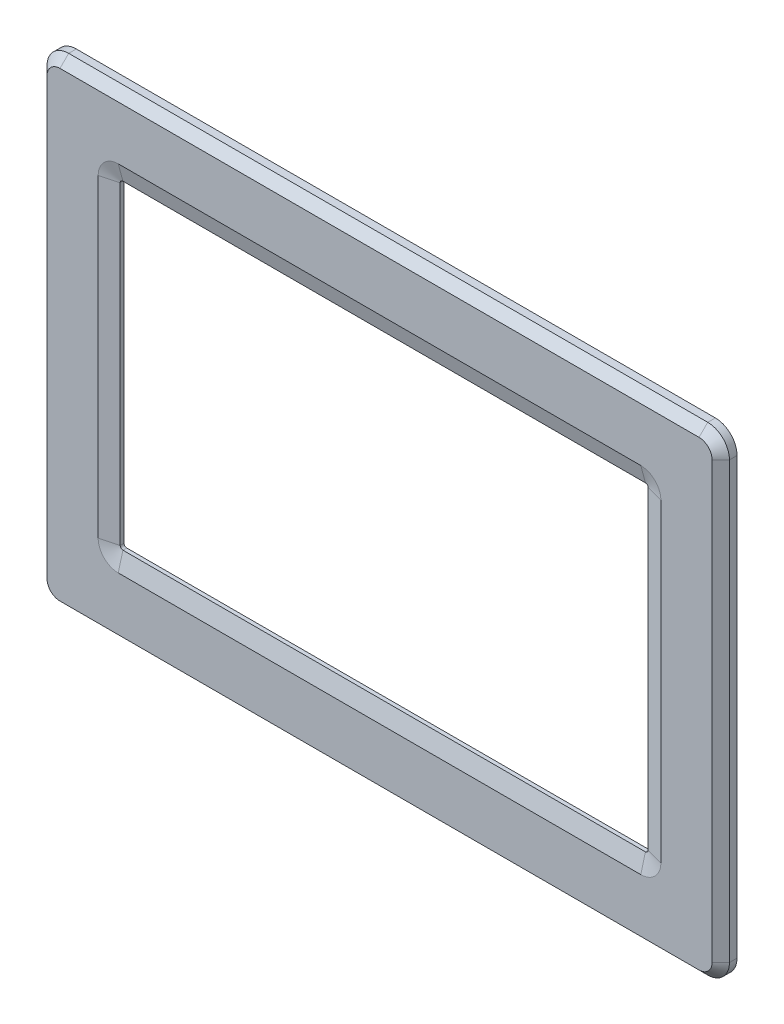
ISO-10303-21;
HEADER;
FILE_DESCRIPTION(('STEP AP214'),'2;1');
FILE_NAME('part.step','',(''),(''),'','','');
FILE_SCHEMA(('AUTOMOTIVE_DESIGN { 1 0 10303 214 1 1 1 1 }'));
ENDSEC;
DATA;
#1=APPLICATION_CONTEXT('core data for automotive mechanical design processes');
#2=APPLICATION_PROTOCOL_DEFINITION('international standard','automotive_design',2000,#1);
#3=PRODUCT_CONTEXT('',#1,'mechanical');
#4=PRODUCT('Part','Part','',(#3));
#5=PRODUCT_RELATED_PRODUCT_CATEGORY('part','',(#4));
#6=PRODUCT_DEFINITION_FORMATION('','',#4);
#7=PRODUCT_DEFINITION_CONTEXT('part definition',#1,'design');
#8=PRODUCT_DEFINITION('design','',#6,#7);
#9=PRODUCT_DEFINITION_SHAPE('','',#8);
#10=(LENGTH_UNIT() NAMED_UNIT(*) SI_UNIT(.MILLI.,.METRE.));
#11=(NAMED_UNIT(*) PLANE_ANGLE_UNIT() SI_UNIT($,.RADIAN.));
#12=(NAMED_UNIT(*) SI_UNIT($,.STERADIAN.) SOLID_ANGLE_UNIT());
#13=UNCERTAINTY_MEASURE_WITH_UNIT(LENGTH_MEASURE(1.E-05),#10,'distance_accuracy_value','');
#14=(GEOMETRIC_REPRESENTATION_CONTEXT(3) GLOBAL_UNCERTAINTY_ASSIGNED_CONTEXT((#13)) GLOBAL_UNIT_ASSIGNED_CONTEXT((#10,
#11,#12)) REPRESENTATION_CONTEXT('',''));
#15=CARTESIAN_POINT('',(0.,0.,0.));
#16=DIRECTION('',(0.,0.,1.));
#17=DIRECTION('',(1.,0.,0.));
#18=AXIS2_PLACEMENT_3D('',#15,#16,#17);
#19=CARTESIAN_POINT('',(76.42098,45.94098,3.4013181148));
#20=DIRECTION('',(0.,0.,1.));
#21=DIRECTION('',(0.,-1.,0.));
#22=AXIS2_PLACEMENT_3D('',#19,#20,#21);
#23=CONICAL_SURFACE('',#22,0.795019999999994,1.30899694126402);
#24=DIRECTION('',(-0.965925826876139,0.,-0.258819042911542));
#25=VECTOR('',#24,1.);
#26=CARTESIAN_POINT('',(79.756,45.94098,4.0819090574));
#27=LINE('',#26,#25);
#28=CARTESIAN_POINT('',(82.296,45.94098,4.7625));
#29=VERTEX_POINT('',#28);
#30=CARTESIAN_POINT('',(77.216,45.94098,3.40131811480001));
#31=VERTEX_POINT('',#30);
#32=EDGE_CURVE('E503',#29,#31,#27,.T.);
#33=ORIENTED_EDGE('',*,*,#32,.F.);
#34=CARTESIAN_POINT('',(76.42098,45.94098,4.7625));
#35=DIRECTION('',(0.,0.,1.));
#36=DIRECTION('',(0.,-1.,0.));
#37=AXIS2_PLACEMENT_3D('',#34,#35,#36);
#38=CIRCLE('',#37,5.87501999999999);
#39=CARTESIAN_POINT('',(76.42098,51.816,4.7625));
#40=VERTEX_POINT('',#39);
#41=EDGE_CURVE('E519',#40,#29,#38,.F.);
#42=ORIENTED_EDGE('',*,*,#41,.F.);
#43=DIRECTION('',(0.,0.965925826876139,0.258819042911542));
#44=VECTOR('',#43,1.);
#45=CARTESIAN_POINT('',(76.42098,49.276,4.0819090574));
#46=LINE('',#45,#44);
#47=CARTESIAN_POINT('',(76.4209799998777,46.736,3.40131811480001));
#48=VERTEX_POINT('',#47);
#49=EDGE_CURVE('E536',#48,#40,#46,.T.);
#50=ORIENTED_EDGE('',*,*,#49,.F.);
#51=CARTESIAN_POINT('',(76.42098,45.94098,3.40131811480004));
#52=DIRECTION('',(0.,0.,1.));
#53=DIRECTION('',(1.,0.,0.));
#54=AXIS2_PLACEMENT_3D('',#51,#52,#53);
#55=CIRCLE('',#54,0.795019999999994);
#56=EDGE_CURVE('E527',#48,#31,#55,.F.);
#57=ORIENTED_EDGE('',*,*,#56,.T.);
#58=EDGE_LOOP('',(#33,#42,#50,#57));
#59=FACE_BOUND('',#58,.T.);
#60=ADVANCED_FACE('F15',(#59),#23,.F.);
#61=CARTESIAN_POINT('',(76.42098,-45.94098,3.4013181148));
#62=DIRECTION('',(0.,0.,1.));
#63=DIRECTION('',(0.,-1.,0.));
#64=AXIS2_PLACEMENT_3D('',#61,#62,#63);
#65=CONICAL_SURFACE('',#64,0.795019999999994,1.30899694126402);
#66=DIRECTION('',(0.,0.965925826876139,-0.258819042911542));
#67=VECTOR('',#66,1.);
#68=CARTESIAN_POINT('',(76.42098,-49.276,4.0819090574));
#69=LINE('',#68,#67);
#70=CARTESIAN_POINT('',(76.42098,-51.816,4.7625));
#71=VERTEX_POINT('',#70);
#72=CARTESIAN_POINT('',(76.4209799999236,-46.736,3.40131811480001));
#73=VERTEX_POINT('',#72);
#74=EDGE_CURVE('E509',#71,#73,#69,.T.);
#75=ORIENTED_EDGE('',*,*,#74,.F.);
#76=CARTESIAN_POINT('',(76.42098,-45.94098,4.7625));
#77=DIRECTION('',(0.,0.,1.));
#78=DIRECTION('',(0.,-1.,0.));
#79=AXIS2_PLACEMENT_3D('',#76,#77,#78);
#80=CIRCLE('',#79,5.87501999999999);
#81=CARTESIAN_POINT('',(82.296,-45.94098,4.7625));
#82=VERTEX_POINT('',#81);
#83=EDGE_CURVE('E19',#82,#71,#80,.F.);
#84=ORIENTED_EDGE('',*,*,#83,.F.);
#85=DIRECTION('',(0.965925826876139,0.,0.258819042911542));
#86=VECTOR('',#85,1.);
#87=CARTESIAN_POINT('',(79.756,-45.94098,4.0819090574));
#88=LINE('',#87,#86);
#89=CARTESIAN_POINT('',(77.216,-45.9409800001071,3.40131811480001));
#90=VERTEX_POINT('',#89);
#91=EDGE_CURVE('E490',#90,#82,#88,.T.);
#92=ORIENTED_EDGE('',*,*,#91,.F.);
#93=CARTESIAN_POINT('',(76.42098,-45.94098,3.40131811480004));
#94=DIRECTION('',(0.,0.,1.));
#95=DIRECTION('',(1.,0.,0.));
#96=AXIS2_PLACEMENT_3D('',#93,#94,#95);
#97=CIRCLE('',#96,0.795019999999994);
#98=EDGE_CURVE('E530',#90,#73,#97,.F.);
#99=ORIENTED_EDGE('',*,*,#98,.T.);
#100=EDGE_LOOP('',(#75,#84,#92,#99));
#101=FACE_BOUND('',#100,.T.);
#102=ADVANCED_FACE('F507',(#101),#65,.F.);
#103=CARTESIAN_POINT('',(-76.42098,45.94098,3.4013181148));
#104=DIRECTION('',(0.,0.,1.));
#105=DIRECTION('',(0.,-1.,0.));
#106=AXIS2_PLACEMENT_3D('',#103,#104,#105);
#107=CONICAL_SURFACE('',#106,0.795020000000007,1.30899694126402);
#108=DIRECTION('',(-0.965925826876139,0.,0.258819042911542));
#109=VECTOR('',#108,1.);
#110=CARTESIAN_POINT('',(-79.756,45.94098,4.0819090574));
#111=LINE('',#110,#109);
#112=CARTESIAN_POINT('',(-77.216,45.9409799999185,3.40131811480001));
#113=VERTEX_POINT('',#112);
#114=CARTESIAN_POINT('',(-82.296,45.94098,4.7625));
#115=VERTEX_POINT('',#114);
#116=EDGE_CURVE('E890',#113,#115,#111,.T.);
#117=ORIENTED_EDGE('',*,*,#116,.F.);
#118=CARTESIAN_POINT('',(-76.42098,45.94098,3.40131811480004));
#119=DIRECTION('',(0.,0.,1.));
#120=DIRECTION('',(1.,0.,0.));
#121=AXIS2_PLACEMENT_3D('',#118,#119,#120);
#122=CIRCLE('',#121,0.795020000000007);
#123=CARTESIAN_POINT('',(-76.4209800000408,46.736,3.40131811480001));
#124=VERTEX_POINT('',#123);
#125=EDGE_CURVE('E951',#113,#124,#122,.F.);
#126=ORIENTED_EDGE('',*,*,#125,.T.);
#127=DIRECTION('',(0.,-0.965925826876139,-0.258819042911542));
#128=VECTOR('',#127,1.);
#129=CARTESIAN_POINT('',(-76.42098,49.276,4.0819090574));
#130=LINE('',#129,#128);
#131=CARTESIAN_POINT('',(-76.42098,51.816,4.7625));
#132=VERTEX_POINT('',#131);
#133=EDGE_CURVE('E535',#132,#124,#130,.T.);
#134=ORIENTED_EDGE('',*,*,#133,.F.);
#135=CARTESIAN_POINT('',(-76.42098,45.94098,4.7625));
#136=DIRECTION('',(0.,0.,1.));
#137=DIRECTION('',(0.,-1.,0.));
#138=AXIS2_PLACEMENT_3D('',#135,#136,#137);
#139=CIRCLE('',#138,5.87502000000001);
#140=EDGE_CURVE('E875',#115,#132,#139,.F.);
#141=ORIENTED_EDGE('',*,*,#140,.F.);
#142=EDGE_LOOP('',(#117,#126,#134,#141));
#143=FACE_BOUND('',#142,.T.);
#144=ADVANCED_FACE('F1415',(#143),#107,.F.);
#145=CARTESIAN_POINT('',(-76.42098,-45.94098,3.4013181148));
#146=DIRECTION('',(0.,0.,1.));
#147=DIRECTION('',(0.,-1.,0.));
#148=AXIS2_PLACEMENT_3D('',#145,#146,#147);
#149=CONICAL_SURFACE('',#148,0.795020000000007,1.30899694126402);
#150=DIRECTION('',(0.,-0.965925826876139,0.258819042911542));
#151=VECTOR('',#150,1.);
#152=CARTESIAN_POINT('',(-76.42098,-49.276,4.0819090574));
#153=LINE('',#152,#151);
#154=CARTESIAN_POINT('',(-76.4209800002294,-46.736,3.40131811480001));
#155=VERTEX_POINT('',#154);
#156=CARTESIAN_POINT('',(-76.42098,-51.816,4.7625));
#157=VERTEX_POINT('',#156);
#158=EDGE_CURVE('E520',#155,#157,#153,.T.);
#159=ORIENTED_EDGE('',*,*,#158,.F.);
#160=CARTESIAN_POINT('',(-76.42098,-45.94098,3.40131811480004));
#161=DIRECTION('',(0.,0.,1.));
#162=DIRECTION('',(1.,0.,0.));
#163=AXIS2_PLACEMENT_3D('',#160,#161,#162);
#164=CIRCLE('',#163,0.795020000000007);
#165=CARTESIAN_POINT('',(-77.216,-45.9409800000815,3.40131811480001));
#166=VERTEX_POINT('',#165);
#167=EDGE_CURVE('E514',#155,#166,#164,.F.);
#168=ORIENTED_EDGE('',*,*,#167,.T.);
#169=DIRECTION('',(0.965925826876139,0.,-0.258819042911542));
#170=VECTOR('',#169,1.);
#171=CARTESIAN_POINT('',(-79.756,-45.94098,4.0819090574));
#172=LINE('',#171,#170);
#173=CARTESIAN_POINT('',(-82.296,-45.94098,4.7625));
#174=VERTEX_POINT('',#173);
#175=EDGE_CURVE('E873',#174,#166,#172,.T.);
#176=ORIENTED_EDGE('',*,*,#175,.F.);
#177=CARTESIAN_POINT('',(-76.42098,-45.94098,4.7625));
#178=DIRECTION('',(0.,0.,1.));
#179=DIRECTION('',(0.,-1.,0.));
#180=AXIS2_PLACEMENT_3D('',#177,#178,#179);
#181=CIRCLE('',#180,5.87502000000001);
#182=EDGE_CURVE('E513',#157,#174,#181,.F.);
#183=ORIENTED_EDGE('',*,*,#182,.F.);
#184=EDGE_LOOP('',(#159,#168,#176,#183));
#185=FACE_BOUND('',#184,.T.);
#186=ADVANCED_FACE('F894',(#185),#149,.F.);
#187=CARTESIAN_POINT('',(-97.2699999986,-67.4700000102,4.7625));
#188=DIRECTION('',(0.,0.,1.));
#189=DIRECTION('',(1.,0.,0.));
#190=AXIS2_PLACEMENT_3D('',#187,#188,#189);
#191=PLANE('',#190);
#192=ORIENTED_EDGE('',*,*,#41,.T.);
#193=DIRECTION('',(0.,1.,0.));
#194=VECTOR('',#193,1.);
#195=CARTESIAN_POINT('',(82.296,0.,4.7625));
#196=LINE('',#195,#194);
#197=EDGE_CURVE('E495',#82,#29,#196,.T.);
#198=ORIENTED_EDGE('',*,*,#197,.F.);
#199=ORIENTED_EDGE('',*,*,#83,.T.);
#200=DIRECTION('',(1.,0.,0.));
#201=VECTOR('',#200,1.);
#202=CARTESIAN_POINT('',(0.,-51.816,4.7625));
#203=LINE('',#202,#201);
#204=EDGE_CURVE('E522',#157,#71,#203,.T.);
#205=ORIENTED_EDGE('',*,*,#204,.F.);
#206=ORIENTED_EDGE('',*,*,#182,.T.);
#207=DIRECTION('',(0.,-1.,0.));
#208=VECTOR('',#207,1.);
#209=CARTESIAN_POINT('',(-82.296,0.,4.7625));
#210=LINE('',#209,#208);
#211=EDGE_CURVE('E879',#115,#174,#210,.T.);
#212=ORIENTED_EDGE('',*,*,#211,.F.);
#213=ORIENTED_EDGE('',*,*,#140,.T.);
#214=DIRECTION('',(-1.,0.,0.));
#215=VECTOR('',#214,1.);
#216=CARTESIAN_POINT('',(0.,51.816,4.7625));
#217=LINE('',#216,#215);
#218=EDGE_CURVE('E533',#40,#132,#217,.T.);
#219=ORIENTED_EDGE('',*,*,#218,.F.);
#220=EDGE_LOOP('',(#192,#198,#199,#205,#206,#212,#213,#219));
#221=FACE_BOUND('',#220,.T.);
#222=CARTESIAN_POINT('',(-93.4599999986,63.6600000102,4.7625));
#223=DIRECTION('',(0.,0.,-1.));
#224=DIRECTION('',(-1.,0.,0.));
#225=AXIS2_PLACEMENT_3D('',#222,#223,#224);
#226=CIRCLE('',#225,3.81000000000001);
#227=CARTESIAN_POINT('',(-93.4599999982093,67.4700000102,4.7625));
#228=VERTEX_POINT('',#227);
#229=CARTESIAN_POINT('',(-97.2699999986,63.6600000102,4.7625));
#230=VERTEX_POINT('',#229);
#231=EDGE_CURVE('E861',#228,#230,#226,.F.);
#232=ORIENTED_EDGE('',*,*,#231,.T.);
#233=DIRECTION('',(0.,1.,0.));
#234=VECTOR('',#233,1.);
#235=CARTESIAN_POINT('',(-97.2699999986,0.,4.7625));
#236=LINE('',#235,#234);
#237=CARTESIAN_POINT('',(-97.2699999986,-63.6600000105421,4.7625));
#238=VERTEX_POINT('',#237);
#239=EDGE_CURVE('E860',#238,#230,#236,.T.);
#240=ORIENTED_EDGE('',*,*,#239,.F.);
#241=CARTESIAN_POINT('',(-93.4599999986,-63.6600000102,4.7625));
#242=DIRECTION('',(0.,0.,-1.));
#243=DIRECTION('',(-1.,0.,0.));
#244=AXIS2_PLACEMENT_3D('',#241,#242,#243);
#245=CIRCLE('',#244,3.81000000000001);
#246=CARTESIAN_POINT('',(-93.4599999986,-67.4700000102,4.7625));
#247=VERTEX_POINT('',#246);
#248=EDGE_CURVE('E857',#238,#247,#245,.F.);
#249=ORIENTED_EDGE('',*,*,#248,.T.);
#250=DIRECTION('',(-1.,0.,0.));
#251=VECTOR('',#250,1.);
#252=CARTESIAN_POINT('',(0.,-67.4700000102,4.7625));
#253=LINE('',#252,#251);
#254=CARTESIAN_POINT('',(93.4599999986,-67.4700000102,4.7625));
#255=VERTEX_POINT('',#254);
#256=EDGE_CURVE('E939',#255,#247,#253,.T.);
#257=ORIENTED_EDGE('',*,*,#256,.F.);
#258=CARTESIAN_POINT('',(93.4599999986,-63.6600000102,4.7625));
#259=DIRECTION('',(0.,0.,-1.));
#260=DIRECTION('',(-1.,0.,0.));
#261=AXIS2_PLACEMENT_3D('',#258,#259,#260);
#262=CIRCLE('',#261,3.80999999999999);
#263=CARTESIAN_POINT('',(97.2699999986,-63.6600000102,4.7625));
#264=VERTEX_POINT('',#263);
#265=EDGE_CURVE('E869',#255,#264,#262,.F.);
#266=ORIENTED_EDGE('',*,*,#265,.T.);
#267=DIRECTION('',(0.,-1.,0.));
#268=VECTOR('',#267,1.);
#269=CARTESIAN_POINT('',(97.2699999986,0.,4.7625));
#270=LINE('',#269,#268);
#271=CARTESIAN_POINT('',(97.2699999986,63.6600000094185,4.7625));
#272=VERTEX_POINT('',#271);
#273=EDGE_CURVE('E872',#272,#264,#270,.T.);
#274=ORIENTED_EDGE('',*,*,#273,.F.);
#275=CARTESIAN_POINT('',(93.4599999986,63.6600000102,4.7625));
#276=DIRECTION('',(0.,0.,-1.));
#277=DIRECTION('',(-1.,0.,0.));
#278=AXIS2_PLACEMENT_3D('',#275,#276,#277);
#279=CIRCLE('',#278,3.80999999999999);
#280=CARTESIAN_POINT('',(93.4599999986,67.4700000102,4.7625));
#281=VERTEX_POINT('',#280);
#282=EDGE_CURVE('E865',#272,#281,#279,.F.);
#283=ORIENTED_EDGE('',*,*,#282,.T.);
#284=DIRECTION('',(1.,0.,0.));
#285=VECTOR('',#284,1.);
#286=CARTESIAN_POINT('',(0.,67.4700000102,4.7625));
#287=LINE('',#286,#285);
#288=EDGE_CURVE('E864',#228,#281,#287,.T.);
#289=ORIENTED_EDGE('',*,*,#288,.F.);
#290=EDGE_LOOP('',(#232,#240,#249,#257,#266,#274,#283,#289));
#291=FACE_BOUND('',#290,.T.);
#292=ADVANCED_FACE('F515',(#221,#291),#191,.T.);
#293=CARTESIAN_POINT('',(-76.42098,51.816,4.7625));
#294=DIRECTION('',(0.,-0.258819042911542,0.965925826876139));
#295=DIRECTION('',(0.,-0.965925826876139,-0.258819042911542));
#296=AXIS2_PLACEMENT_3D('',#293,#294,#295);
#297=PLANE('',#296);
#298=ORIENTED_EDGE('',*,*,#133,.T.);
#299=DIRECTION('',(1.,0.,0.));
#300=VECTOR('',#299,1.);
#301=CARTESIAN_POINT('',(0.,46.736,3.4013181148));
#302=LINE('',#301,#300);
#303=EDGE_CURVE('E925',#124,#48,#302,.T.);
#304=ORIENTED_EDGE('',*,*,#303,.T.);
#305=ORIENTED_EDGE('',*,*,#49,.T.);
#306=ORIENTED_EDGE('',*,*,#218,.T.);
#307=EDGE_LOOP('',(#298,#304,#305,#306));
#308=FACE_BOUND('',#307,.T.);
#309=ADVANCED_FACE('F1407',(#308),#297,.T.);
#310=CARTESIAN_POINT('',(77.216,-45.94098,3.4013181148));
#311=DIRECTION('',(-0.258819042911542,0.,0.965925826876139));
#312=DIRECTION('',(0.965925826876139,0.,0.258819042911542));
#313=AXIS2_PLACEMENT_3D('',#310,#311,#312);
#314=PLANE('',#313);
#315=ORIENTED_EDGE('',*,*,#91,.T.);
#316=ORIENTED_EDGE('',*,*,#197,.T.);
#317=ORIENTED_EDGE('',*,*,#32,.T.);
#318=DIRECTION('',(0.,-1.,0.));
#319=VECTOR('',#318,1.);
#320=CARTESIAN_POINT('',(77.216,0.,3.4013181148));
#321=LINE('',#320,#319);
#322=EDGE_CURVE('E499',#31,#90,#321,.T.);
#323=ORIENTED_EDGE('',*,*,#322,.T.);
#324=EDGE_LOOP('',(#315,#316,#317,#323));
#325=FACE_BOUND('',#324,.T.);
#326=ADVANCED_FACE('F492',(#325),#314,.T.);
#327=CARTESIAN_POINT('',(-76.42098,-46.736,3.4013181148));
#328=DIRECTION('',(0.,0.258819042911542,0.965925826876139));
#329=DIRECTION('',(0.,-0.965925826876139,0.258819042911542));
#330=AXIS2_PLACEMENT_3D('',#327,#328,#329);
#331=PLANE('',#330);
#332=ORIENTED_EDGE('',*,*,#74,.T.);
#333=DIRECTION('',(-1.,0.,0.));
#334=VECTOR('',#333,1.);
#335=CARTESIAN_POINT('',(0.,-46.736,3.4013181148));
#336=LINE('',#335,#334);
#337=EDGE_CURVE('E903',#73,#155,#336,.T.);
#338=ORIENTED_EDGE('',*,*,#337,.T.);
#339=ORIENTED_EDGE('',*,*,#158,.T.);
#340=ORIENTED_EDGE('',*,*,#204,.T.);
#341=EDGE_LOOP('',(#332,#338,#339,#340));
#342=FACE_BOUND('',#341,.T.);
#343=ADVANCED_FACE('F967',(#342),#331,.T.);
#344=CARTESIAN_POINT('',(-82.296,-45.94098,4.7625));
#345=DIRECTION('',(0.258819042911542,0.,0.965925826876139));
#346=DIRECTION('',(0.965925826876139,0.,-0.258819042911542));
#347=AXIS2_PLACEMENT_3D('',#344,#345,#346);
#348=PLANE('',#347);
#349=ORIENTED_EDGE('',*,*,#175,.T.);
#350=DIRECTION('',(0.,1.,0.));
#351=VECTOR('',#350,1.);
#352=CARTESIAN_POINT('',(-77.216,0.,3.4013181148));
#353=LINE('',#352,#351);
#354=EDGE_CURVE('E1077',#166,#113,#353,.T.);
#355=ORIENTED_EDGE('',*,*,#354,.T.);
#356=ORIENTED_EDGE('',*,*,#116,.T.);
#357=ORIENTED_EDGE('',*,*,#211,.T.);
#358=EDGE_LOOP('',(#349,#355,#356,#357));
#359=FACE_BOUND('',#358,.T.);
#360=ADVANCED_FACE('F885',(#359),#348,.T.);
#361=CARTESIAN_POINT('',(93.4599999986,-63.6600000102,4.7625));
#362=DIRECTION('',(0.,0.,-1.));
#363=DIRECTION('',(-1.,0.,0.));
#364=AXIS2_PLACEMENT_3D('',#361,#362,#363);
#365=CONICAL_SURFACE('',#364,3.80999999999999,0.785398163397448);
#366=ORIENTED_EDGE('',*,*,#265,.F.);
#367=DIRECTION('',(0.,0.707106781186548,0.707106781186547));
#368=VECTOR('',#367,1.);
#369=CARTESIAN_POINT('',(93.4599999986,-68.7400000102,3.4925));
#370=LINE('',#369,#368);
#371=CARTESIAN_POINT('',(93.4599999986,-70.0100000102,2.2225));
#372=VERTEX_POINT('',#371);
#373=EDGE_CURVE('E942',#372,#255,#370,.T.);
#374=ORIENTED_EDGE('',*,*,#373,.F.);
#375=CARTESIAN_POINT('',(93.4599999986,-63.6600000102,2.2225));
#376=DIRECTION('',(0.,0.,-1.));
#377=DIRECTION('',(-1.,0.,0.));
#378=AXIS2_PLACEMENT_3D('',#375,#376,#377);
#379=CIRCLE('',#378,6.34999999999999);
#380=CARTESIAN_POINT('',(99.8099999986,-63.6600000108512,2.2225));
#381=VERTEX_POINT('',#380);
#382=EDGE_CURVE('E996',#372,#381,#379,.F.);
#383=ORIENTED_EDGE('',*,*,#382,.T.);
#384=DIRECTION('',(0.707106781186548,0.,-0.707106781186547));
#385=VECTOR('',#384,1.);
#386=CARTESIAN_POINT('',(98.5399999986,-63.6600000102,3.4925));
#387=LINE('',#386,#385);
#388=EDGE_CURVE('E949',#264,#381,#387,.T.);
#389=ORIENTED_EDGE('',*,*,#388,.F.);
#390=EDGE_LOOP('',(#366,#374,#383,#389));
#391=FACE_BOUND('',#390,.T.);
#392=ADVANCED_FACE('F1449',(#391),#365,.T.);
#393=CARTESIAN_POINT('',(97.2699999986,-63.6600000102,4.7625));
#394=DIRECTION('',(0.707106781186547,0.,0.707106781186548));
#395=DIRECTION('',(0.707106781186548,0.,-0.707106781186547));
#396=AXIS2_PLACEMENT_3D('',#393,#394,#395);
#397=PLANE('',#396);
#398=ORIENTED_EDGE('',*,*,#388,.T.);
#399=DIRECTION('',(0.,1.,0.));
#400=VECTOR('',#399,1.);
#401=CARTESIAN_POINT('',(99.8099999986,0.,2.2225));
#402=LINE('',#401,#400);
#403=CARTESIAN_POINT('',(99.8099999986,63.6600000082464,2.2225));
#404=VERTEX_POINT('',#403);
#405=EDGE_CURVE('E1068',#381,#404,#402,.T.);
#406=ORIENTED_EDGE('',*,*,#405,.T.);
#407=DIRECTION('',(0.707106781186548,-2.90057582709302E-10,-0.707106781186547));
#408=VECTOR('',#407,1.);
#409=CARTESIAN_POINT('',(98.5399999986,63.6600000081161,3.4925));
#410=LINE('',#409,#408);
#411=EDGE_CURVE('E868',#404,#272,#410,.F.);
#412=ORIENTED_EDGE('',*,*,#411,.T.);
#413=ORIENTED_EDGE('',*,*,#273,.T.);
#414=EDGE_LOOP('',(#398,#406,#412,#413));
#415=FACE_BOUND('',#414,.T.);
#416=ADVANCED_FACE('F1450',(#415),#397,.T.);
#417=CARTESIAN_POINT('',(93.4599999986,63.6600000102,4.7625));
#418=DIRECTION('',(0.,0.,-1.));
#419=DIRECTION('',(-1.,0.,0.));
#420=AXIS2_PLACEMENT_3D('',#417,#418,#419);
#421=CONICAL_SURFACE('',#420,3.80999999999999,0.785398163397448);
#422=ORIENTED_EDGE('',*,*,#282,.F.);
#423=ORIENTED_EDGE('',*,*,#411,.F.);
#424=CARTESIAN_POINT('',(93.4599999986,63.6600000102,2.2225));
#425=DIRECTION('',(0.,0.,-1.));
#426=DIRECTION('',(-1.,0.,0.));
#427=AXIS2_PLACEMENT_3D('',#424,#425,#426);
#428=CIRCLE('',#427,6.34999999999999);
#429=CARTESIAN_POINT('',(93.4599999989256,70.0100000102,2.2225));
#430=VERTEX_POINT('',#429);
#431=EDGE_CURVE('E1058',#404,#430,#428,.F.);
#432=ORIENTED_EDGE('',*,*,#431,.T.);
#433=DIRECTION('',(0.,0.707106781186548,-0.707106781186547));
#434=VECTOR('',#433,1.);
#435=CARTESIAN_POINT('',(93.4599999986,68.7400000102,3.4925));
#436=LINE('',#435,#434);
#437=EDGE_CURVE('E867',#281,#430,#436,.T.);
#438=ORIENTED_EDGE('',*,*,#437,.F.);
#439=EDGE_LOOP('',(#422,#423,#432,#438));
#440=FACE_BOUND('',#439,.T.);
#441=ADVANCED_FACE('F1453',(#440),#421,.T.);
#442=CARTESIAN_POINT('',(-93.4599999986,70.0100000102,2.2225));
#443=DIRECTION('',(0.,0.707106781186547,0.707106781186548));
#444=DIRECTION('',(0.,-0.707106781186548,0.707106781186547));
#445=AXIS2_PLACEMENT_3D('',#442,#443,#444);
#446=PLANE('',#445);
#447=DIRECTION('',(1.45028791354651E-10,0.707106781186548,-0.707106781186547));
#448=VECTOR('',#447,1.);
#449=CARTESIAN_POINT('',(-93.4599999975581,68.7400000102,3.4925));
#450=LINE('',#449,#448);
#451=CARTESIAN_POINT('',(-93.4599999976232,70.0100000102,2.2225));
#452=VERTEX_POINT('',#451);
#453=EDGE_CURVE('E863',#452,#228,#450,.F.);
#454=ORIENTED_EDGE('',*,*,#453,.T.);
#455=ORIENTED_EDGE('',*,*,#288,.T.);
#456=ORIENTED_EDGE('',*,*,#437,.T.);
#457=DIRECTION('',(-1.,0.,0.));
#458=VECTOR('',#457,1.);
#459=CARTESIAN_POINT('',(0.,70.0100000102,2.2225));
#460=LINE('',#459,#458);
#461=EDGE_CURVE('E1048',#430,#452,#460,.T.);
#462=ORIENTED_EDGE('',*,*,#461,.T.);
#463=EDGE_LOOP('',(#454,#455,#456,#462));
#464=FACE_BOUND('',#463,.T.);
#465=ADVANCED_FACE('F1455',(#464),#446,.T.);
#466=CARTESIAN_POINT('',(-93.4599999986,63.6600000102,4.7625));
#467=DIRECTION('',(0.,0.,-1.));
#468=DIRECTION('',(-1.,0.,0.));
#469=AXIS2_PLACEMENT_3D('',#466,#467,#468);
#470=CONICAL_SURFACE('',#469,3.81000000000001,0.785398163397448);
#471=CARTESIAN_POINT('',(-93.4599999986,63.6600000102,2.2225));
#472=DIRECTION('',(0.,0.,-1.));
#473=DIRECTION('',(-1.,0.,0.));
#474=AXIS2_PLACEMENT_3D('',#471,#472,#473);
#475=CIRCLE('',#474,6.35000000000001);
#476=CARTESIAN_POINT('',(-99.8099999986,63.6600000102,2.2225));
#477=VERTEX_POINT('',#476);
#478=EDGE_CURVE('E1038',#452,#477,#475,.F.);
#479=ORIENTED_EDGE('',*,*,#478,.T.);
#480=DIRECTION('',(-0.707106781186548,0.,-0.707106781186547));
#481=VECTOR('',#480,1.);
#482=CARTESIAN_POINT('',(-98.5399999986,63.6600000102,3.4925));
#483=LINE('',#482,#481);
#484=EDGE_CURVE('E945',#230,#477,#483,.T.);
#485=ORIENTED_EDGE('',*,*,#484,.F.);
#486=ORIENTED_EDGE('',*,*,#231,.F.);
#487=ORIENTED_EDGE('',*,*,#453,.F.);
#488=EDGE_LOOP('',(#479,#485,#486,#487));
#489=FACE_BOUND('',#488,.T.);
#490=ADVANCED_FACE('F1458',(#489),#470,.T.);
#491=CARTESIAN_POINT('',(-99.8099999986,-63.6600000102,2.2225));
#492=DIRECTION('',(-0.707106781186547,0.,0.707106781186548));
#493=DIRECTION('',(0.707106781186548,0.,0.707106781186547));
#494=AXIS2_PLACEMENT_3D('',#491,#492,#493);
#495=PLANE('',#494);
#496=DIRECTION('',(-0.707106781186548,-1.26986636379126E-10,-0.707106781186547));
#497=VECTOR('',#496,1.);
#498=CARTESIAN_POINT('',(-98.5399999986,-63.6600000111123,3.4925));
#499=LINE('',#498,#497);
#500=CARTESIAN_POINT('',(-99.8099999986,-63.6600000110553,2.2225));
#501=VERTEX_POINT('',#500);
#502=EDGE_CURVE('E859',#501,#238,#499,.F.);
#503=ORIENTED_EDGE('',*,*,#502,.T.);
#504=ORIENTED_EDGE('',*,*,#239,.T.);
#505=ORIENTED_EDGE('',*,*,#484,.T.);
#506=DIRECTION('',(0.,-1.,0.));
#507=VECTOR('',#506,1.);
#508=CARTESIAN_POINT('',(-99.8099999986,0.,2.2225));
#509=LINE('',#508,#507);
#510=EDGE_CURVE('E1028',#477,#501,#509,.T.);
#511=ORIENTED_EDGE('',*,*,#510,.T.);
#512=EDGE_LOOP('',(#503,#504,#505,#511));
#513=FACE_BOUND('',#512,.T.);
#514=ADVANCED_FACE('F1460',(#513),#495,.T.);
#515=CARTESIAN_POINT('',(-93.4599999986,-63.6600000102,4.7625));
#516=DIRECTION('',(0.,0.,-1.));
#517=DIRECTION('',(-1.,0.,0.));
#518=AXIS2_PLACEMENT_3D('',#515,#516,#517);
#519=CONICAL_SURFACE('',#518,3.81000000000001,0.785398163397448);
#520=CARTESIAN_POINT('',(-93.4599999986,-63.6600000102,2.2225));
#521=DIRECTION('',(0.,0.,-1.));
#522=DIRECTION('',(-1.,0.,0.));
#523=AXIS2_PLACEMENT_3D('',#520,#521,#522);
#524=CIRCLE('',#523,6.35000000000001);
#525=CARTESIAN_POINT('',(-93.4599999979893,-70.0100000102,2.2225));
#526=VERTEX_POINT('',#525);
#527=EDGE_CURVE('E1018',#501,#526,#524,.F.);
#528=ORIENTED_EDGE('',*,*,#527,.T.);
#529=DIRECTION('',(0.,-0.707106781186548,-0.707106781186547));
#530=VECTOR('',#529,1.);
#531=CARTESIAN_POINT('',(-93.4599999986,-68.7400000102,3.4925));
#532=LINE('',#531,#530);
#533=EDGE_CURVE('E1011',#247,#526,#532,.T.);
#534=ORIENTED_EDGE('',*,*,#533,.F.);
#535=ORIENTED_EDGE('',*,*,#248,.F.);
#536=ORIENTED_EDGE('',*,*,#502,.F.);
#537=EDGE_LOOP('',(#528,#534,#535,#536));
#538=FACE_BOUND('',#537,.T.);
#539=ADVANCED_FACE('F1463',(#538),#519,.T.);
#540=CARTESIAN_POINT('',(-93.4599999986,-67.4700000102,4.7625));
#541=DIRECTION('',(0.,-0.707106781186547,0.707106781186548));
#542=DIRECTION('',(0.,-0.707106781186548,-0.707106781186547));
#543=AXIS2_PLACEMENT_3D('',#540,#541,#542);
#544=PLANE('',#543);
#545=ORIENTED_EDGE('',*,*,#373,.T.);
#546=ORIENTED_EDGE('',*,*,#256,.T.);
#547=ORIENTED_EDGE('',*,*,#533,.T.);
#548=DIRECTION('',(1.,0.,0.));
#549=VECTOR('',#548,1.);
#550=CARTESIAN_POINT('',(0.,-70.0100000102,2.2225));
#551=LINE('',#550,#549);
#552=EDGE_CURVE('E1003',#526,#372,#551,.T.);
#553=ORIENTED_EDGE('',*,*,#552,.T.);
#554=EDGE_LOOP('',(#545,#546,#547,#553));
#555=FACE_BOUND('',#554,.T.);
#556=ADVANCED_FACE('F1465',(#555),#544,.T.);
#557=CARTESIAN_POINT('',(-76.42098,45.94098,2.286));
#558=DIRECTION('',(0.,0.,1.));
#559=DIRECTION('',(1.,0.,0.));
#560=AXIS2_PLACEMENT_3D('',#557,#558,#559);
#561=CYLINDRICAL_SURFACE('',#560,0.795020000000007);
#562=DIRECTION('',(0.,0.,-1.));
#563=VECTOR('',#562,1.);
#564=CARTESIAN_POINT('',(-77.216,45.94098,2.8436590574));
#565=LINE('',#564,#563);
#566=CARTESIAN_POINT('',(-77.215999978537,45.94098,2.286));
#567=VERTEX_POINT('',#566);
#568=EDGE_CURVE('E1000',#113,#567,#565,.T.);
#569=ORIENTED_EDGE('',*,*,#568,.T.);
#570=CARTESIAN_POINT('',(-76.42098,45.94098,2.286));
#571=DIRECTION('',(0.,0.,1.));
#572=DIRECTION('',(1.,0.,0.));
#573=AXIS2_PLACEMENT_3D('',#570,#571,#572);
#574=CIRCLE('',#573,0.795020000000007);
#575=CARTESIAN_POINT('',(-76.42098,46.736000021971,2.286));
#576=VERTEX_POINT('',#575);
#577=EDGE_CURVE('E853',#567,#576,#574,.F.);
#578=ORIENTED_EDGE('',*,*,#577,.T.);
#579=DIRECTION('',(0.,0.,1.));
#580=VECTOR('',#579,1.);
#581=CARTESIAN_POINT('',(-76.42098,46.736,2.8436590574));
#582=LINE('',#581,#580);
#583=EDGE_CURVE('E929',#576,#124,#582,.T.);
#584=ORIENTED_EDGE('',*,*,#583,.T.);
#585=ORIENTED_EDGE('',*,*,#125,.F.);
#586=EDGE_LOOP('',(#569,#578,#584,#585));
#587=FACE_BOUND('',#586,.T.);
#588=ADVANCED_FACE('F1413',(#587),#561,.F.);
#589=CARTESIAN_POINT('',(-76.42098,46.736,2.286));
#590=DIRECTION('',(0.,1.,0.));
#591=DIRECTION('',(0.,0.,1.));
#592=AXIS2_PLACEMENT_3D('',#589,#590,#591);
#593=PLANE('',#592);
#594=ORIENTED_EDGE('',*,*,#303,.F.);
#595=ORIENTED_EDGE('',*,*,#583,.F.);
#596=DIRECTION('',(1.,0.,0.));
#597=VECTOR('',#596,1.);
#598=CARTESIAN_POINT('',(0.,46.736000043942,2.286));
#599=LINE('',#598,#597);
#600=CARTESIAN_POINT('',(76.4209799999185,46.736000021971,2.286));
#601=VERTEX_POINT('',#600);
#602=EDGE_CURVE('E852',#576,#601,#599,.T.);
#603=ORIENTED_EDGE('',*,*,#602,.T.);
#604=DIRECTION('',(0.,0.,1.));
#605=VECTOR('',#604,1.);
#606=CARTESIAN_POINT('',(76.420979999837,46.736,2.8436590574));
#607=LINE('',#606,#605);
#608=EDGE_CURVE('E928',#48,#601,#607,.F.);
#609=ORIENTED_EDGE('',*,*,#608,.F.);
#610=EDGE_LOOP('',(#594,#595,#603,#609));
#611=FACE_BOUND('',#610,.T.);
#612=ADVANCED_FACE('F1410',(#611),#593,.F.);
#613=CARTESIAN_POINT('',(76.42098,45.94098,2.286));
#614=DIRECTION('',(0.,0.,1.));
#615=DIRECTION('',(1.,0.,0.));
#616=AXIS2_PLACEMENT_3D('',#613,#614,#615);
#617=CYLINDRICAL_SURFACE('',#616,0.795019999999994);
#618=ORIENTED_EDGE('',*,*,#608,.T.);
#619=CARTESIAN_POINT('',(76.42098,45.94098,2.286));
#620=DIRECTION('',(0.,0.,1.));
#621=DIRECTION('',(1.,0.,0.));
#622=AXIS2_PLACEMENT_3D('',#619,#620,#621);
#623=CIRCLE('',#622,0.795019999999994);
#624=CARTESIAN_POINT('',(77.215999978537,45.94098,2.286));
#625=VERTEX_POINT('',#624);
#626=EDGE_CURVE('E849',#601,#625,#623,.F.);
#627=ORIENTED_EDGE('',*,*,#626,.T.);
#628=DIRECTION('',(0.,0.,1.));
#629=VECTOR('',#628,1.);
#630=CARTESIAN_POINT('',(77.216,45.94098,2.8436590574));
#631=LINE('',#630,#629);
#632=EDGE_CURVE('E917',#625,#31,#631,.T.);
#633=ORIENTED_EDGE('',*,*,#632,.T.);
#634=ORIENTED_EDGE('',*,*,#56,.F.);
#635=EDGE_LOOP('',(#618,#627,#633,#634));
#636=FACE_BOUND('',#635,.T.);
#637=ADVANCED_FACE('F1401',(#636),#617,.F.);
#638=CARTESIAN_POINT('',(77.216,-45.94098,3.4013181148));
#639=DIRECTION('',(1.,0.,0.));
#640=DIRECTION('',(0.,0.,-1.));
#641=AXIS2_PLACEMENT_3D('',#638,#639,#640);
#642=PLANE('',#641);
#643=ORIENTED_EDGE('',*,*,#322,.F.);
#644=ORIENTED_EDGE('',*,*,#632,.F.);
#645=DIRECTION('',(0.,-1.,0.));
#646=VECTOR('',#645,1.);
#647=CARTESIAN_POINT('',(77.215999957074,0.,2.286));
#648=LINE('',#647,#646);
#649=CARTESIAN_POINT('',(77.215999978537,-45.9409800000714,2.286));
#650=VERTEX_POINT('',#649);
#651=EDGE_CURVE('E848',#625,#650,#648,.T.);
#652=ORIENTED_EDGE('',*,*,#651,.T.);
#653=DIRECTION('',(0.,0.,1.));
#654=VECTOR('',#653,1.);
#655=CARTESIAN_POINT('',(77.216,-45.9409800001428,2.8436590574));
#656=LINE('',#655,#654);
#657=EDGE_CURVE('E916',#90,#650,#656,.F.);
#658=ORIENTED_EDGE('',*,*,#657,.F.);
#659=EDGE_LOOP('',(#643,#644,#652,#658));
#660=FACE_BOUND('',#659,.T.);
#661=ADVANCED_FACE('F1471',(#660),#642,.F.);
#662=CARTESIAN_POINT('',(76.42098,-45.94098,2.286));
#663=DIRECTION('',(0.,0.,1.));
#664=DIRECTION('',(1.,0.,0.));
#665=AXIS2_PLACEMENT_3D('',#662,#663,#664);
#666=CYLINDRICAL_SURFACE('',#665,0.795019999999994);
#667=ORIENTED_EDGE('',*,*,#657,.T.);
#668=CARTESIAN_POINT('',(76.42098,-45.94098,2.286));
#669=DIRECTION('',(0.,0.,1.));
#670=DIRECTION('',(1.,0.,0.));
#671=AXIS2_PLACEMENT_3D('',#668,#669,#670);
#672=CIRCLE('',#671,0.795019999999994);
#673=CARTESIAN_POINT('',(76.42098,-46.736000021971,2.286));
#674=VERTEX_POINT('',#673);
#675=EDGE_CURVE('E845',#650,#674,#672,.F.);
#676=ORIENTED_EDGE('',*,*,#675,.T.);
#677=DIRECTION('',(0.,0.,1.));
#678=VECTOR('',#677,1.);
#679=CARTESIAN_POINT('',(76.42098,-46.736,2.8436590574));
#680=LINE('',#679,#678);
#681=EDGE_CURVE('E907',#674,#73,#680,.T.);
#682=ORIENTED_EDGE('',*,*,#681,.T.);
#683=ORIENTED_EDGE('',*,*,#98,.F.);
#684=EDGE_LOOP('',(#667,#676,#682,#683));
#685=FACE_BOUND('',#684,.T.);
#686=ADVANCED_FACE('F973',(#685),#666,.F.);
#687=CARTESIAN_POINT('',(-76.42098,-46.736,3.4013181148));
#688=DIRECTION('',(0.,-1.,0.));
#689=DIRECTION('',(0.,0.,-1.));
#690=AXIS2_PLACEMENT_3D('',#687,#688,#689);
#691=PLANE('',#690);
#692=ORIENTED_EDGE('',*,*,#337,.F.);
#693=ORIENTED_EDGE('',*,*,#681,.F.);
#694=DIRECTION('',(-1.,0.,0.));
#695=VECTOR('',#694,1.);
#696=CARTESIAN_POINT('',(0.,-46.736000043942,2.286));
#697=LINE('',#696,#695);
#698=CARTESIAN_POINT('',(-76.4209800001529,-46.736000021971,2.286));
#699=VERTEX_POINT('',#698);
#700=EDGE_CURVE('E844',#674,#699,#697,.T.);
#701=ORIENTED_EDGE('',*,*,#700,.T.);
#702=DIRECTION('',(0.,0.,1.));
#703=VECTOR('',#702,1.);
#704=CARTESIAN_POINT('',(-76.4209800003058,-46.736,2.8436590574));
#705=LINE('',#704,#703);
#706=EDGE_CURVE('E906',#155,#699,#705,.F.);
#707=ORIENTED_EDGE('',*,*,#706,.F.);
#708=EDGE_LOOP('',(#692,#693,#701,#707));
#709=FACE_BOUND('',#708,.T.);
#710=ADVANCED_FACE('F970',(#709),#691,.F.);
#711=CARTESIAN_POINT('',(-76.42098,-45.94098,2.286));
#712=DIRECTION('',(0.,0.,1.));
#713=DIRECTION('',(1.,0.,0.));
#714=AXIS2_PLACEMENT_3D('',#711,#712,#713);
#715=CYLINDRICAL_SURFACE('',#714,0.795020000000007);
#716=ORIENTED_EDGE('',*,*,#706,.T.);
#717=CARTESIAN_POINT('',(-76.42098,-45.94098,2.286));
#718=DIRECTION('',(0.,0.,1.));
#719=DIRECTION('',(1.,0.,0.));
#720=AXIS2_PLACEMENT_3D('',#717,#718,#719);
#721=CIRCLE('',#720,0.795020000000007);
#722=CARTESIAN_POINT('',(-77.215999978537,-45.94098,2.286));
#723=VERTEX_POINT('',#722);
#724=EDGE_CURVE('E841',#699,#723,#721,.F.);
#725=ORIENTED_EDGE('',*,*,#724,.T.);
#726=DIRECTION('',(0.,0.,1.));
#727=VECTOR('',#726,1.);
#728=CARTESIAN_POINT('',(-77.216,-45.94098,2.8436590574));
#729=LINE('',#728,#727);
#730=EDGE_CURVE('E1079',#723,#166,#729,.T.);
#731=ORIENTED_EDGE('',*,*,#730,.T.);
#732=ORIENTED_EDGE('',*,*,#167,.F.);
#733=EDGE_LOOP('',(#716,#725,#731,#732));
#734=FACE_BOUND('',#733,.T.);
#735=ADVANCED_FACE('F1386',(#734),#715,.F.);
#736=CARTESIAN_POINT('',(-77.216,-45.94098,2.286));
#737=DIRECTION('',(-1.,0.,0.));
#738=DIRECTION('',(0.,0.,1.));
#739=AXIS2_PLACEMENT_3D('',#736,#737,#738);
#740=PLANE('',#739);
#741=ORIENTED_EDGE('',*,*,#354,.F.);
#742=ORIENTED_EDGE('',*,*,#730,.F.);
#743=DIRECTION('',(0.,1.,0.));
#744=VECTOR('',#743,1.);
#745=CARTESIAN_POINT('',(-77.215999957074,0.,2.286));
#746=LINE('',#745,#744);
#747=EDGE_CURVE('E840',#723,#567,#746,.T.);
#748=ORIENTED_EDGE('',*,*,#747,.T.);
#749=ORIENTED_EDGE('',*,*,#568,.F.);
#750=EDGE_LOOP('',(#741,#742,#748,#749));
#751=FACE_BOUND('',#750,.T.);
#752=ADVANCED_FACE('F1380',(#751),#740,.F.);
#753=CARTESIAN_POINT('',(93.4599999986,-63.6600000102,2.2225));
#754=DIRECTION('',(0.,0.,-1.));
#755=DIRECTION('',(0.,1.,0.));
#756=AXIS2_PLACEMENT_3D('',#753,#754,#755);
#757=CYLINDRICAL_SURFACE('',#756,6.34999999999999);
#758=ORIENTED_EDGE('',*,*,#382,.F.);
#759=DIRECTION('',(0.,0.,-1.));
#760=VECTOR('',#759,1.);
#761=CARTESIAN_POINT('',(93.4599999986,-70.0100000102,1.11125));
#762=LINE('',#761,#760);
#763=CARTESIAN_POINT('',(93.4599999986,-70.0100000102,0.));
#764=VERTEX_POINT('',#763);
#765=EDGE_CURVE('E856',#372,#764,#762,.T.);
#766=ORIENTED_EDGE('',*,*,#765,.T.);
#767=CARTESIAN_POINT('',(93.4599999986,-63.6600000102,0.));
#768=DIRECTION('',(0.,0.,-1.));
#769=DIRECTION('',(0.,1.,0.));
#770=AXIS2_PLACEMENT_3D('',#767,#768,#769);
#771=CIRCLE('',#770,6.34999999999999);
#772=CARTESIAN_POINT('',(99.8099999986,-63.6600000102,0.));
#773=VERTEX_POINT('',#772);
#774=EDGE_CURVE('E837',#764,#773,#771,.F.);
#775=ORIENTED_EDGE('',*,*,#774,.T.);
#776=DIRECTION('',(0.,0.,1.));
#777=VECTOR('',#776,1.);
#778=CARTESIAN_POINT('',(99.8099999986,-63.6600000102,1.11125));
#779=LINE('',#778,#777);
#780=EDGE_CURVE('E999',#773,#381,#779,.T.);
#781=ORIENTED_EDGE('',*,*,#780,.T.);
#782=EDGE_LOOP('',(#758,#766,#775,#781));
#783=FACE_BOUND('',#782,.T.);
#784=ADVANCED_FACE('F1479',(#783),#757,.T.);
#785=CARTESIAN_POINT('',(99.8099999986,-63.6600000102,0.));
#786=DIRECTION('',(-1.,0.,0.));
#787=DIRECTION('',(0.,0.,1.));
#788=AXIS2_PLACEMENT_3D('',#785,#786,#787);
#789=PLANE('',#788);
#790=ORIENTED_EDGE('',*,*,#405,.F.);
#791=ORIENTED_EDGE('',*,*,#780,.F.);
#792=DIRECTION('',(0.,1.,0.));
#793=VECTOR('',#792,1.);
#794=CARTESIAN_POINT('',(99.8099999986,0.,0.));
#795=LINE('',#794,#793);
#796=CARTESIAN_POINT('',(99.8099999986,63.6600000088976,0.));
#797=VERTEX_POINT('',#796);
#798=EDGE_CURVE('E836',#773,#797,#795,.T.);
#799=ORIENTED_EDGE('',*,*,#798,.T.);
#800=DIRECTION('',(0.,0.,-1.));
#801=VECTOR('',#800,1.);
#802=CARTESIAN_POINT('',(99.8099999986,63.6600000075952,1.11125));
#803=LINE('',#802,#801);
#804=EDGE_CURVE('E1061',#797,#404,#803,.F.);
#805=ORIENTED_EDGE('',*,*,#804,.T.);
#806=EDGE_LOOP('',(#790,#791,#799,#805));
#807=FACE_BOUND('',#806,.T.);
#808=ADVANCED_FACE('F1480',(#807),#789,.F.);
#809=CARTESIAN_POINT('',(93.4599999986,63.6600000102,2.2225));
#810=DIRECTION('',(0.,0.,-1.));
#811=DIRECTION('',(0.,1.,0.));
#812=AXIS2_PLACEMENT_3D('',#809,#810,#811);
#813=CYLINDRICAL_SURFACE('',#812,6.34999999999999);
#814=ORIENTED_EDGE('',*,*,#431,.F.);
#815=ORIENTED_EDGE('',*,*,#804,.F.);
#816=CARTESIAN_POINT('',(93.4599999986,63.6600000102,0.));
#817=DIRECTION('',(0.,0.,-1.));
#818=DIRECTION('',(0.,1.,0.));
#819=AXIS2_PLACEMENT_3D('',#816,#817,#818);
#820=CIRCLE('',#819,6.34999999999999);
#821=CARTESIAN_POINT('',(93.4599999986,70.0100000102,0.));
#822=VERTEX_POINT('',#821);
#823=EDGE_CURVE('E833',#797,#822,#820,.F.);
#824=ORIENTED_EDGE('',*,*,#823,.T.);
#825=DIRECTION('',(0.,0.,1.));
#826=VECTOR('',#825,1.);
#827=CARTESIAN_POINT('',(93.4599999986,70.0100000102,1.11125));
#828=LINE('',#827,#826);
#829=EDGE_CURVE('E1051',#822,#430,#828,.T.);
#830=ORIENTED_EDGE('',*,*,#829,.T.);
#831=EDGE_LOOP('',(#814,#815,#824,#830));
#832=FACE_BOUND('',#831,.T.);
#833=ADVANCED_FACE('F1483',(#832),#813,.T.);
#834=CARTESIAN_POINT('',(-93.4599999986,70.0100000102,0.));
#835=DIRECTION('',(0.,-1.,0.));
#836=DIRECTION('',(1.,0.,0.));
#837=AXIS2_PLACEMENT_3D('',#834,#835,#836);
#838=PLANE('',#837);
#839=ORIENTED_EDGE('',*,*,#461,.F.);
#840=ORIENTED_EDGE('',*,*,#829,.F.);
#841=DIRECTION('',(-1.,0.,0.));
#842=VECTOR('',#841,1.);
#843=CARTESIAN_POINT('',(0.,70.0100000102,0.));
#844=LINE('',#843,#842);
#845=CARTESIAN_POINT('',(-93.4599999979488,70.0100000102,0.));
#846=VERTEX_POINT('',#845);
#847=EDGE_CURVE('E832',#822,#846,#844,.T.);
#848=ORIENTED_EDGE('',*,*,#847,.T.);
#849=DIRECTION('',(0.,0.,-1.));
#850=VECTOR('',#849,1.);
#851=CARTESIAN_POINT('',(-93.4599999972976,70.0100000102,1.11125));
#852=LINE('',#851,#850);
#853=EDGE_CURVE('E1041',#846,#452,#852,.F.);
#854=ORIENTED_EDGE('',*,*,#853,.T.);
#855=EDGE_LOOP('',(#839,#840,#848,#854));
#856=FACE_BOUND('',#855,.T.);
#857=ADVANCED_FACE('F1485',(#856),#838,.F.);
#858=CARTESIAN_POINT('',(-93.4599999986,63.6600000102,2.2225));
#859=DIRECTION('',(0.,0.,-1.));
#860=DIRECTION('',(0.,1.,0.));
#861=AXIS2_PLACEMENT_3D('',#858,#859,#860);
#862=CYLINDRICAL_SURFACE('',#861,6.35000000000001);
#863=ORIENTED_EDGE('',*,*,#478,.F.);
#864=ORIENTED_EDGE('',*,*,#853,.F.);
#865=CARTESIAN_POINT('',(-93.4599999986,63.6600000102,0.));
#866=DIRECTION('',(0.,0.,-1.));
#867=DIRECTION('',(0.,1.,0.));
#868=AXIS2_PLACEMENT_3D('',#865,#866,#867);
#869=CIRCLE('',#868,6.35000000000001);
#870=CARTESIAN_POINT('',(-99.8099999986,63.6600000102,0.));
#871=VERTEX_POINT('',#870);
#872=EDGE_CURVE('E829',#846,#871,#869,.F.);
#873=ORIENTED_EDGE('',*,*,#872,.T.);
#874=DIRECTION('',(0.,0.,1.));
#875=VECTOR('',#874,1.);
#876=CARTESIAN_POINT('',(-99.8099999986,63.6600000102,1.11125));
#877=LINE('',#876,#875);
#878=EDGE_CURVE('E1031',#871,#477,#877,.T.);
#879=ORIENTED_EDGE('',*,*,#878,.T.);
#880=EDGE_LOOP('',(#863,#864,#873,#879));
#881=FACE_BOUND('',#880,.T.);
#882=ADVANCED_FACE('F1488',(#881),#862,.T.);
#883=CARTESIAN_POINT('',(-99.8099999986,-63.6600000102,2.2225));
#884=DIRECTION('',(1.,0.,0.));
#885=DIRECTION('',(0.,0.,-1.));
#886=AXIS2_PLACEMENT_3D('',#883,#884,#885);
#887=PLANE('',#886);
#888=ORIENTED_EDGE('',*,*,#510,.F.);
#889=ORIENTED_EDGE('',*,*,#878,.F.);
#890=DIRECTION('',(0.,-1.,0.));
#891=VECTOR('',#890,1.);
#892=CARTESIAN_POINT('',(-99.8099999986,0.,0.));
#893=LINE('',#892,#891);
#894=CARTESIAN_POINT('',(-99.8099999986,-63.6600000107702,0.));
#895=VERTEX_POINT('',#894);
#896=EDGE_CURVE('E828',#871,#895,#893,.T.);
#897=ORIENTED_EDGE('',*,*,#896,.T.);
#898=DIRECTION('',(0.,0.,-1.));
#899=VECTOR('',#898,1.);
#900=CARTESIAN_POINT('',(-99.8099999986,-63.6600000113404,1.11125));
#901=LINE('',#900,#899);
#902=EDGE_CURVE('E1021',#895,#501,#901,.F.);
#903=ORIENTED_EDGE('',*,*,#902,.T.);
#904=EDGE_LOOP('',(#888,#889,#897,#903));
#905=FACE_BOUND('',#904,.T.);
#906=ADVANCED_FACE('F1490',(#905),#887,.F.);
#907=CARTESIAN_POINT('',(-93.4599999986,-63.6600000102,2.2225));
#908=DIRECTION('',(0.,0.,-1.));
#909=DIRECTION('',(0.,1.,0.));
#910=AXIS2_PLACEMENT_3D('',#907,#908,#909);
#911=CYLINDRICAL_SURFACE('',#910,6.35000000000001);
#912=ORIENTED_EDGE('',*,*,#527,.F.);
#913=ORIENTED_EDGE('',*,*,#902,.F.);
#914=CARTESIAN_POINT('',(-93.4599999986,-63.6600000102,0.));
#915=DIRECTION('',(0.,0.,-1.));
#916=DIRECTION('',(0.,1.,0.));
#917=AXIS2_PLACEMENT_3D('',#914,#915,#916);
#918=CIRCLE('',#917,6.35000000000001);
#919=CARTESIAN_POINT('',(-93.4599999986,-70.0100000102,0.));
#920=VERTEX_POINT('',#919);
#921=EDGE_CURVE('E824',#895,#920,#918,.F.);
#922=ORIENTED_EDGE('',*,*,#921,.T.);
#923=DIRECTION('',(0.,0.,1.));
#924=VECTOR('',#923,1.);
#925=CARTESIAN_POINT('',(-93.4599999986,-70.0100000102,1.11125));
#926=LINE('',#925,#924);
#927=EDGE_CURVE('E1006',#920,#526,#926,.T.);
#928=ORIENTED_EDGE('',*,*,#927,.T.);
#929=EDGE_LOOP('',(#912,#913,#922,#928));
#930=FACE_BOUND('',#929,.T.);
#931=ADVANCED_FACE('F1493',(#930),#911,.T.);
#932=CARTESIAN_POINT('',(93.4599999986,-70.0100000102,0.));
#933=DIRECTION('',(0.,1.,0.));
#934=DIRECTION('',(-1.,0.,0.));
#935=AXIS2_PLACEMENT_3D('',#932,#933,#934);
#936=PLANE('',#935);
#937=ORIENTED_EDGE('',*,*,#552,.F.);
#938=ORIENTED_EDGE('',*,*,#927,.F.);
#939=DIRECTION('',(1.,0.,0.));
#940=VECTOR('',#939,1.);
#941=CARTESIAN_POINT('',(0.,-70.0100000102,0.));
#942=LINE('',#941,#940);
#943=EDGE_CURVE('E827',#920,#764,#942,.T.);
#944=ORIENTED_EDGE('',*,*,#943,.T.);
#945=ORIENTED_EDGE('',*,*,#765,.F.);
#946=EDGE_LOOP('',(#937,#938,#944,#945));
#947=FACE_BOUND('',#946,.T.);
#948=ADVANCED_FACE('F1495',(#947),#936,.F.);
#949=CARTESIAN_POINT('',(-78.867,-48.387,2.286));
#950=DIRECTION('',(0.,0.,1.));
#951=DIRECTION('',(1.,0.,0.));
#952=AXIS2_PLACEMENT_3D('',#949,#950,#951);
#953=PLANE('',#952);
#954=ORIENTED_EDGE('',*,*,#724,.F.);
#955=ORIENTED_EDGE('',*,*,#700,.F.);
#956=ORIENTED_EDGE('',*,*,#675,.F.);
#957=ORIENTED_EDGE('',*,*,#651,.F.);
#958=ORIENTED_EDGE('',*,*,#626,.F.);
#959=ORIENTED_EDGE('',*,*,#602,.F.);
#960=ORIENTED_EDGE('',*,*,#577,.F.);
#961=ORIENTED_EDGE('',*,*,#747,.F.);
#962=EDGE_LOOP('',(#954,#955,#956,#957,#958,#959,#960,#961));
#963=FACE_BOUND('',#962,.T.);
#964=DIRECTION('',(-1.,0.,0.));
#965=VECTOR('',#964,1.);
#966=CARTESIAN_POINT('',(0.,48.387,2.286));
#967=LINE('',#966,#965);
#968=CARTESIAN_POINT('',(76.42098,48.387,2.286));
#969=VERTEX_POINT('',#968);
#970=CARTESIAN_POINT('',(-76.4209799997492,48.387,2.286));
#971=VERTEX_POINT('',#970);
#972=EDGE_CURVE('E812',#969,#971,#967,.T.);
#973=ORIENTED_EDGE('',*,*,#972,.F.);
#974=CARTESIAN_POINT('',(76.42098,45.94098,2.286));
#975=DIRECTION('',(0.,0.,-1.));
#976=DIRECTION('',(-1.,0.,0.));
#977=AXIS2_PLACEMENT_3D('',#974,#975,#976);
#978=CIRCLE('',#977,2.44602000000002);
#979=CARTESIAN_POINT('',(78.867,45.9409799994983,2.286));
#980=VERTEX_POINT('',#979);
#981=EDGE_CURVE('E809',#969,#980,#978,.T.);
#982=ORIENTED_EDGE('',*,*,#981,.T.);
#983=DIRECTION('',(0.,1.,0.));
#984=VECTOR('',#983,1.);
#985=CARTESIAN_POINT('',(78.867,0.,2.286));
#986=LINE('',#985,#984);
#987=CARTESIAN_POINT('',(78.867,-45.94098,2.286));
#988=VERTEX_POINT('',#987);
#989=EDGE_CURVE('E817',#988,#980,#986,.T.);
#990=ORIENTED_EDGE('',*,*,#989,.F.);
#991=CARTESIAN_POINT('',(76.42098,-45.94098,2.286));
#992=DIRECTION('',(0.,0.,-1.));
#993=DIRECTION('',(-1.,0.,0.));
#994=AXIS2_PLACEMENT_3D('',#991,#992,#993);
#995=CIRCLE('',#994,2.44602000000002);
#996=CARTESIAN_POINT('',(76.4209800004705,-48.387,2.286));
#997=VERTEX_POINT('',#996);
#998=EDGE_CURVE('E814',#988,#997,#995,.T.);
#999=ORIENTED_EDGE('',*,*,#998,.T.);
#1000=DIRECTION('',(1.,0.,0.));
#1001=VECTOR('',#1000,1.);
#1002=CARTESIAN_POINT('',(0.,-48.387,2.286));
#1003=LINE('',#1002,#1001);
#1004=CARTESIAN_POINT('',(-76.42098,-48.387,2.286));
#1005=VERTEX_POINT('',#1004);
#1006=EDGE_CURVE('E822',#1005,#997,#1003,.T.);
#1007=ORIENTED_EDGE('',*,*,#1006,.F.);
#1008=CARTESIAN_POINT('',(-76.42098,-45.94098,2.286));
#1009=DIRECTION('',(0.,0.,-1.));
#1010=DIRECTION('',(-1.,0.,0.));
#1011=AXIS2_PLACEMENT_3D('',#1008,#1009,#1010);
#1012=CIRCLE('',#1011,2.44601999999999);
#1013=CARTESIAN_POINT('',(-78.867,-45.9409800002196,2.286));
#1014=VERTEX_POINT('',#1013);
#1015=EDGE_CURVE('E819',#1005,#1014,#1012,.T.);
#1016=ORIENTED_EDGE('',*,*,#1015,.T.);
#1017=DIRECTION('',(0.,-1.,0.));
#1018=VECTOR('',#1017,1.);
#1019=CARTESIAN_POINT('',(-78.867,0.,2.286));
#1020=LINE('',#1019,#1018);
#1021=CARTESIAN_POINT('',(-78.867,45.94098,2.286));
#1022=VERTEX_POINT('',#1021);
#1023=EDGE_CURVE('E1130',#1022,#1014,#1020,.T.);
#1024=ORIENTED_EDGE('',*,*,#1023,.F.);
#1025=CARTESIAN_POINT('',(-76.42098,45.94098,2.286));
#1026=DIRECTION('',(0.,0.,-1.));
#1027=DIRECTION('',(-1.,0.,0.));
#1028=AXIS2_PLACEMENT_3D('',#1025,#1026,#1027);
#1029=CIRCLE('',#1028,2.44601999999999);
#1030=EDGE_CURVE('E805',#1022,#971,#1029,.T.);
#1031=ORIENTED_EDGE('',*,*,#1030,.T.);
#1032=EDGE_LOOP('',(#973,#982,#990,#999,#1007,#1016,#1024,#1031));
#1033=FACE_BOUND('',#1032,.T.);
#1034=ADVANCED_FACE('F1383',(#963,#1033),#953,.F.);
#1035=CARTESIAN_POINT('',(-99.8099999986,-70.0100000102,0.));
#1036=DIRECTION('',(0.,0.,1.));
#1037=DIRECTION('',(1.,0.,0.));
#1038=AXIS2_PLACEMENT_3D('',#1035,#1036,#1037);
#1039=PLANE('',#1038);
#1040=CARTESIAN_POINT('',(-93.1729799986,-63.3729800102,0.));
#1041=DIRECTION('',(0.,0.,-1.));
#1042=DIRECTION('',(0.,1.,0.));
#1043=AXIS2_PLACEMENT_3D('',#1040,#1041,#1042);
#1044=CIRCLE('',#1043,4.88441999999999);
#1045=CARTESIAN_POINT('',(-93.1729799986,-68.2574000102,0.));
#1046=VERTEX_POINT('',#1045);
#1047=CARTESIAN_POINT('',(-98.0573999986,-63.3729800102,0.));
#1048=VERTEX_POINT('',#1047);
#1049=EDGE_CURVE('E802',#1046,#1048,#1044,.T.);
#1050=ORIENTED_EDGE('',*,*,#1049,.F.);
#1051=DIRECTION('',(1.,0.,0.));
#1052=VECTOR('',#1051,1.);
#1053=CARTESIAN_POINT('',(0.,-68.2574000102,0.));
#1054=LINE('',#1053,#1052);
#1055=CARTESIAN_POINT('',(93.1729799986,-68.2574000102,0.));
#1056=VERTEX_POINT('',#1055);
#1057=EDGE_CURVE('E789',#1046,#1056,#1054,.T.);
#1058=ORIENTED_EDGE('',*,*,#1057,.T.);
#1059=CARTESIAN_POINT('',(93.1729799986,-63.3729800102,0.));
#1060=DIRECTION('',(0.,0.,-1.));
#1061=DIRECTION('',(0.,1.,0.));
#1062=AXIS2_PLACEMENT_3D('',#1059,#1060,#1061);
#1063=CIRCLE('',#1062,4.88442000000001);
#1064=CARTESIAN_POINT('',(98.0573999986,-63.3729800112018,0.));
#1065=VERTEX_POINT('',#1064);
#1066=EDGE_CURVE('E790',#1065,#1056,#1063,.T.);
#1067=ORIENTED_EDGE('',*,*,#1066,.F.);
#1068=DIRECTION('',(0.,1.,0.));
#1069=VECTOR('',#1068,1.);
#1070=CARTESIAN_POINT('',(98.0573999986,0.,0.));
#1071=LINE('',#1070,#1069);
#1072=CARTESIAN_POINT('',(98.0573999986,63.3729800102,0.));
#1073=VERTEX_POINT('',#1072);
#1074=EDGE_CURVE('E793',#1065,#1073,#1071,.T.);
#1075=ORIENTED_EDGE('',*,*,#1074,.T.);
#1076=CARTESIAN_POINT('',(93.1729799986,63.3729800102,0.));
#1077=DIRECTION('',(0.,0.,-1.));
#1078=DIRECTION('',(0.,1.,0.));
#1079=AXIS2_PLACEMENT_3D('',#1076,#1077,#1078);
#1080=CIRCLE('',#1079,4.88442000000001);
#1081=CARTESIAN_POINT('',(93.1729799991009,68.2574000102,0.));
#1082=VERTEX_POINT('',#1081);
#1083=EDGE_CURVE('E794',#1082,#1073,#1080,.T.);
#1084=ORIENTED_EDGE('',*,*,#1083,.F.);
#1085=DIRECTION('',(-1.,0.,0.));
#1086=VECTOR('',#1085,1.);
#1087=CARTESIAN_POINT('',(0.,68.2574000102,0.));
#1088=LINE('',#1087,#1086);
#1089=CARTESIAN_POINT('',(-93.1729799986,68.2574000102,0.));
#1090=VERTEX_POINT('',#1089);
#1091=EDGE_CURVE('E797',#1082,#1090,#1088,.T.);
#1092=ORIENTED_EDGE('',*,*,#1091,.T.);
#1093=CARTESIAN_POINT('',(-93.1729799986,63.3729800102,0.));
#1094=DIRECTION('',(0.,0.,-1.));
#1095=DIRECTION('',(0.,1.,0.));
#1096=AXIS2_PLACEMENT_3D('',#1093,#1094,#1095);
#1097=CIRCLE('',#1096,4.88441999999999);
#1098=CARTESIAN_POINT('',(-98.0573999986,63.3729800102,0.));
#1099=VERTEX_POINT('',#1098);
#1100=EDGE_CURVE('E798',#1099,#1090,#1097,.T.);
#1101=ORIENTED_EDGE('',*,*,#1100,.F.);
#1102=DIRECTION('',(0.,-1.,0.));
#1103=VECTOR('',#1102,1.);
#1104=CARTESIAN_POINT('',(-98.0573999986,0.,0.));
#1105=LINE('',#1104,#1103);
#1106=EDGE_CURVE('E801',#1099,#1048,#1105,.T.);
#1107=ORIENTED_EDGE('',*,*,#1106,.T.);
#1108=EDGE_LOOP('',(#1050,#1058,#1067,#1075,#1084,#1092,#1101,#1107));
#1109=FACE_BOUND('',#1108,.T.);
#1110=ORIENTED_EDGE('',*,*,#921,.F.);
#1111=ORIENTED_EDGE('',*,*,#896,.F.);
#1112=ORIENTED_EDGE('',*,*,#872,.F.);
#1113=ORIENTED_EDGE('',*,*,#847,.F.);
#1114=ORIENTED_EDGE('',*,*,#823,.F.);
#1115=ORIENTED_EDGE('',*,*,#798,.F.);
#1116=ORIENTED_EDGE('',*,*,#774,.F.);
#1117=ORIENTED_EDGE('',*,*,#943,.F.);
#1118=EDGE_LOOP('',(#1110,#1111,#1112,#1113,#1114,#1115,#1116,#1117));
#1119=FACE_BOUND('',#1118,.T.);
#1120=ADVANCED_FACE('F1501',(#1109,#1119),#1039,.F.);
#1121=CARTESIAN_POINT('',(-64.9521651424,57.3853872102,3.048));
#1122=DIRECTION('',(0.,0.,1.));
#1123=DIRECTION('',(1.,0.,0.));
#1124=AXIS2_PLACEMENT_3D('',#1121,#1122,#1123);
#1125=PLANE('',#1124);
#1126=CARTESIAN_POINT('',(-62.7415523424,59.5960000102,3.048));
#1127=DIRECTION('',(0.,0.,-1.));
#1128=DIRECTION('',(0.,1.,0.));
#1129=AXIS2_PLACEMENT_3D('',#1126,#1127,#1128);
#1130=CIRCLE('',#1129,2.18439999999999);
#1131=CARTESIAN_POINT('',(-62.7415523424,61.7804000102,3.048));
#1132=VERTEX_POINT('',#1131);
#1133=EDGE_CURVE('E786',#1132,#1132,#1130,.F.);
#1134=ORIENTED_EDGE('',*,*,#1133,.F.);
#1135=EDGE_LOOP('',(#1134));
#1136=FACE_BOUND('',#1135,.T.);
#1137=ADVANCED_FACE('F1504',(#1136),#1125,.F.);
#1138=CARTESIAN_POINT('',(64.9521651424,57.3853872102,3.048));
#1139=DIRECTION('',(0.,0.,-1.));
#1140=DIRECTION('',(-1.,0.,0.));
#1141=AXIS2_PLACEMENT_3D('',#1138,#1139,#1140);
#1142=PLANE('',#1141);
#1143=CARTESIAN_POINT('',(62.7415523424,59.5960000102,3.048));
#1144=DIRECTION('',(0.,0.,-1.));
#1145=DIRECTION('',(0.,1.,0.));
#1146=AXIS2_PLACEMENT_3D('',#1143,#1144,#1145);
#1147=CIRCLE('',#1146,2.1844);
#1148=CARTESIAN_POINT('',(62.7415523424,61.7804000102,3.048));
#1149=VERTEX_POINT('',#1148);
#1150=EDGE_CURVE('E783',#1149,#1149,#1147,.F.);
#1151=ORIENTED_EDGE('',*,*,#1150,.F.);
#1152=EDGE_LOOP('',(#1151));
#1153=FACE_BOUND('',#1152,.T.);
#1154=ADVANCED_FACE('F1508',(#1153),#1142,.T.);
#1155=CARTESIAN_POINT('',(74.5418843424,58.6963320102,4.318));
#1156=DIRECTION('',(0.,0.,1.));
#1157=DIRECTION('',(1.,0.,0.));
#1158=AXIS2_PLACEMENT_3D('',#1155,#1156,#1157);
#1159=PLANE('',#1158);
#1160=CARTESIAN_POINT('',(75.4415523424,59.5960000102,4.318));
#1161=DIRECTION('',(0.,0.,-1.));
#1162=DIRECTION('',(-1.,0.,0.));
#1163=AXIS2_PLACEMENT_3D('',#1160,#1161,#1162);
#1164=CIRCLE('',#1163,0.889000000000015);
#1165=CARTESIAN_POINT('',(74.5525523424,59.5960000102,4.318));
#1166=VERTEX_POINT('',#1165);
#1167=EDGE_CURVE('E780',#1166,#1166,#1164,.F.);
#1168=ORIENTED_EDGE('',*,*,#1167,.F.);
#1169=EDGE_LOOP('',(#1168));
#1170=FACE_BOUND('',#1169,.T.);
#1171=ADVANCED_FACE('F1512',(#1170),#1159,.F.);
#1172=CARTESIAN_POINT('',(-0.899668,58.6963320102,4.318));
#1173=DIRECTION('',(0.,0.,1.));
#1174=DIRECTION('',(1.,0.,0.));
#1175=AXIS2_PLACEMENT_3D('',#1172,#1173,#1174);
#1176=PLANE('',#1175);
#1177=CARTESIAN_POINT('',(0.,59.5960000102,4.318));
#1178=DIRECTION('',(0.,0.,-1.));
#1179=DIRECTION('',(-1.,0.,0.));
#1180=AXIS2_PLACEMENT_3D('',#1177,#1178,#1179);
#1181=CIRCLE('',#1180,0.889);
#1182=CARTESIAN_POINT('',(-0.889,59.5960000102,4.318));
#1183=VERTEX_POINT('',#1182);
#1184=EDGE_CURVE('E777',#1183,#1183,#1181,.F.);
#1185=ORIENTED_EDGE('',*,*,#1184,.F.);
#1186=EDGE_LOOP('',(#1185));
#1187=FACE_BOUND('',#1186,.T.);
#1188=ADVANCED_FACE('F1516',(#1187),#1176,.F.);
#1189=CARTESIAN_POINT('',(-76.3412203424,58.6963320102,4.318));
#1190=DIRECTION('',(0.,0.,1.));
#1191=DIRECTION('',(1.,0.,0.));
#1192=AXIS2_PLACEMENT_3D('',#1189,#1190,#1191);
#1193=PLANE('',#1192);
#1194=CARTESIAN_POINT('',(-75.4415523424,59.5960000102,4.318));
#1195=DIRECTION('',(0.,0.,-1.));
#1196=DIRECTION('',(-1.,0.,0.));
#1197=AXIS2_PLACEMENT_3D('',#1194,#1195,#1196);
#1198=CIRCLE('',#1197,0.889000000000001);
#1199=CARTESIAN_POINT('',(-76.3305523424,59.5960000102,4.318));
#1200=VERTEX_POINT('',#1199);
#1201=EDGE_CURVE('E774',#1200,#1200,#1198,.F.);
#1202=ORIENTED_EDGE('',*,*,#1201,.F.);
#1203=EDGE_LOOP('',(#1202));
#1204=FACE_BOUND('',#1203,.T.);
#1205=ADVANCED_FACE('F1520',(#1204),#1193,.F.);
#1206=CARTESIAN_POINT('',(-78.867,-45.94098,2.286));
#1207=DIRECTION('',(-1.,0.,0.));
#1208=DIRECTION('',(0.,0.,1.));
#1209=AXIS2_PLACEMENT_3D('',#1206,#1207,#1208);
#1210=PLANE('',#1209);
#1211=DIRECTION('',(0.,-1.,0.));
#1212=VECTOR('',#1211,1.);
#1213=CARTESIAN_POINT('',(-78.866999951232,0.,3.302));
#1214=LINE('',#1213,#1212);
#1215=CARTESIAN_POINT('',(-78.866999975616,45.94098,3.302));
#1216=VERTEX_POINT('',#1215);
#1217=CARTESIAN_POINT('',(-78.866999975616,-45.9409800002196,3.302));
#1218=VERTEX_POINT('',#1217);
#1219=EDGE_CURVE('E773',#1216,#1218,#1214,.T.);
#1220=ORIENTED_EDGE('',*,*,#1219,.F.);
#1221=DIRECTION('',(0.,0.,1.));
#1222=VECTOR('',#1221,1.);
#1223=CARTESIAN_POINT('',(-78.867,45.94098,2.794));
#1224=LINE('',#1223,#1222);
#1225=EDGE_CURVE('E808',#1216,#1022,#1224,.F.);
#1226=ORIENTED_EDGE('',*,*,#1225,.T.);
#1227=ORIENTED_EDGE('',*,*,#1023,.T.);
#1228=DIRECTION('',(0.,0.,-1.));
#1229=VECTOR('',#1228,1.);
#1230=CARTESIAN_POINT('',(-78.867,-45.9409800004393,2.794));
#1231=LINE('',#1230,#1229);
#1232=EDGE_CURVE('E823',#1014,#1218,#1231,.F.);
#1233=ORIENTED_EDGE('',*,*,#1232,.T.);
#1234=EDGE_LOOP('',(#1220,#1226,#1227,#1233));
#1235=FACE_BOUND('',#1234,.T.);
#1236=ADVANCED_FACE('F1524',(#1235),#1210,.T.);
#1237=CARTESIAN_POINT('',(-76.42098,-45.94098,3.302));
#1238=DIRECTION('',(0.,0.,-1.));
#1239=DIRECTION('',(-1.,0.,0.));
#1240=AXIS2_PLACEMENT_3D('',#1237,#1238,#1239);
#1241=CYLINDRICAL_SURFACE('',#1240,2.44601999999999);
#1242=DIRECTION('',(0.,0.,-1.));
#1243=VECTOR('',#1242,1.);
#1244=CARTESIAN_POINT('',(-76.42098,-48.387,2.794));
#1245=LINE('',#1244,#1243);
#1246=CARTESIAN_POINT('',(-76.42098,-48.386999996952,3.302));
#1247=VERTEX_POINT('',#1246);
#1248=EDGE_CURVE('E1125',#1247,#1005,#1245,.T.);
#1249=ORIENTED_EDGE('',*,*,#1248,.F.);
#1250=CARTESIAN_POINT('',(-76.42098,-45.94098,3.302));
#1251=DIRECTION('',(0.,0.,-1.));
#1252=DIRECTION('',(-1.,0.,0.));
#1253=AXIS2_PLACEMENT_3D('',#1250,#1251,#1252);
#1254=CIRCLE('',#1253,2.44601999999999);
#1255=EDGE_CURVE('E771',#1218,#1247,#1254,.F.);
#1256=ORIENTED_EDGE('',*,*,#1255,.F.);
#1257=ORIENTED_EDGE('',*,*,#1232,.F.);
#1258=ORIENTED_EDGE('',*,*,#1015,.F.);
#1259=EDGE_LOOP('',(#1249,#1256,#1257,#1258));
#1260=FACE_BOUND('',#1259,.T.);
#1261=ADVANCED_FACE('F1528',(#1260),#1241,.T.);
#1262=CARTESIAN_POINT('',(-76.42098,-48.387,2.286));
#1263=DIRECTION('',(0.,-1.,0.));
#1264=DIRECTION('',(1.,0.,0.));
#1265=AXIS2_PLACEMENT_3D('',#1262,#1263,#1264);
#1266=PLANE('',#1265);
#1267=DIRECTION('',(1.,0.,0.));
#1268=VECTOR('',#1267,1.);
#1269=CARTESIAN_POINT('',(0.,-48.386999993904,3.302));
#1270=LINE('',#1269,#1268);
#1271=CARTESIAN_POINT('',(76.4209800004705,-48.386999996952,3.302));
#1272=VERTEX_POINT('',#1271);
#1273=EDGE_CURVE('E770',#1247,#1272,#1270,.T.);
#1274=ORIENTED_EDGE('',*,*,#1273,.F.);
#1275=ORIENTED_EDGE('',*,*,#1248,.T.);
#1276=ORIENTED_EDGE('',*,*,#1006,.T.);
#1277=DIRECTION('',(0.,0.,-1.));
#1278=VECTOR('',#1277,1.);
#1279=CARTESIAN_POINT('',(76.420980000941,-48.387,2.794));
#1280=LINE('',#1279,#1278);
#1281=EDGE_CURVE('E818',#997,#1272,#1280,.F.);
#1282=ORIENTED_EDGE('',*,*,#1281,.T.);
#1283=EDGE_LOOP('',(#1274,#1275,#1276,#1282));
#1284=FACE_BOUND('',#1283,.T.);
#1285=ADVANCED_FACE('F1530',(#1284),#1266,.T.);
#1286=CARTESIAN_POINT('',(76.42098,-45.94098,3.302));
#1287=DIRECTION('',(0.,0.,-1.));
#1288=DIRECTION('',(-1.,0.,0.));
#1289=AXIS2_PLACEMENT_3D('',#1286,#1287,#1288);
#1290=CYLINDRICAL_SURFACE('',#1289,2.44602000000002);
#1291=DIRECTION('',(0.,0.,-1.));
#1292=VECTOR('',#1291,1.);
#1293=CARTESIAN_POINT('',(78.867,-45.94098,2.794));
#1294=LINE('',#1293,#1292);
#1295=CARTESIAN_POINT('',(78.866999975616,-45.94098,3.302));
#1296=VERTEX_POINT('',#1295);
#1297=EDGE_CURVE('E1127',#1296,#988,#1294,.T.);
#1298=ORIENTED_EDGE('',*,*,#1297,.F.);
#1299=CARTESIAN_POINT('',(76.42098,-45.94098,3.302));
#1300=DIRECTION('',(0.,0.,-1.));
#1301=DIRECTION('',(-1.,0.,0.));
#1302=AXIS2_PLACEMENT_3D('',#1299,#1300,#1301);
#1303=CIRCLE('',#1302,2.44602000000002);
#1304=EDGE_CURVE('E768',#1272,#1296,#1303,.F.);
#1305=ORIENTED_EDGE('',*,*,#1304,.F.);
#1306=ORIENTED_EDGE('',*,*,#1281,.F.);
#1307=ORIENTED_EDGE('',*,*,#998,.F.);
#1308=EDGE_LOOP('',(#1298,#1305,#1306,#1307));
#1309=FACE_BOUND('',#1308,.T.);
#1310=ADVANCED_FACE('F1533',(#1309),#1290,.T.);
#1311=CARTESIAN_POINT('',(78.867,-45.94098,3.302));
#1312=DIRECTION('',(1.,0.,0.));
#1313=DIRECTION('',(0.,0.,-1.));
#1314=AXIS2_PLACEMENT_3D('',#1311,#1312,#1313);
#1315=PLANE('',#1314);
#1316=DIRECTION('',(0.,1.,0.));
#1317=VECTOR('',#1316,1.);
#1318=CARTESIAN_POINT('',(78.866999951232,0.,3.302));
#1319=LINE('',#1318,#1317);
#1320=CARTESIAN_POINT('',(78.866999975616,45.9409799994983,3.302));
#1321=VERTEX_POINT('',#1320);
#1322=EDGE_CURVE('E767',#1296,#1321,#1319,.T.);
#1323=ORIENTED_EDGE('',*,*,#1322,.F.);
#1324=ORIENTED_EDGE('',*,*,#1297,.T.);
#1325=ORIENTED_EDGE('',*,*,#989,.T.);
#1326=DIRECTION('',(0.,0.,-1.));
#1327=VECTOR('',#1326,1.);
#1328=CARTESIAN_POINT('',(78.867,45.9409799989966,2.794));
#1329=LINE('',#1328,#1327);
#1330=EDGE_CURVE('E813',#980,#1321,#1329,.F.);
#1331=ORIENTED_EDGE('',*,*,#1330,.T.);
#1332=EDGE_LOOP('',(#1323,#1324,#1325,#1331));
#1333=FACE_BOUND('',#1332,.T.);
#1334=ADVANCED_FACE('F1535',(#1333),#1315,.T.);
#1335=CARTESIAN_POINT('',(76.42098,45.94098,3.302));
#1336=DIRECTION('',(0.,0.,-1.));
#1337=DIRECTION('',(-1.,0.,0.));
#1338=AXIS2_PLACEMENT_3D('',#1335,#1336,#1337);
#1339=CYLINDRICAL_SURFACE('',#1338,2.44602000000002);
#1340=DIRECTION('',(0.,0.,-1.));
#1341=VECTOR('',#1340,1.);
#1342=CARTESIAN_POINT('',(76.42098,48.387,2.794));
#1343=LINE('',#1342,#1341);
#1344=CARTESIAN_POINT('',(76.42098,48.386999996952,3.302));
#1345=VERTEX_POINT('',#1344);
#1346=EDGE_CURVE('E1129',#1345,#969,#1343,.T.);
#1347=ORIENTED_EDGE('',*,*,#1346,.F.);
#1348=CARTESIAN_POINT('',(76.42098,45.94098,3.302));
#1349=DIRECTION('',(0.,0.,-1.));
#1350=DIRECTION('',(-1.,0.,0.));
#1351=AXIS2_PLACEMENT_3D('',#1348,#1349,#1350);
#1352=CIRCLE('',#1351,2.44602000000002);
#1353=EDGE_CURVE('E765',#1321,#1345,#1352,.F.);
#1354=ORIENTED_EDGE('',*,*,#1353,.F.);
#1355=ORIENTED_EDGE('',*,*,#1330,.F.);
#1356=ORIENTED_EDGE('',*,*,#981,.F.);
#1357=EDGE_LOOP('',(#1347,#1354,#1355,#1356));
#1358=FACE_BOUND('',#1357,.T.);
#1359=ADVANCED_FACE('F1538',(#1358),#1339,.T.);
#1360=CARTESIAN_POINT('',(76.42098,48.387,2.286));
#1361=DIRECTION('',(0.,1.,0.));
#1362=DIRECTION('',(-1.,0.,0.));
#1363=AXIS2_PLACEMENT_3D('',#1360,#1361,#1362);
#1364=PLANE('',#1363);
#1365=DIRECTION('',(-1.,0.,0.));
#1366=VECTOR('',#1365,1.);
#1367=CARTESIAN_POINT('',(0.,48.386999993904,3.302));
#1368=LINE('',#1367,#1366);
#1369=CARTESIAN_POINT('',(-76.4209799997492,48.386999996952,3.302));
#1370=VERTEX_POINT('',#1369);
#1371=EDGE_CURVE('E764',#1345,#1370,#1368,.T.);
#1372=ORIENTED_EDGE('',*,*,#1371,.F.);
#1373=ORIENTED_EDGE('',*,*,#1346,.T.);
#1374=ORIENTED_EDGE('',*,*,#972,.T.);
#1375=DIRECTION('',(0.,0.,-1.));
#1376=VECTOR('',#1375,1.);
#1377=CARTESIAN_POINT('',(-76.4209799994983,48.387,2.794));
#1378=LINE('',#1377,#1376);
#1379=EDGE_CURVE('E1155',#971,#1370,#1378,.F.);
#1380=ORIENTED_EDGE('',*,*,#1379,.T.);
#1381=EDGE_LOOP('',(#1372,#1373,#1374,#1380));
#1382=FACE_BOUND('',#1381,.T.);
#1383=ADVANCED_FACE('F1540',(#1382),#1364,.T.);
#1384=CARTESIAN_POINT('',(-76.42098,45.94098,3.302));
#1385=DIRECTION('',(0.,0.,-1.));
#1386=DIRECTION('',(-1.,0.,0.));
#1387=AXIS2_PLACEMENT_3D('',#1384,#1385,#1386);
#1388=CYLINDRICAL_SURFACE('',#1387,2.44601999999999);
#1389=ORIENTED_EDGE('',*,*,#1225,.F.);
#1390=CARTESIAN_POINT('',(-76.42098,45.94098,3.302));
#1391=DIRECTION('',(0.,0.,-1.));
#1392=DIRECTION('',(-1.,0.,0.));
#1393=AXIS2_PLACEMENT_3D('',#1390,#1391,#1392);
#1394=CIRCLE('',#1393,2.44601999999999);
#1395=EDGE_CURVE('E761',#1370,#1216,#1394,.F.);
#1396=ORIENTED_EDGE('',*,*,#1395,.F.);
#1397=ORIENTED_EDGE('',*,*,#1379,.F.);
#1398=ORIENTED_EDGE('',*,*,#1030,.F.);
#1399=EDGE_LOOP('',(#1389,#1396,#1397,#1398));
#1400=FACE_BOUND('',#1399,.T.);
#1401=ADVANCED_FACE('F1543',(#1400),#1388,.T.);
#1402=CARTESIAN_POINT('',(-93.1729799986,-63.3729800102,0.762));
#1403=DIRECTION('',(0.,0.,-1.));
#1404=DIRECTION('',(0.,1.,0.));
#1405=AXIS2_PLACEMENT_3D('',#1402,#1403,#1404);
#1406=CYLINDRICAL_SURFACE('',#1405,4.88441999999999);
#1407=CARTESIAN_POINT('',(-93.1729799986,-63.3729800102,0.762));
#1408=DIRECTION('',(0.,0.,-1.));
#1409=DIRECTION('',(0.,1.,0.));
#1410=AXIS2_PLACEMENT_3D('',#1407,#1408,#1409);
#1411=CIRCLE('',#1410,4.88441999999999);
#1412=CARTESIAN_POINT('',(-93.1729799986,-68.2574000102,0.762));
#1413=VERTEX_POINT('',#1412);
#1414=CARTESIAN_POINT('',(-98.0573999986,-63.3729800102,0.762));
#1415=VERTEX_POINT('',#1414);
#1416=EDGE_CURVE('E759',#1413,#1415,#1411,.T.);
#1417=ORIENTED_EDGE('',*,*,#1416,.F.);
#1418=DIRECTION('',(0.,0.,-1.));
#1419=VECTOR('',#1418,1.);
#1420=CARTESIAN_POINT('',(-93.1729799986,-68.2574000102,0.381));
#1421=LINE('',#1420,#1419);
#1422=EDGE_CURVE('E1142',#1413,#1046,#1421,.T.);
#1423=ORIENTED_EDGE('',*,*,#1422,.T.);
#1424=ORIENTED_EDGE('',*,*,#1049,.T.);
#1425=DIRECTION('',(0.,0.,1.));
#1426=VECTOR('',#1425,1.);
#1427=CARTESIAN_POINT('',(-98.0573999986,-63.3729800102,0.381));
#1428=LINE('',#1427,#1426);
#1429=EDGE_CURVE('E804',#1048,#1415,#1428,.T.);
#1430=ORIENTED_EDGE('',*,*,#1429,.T.);
#1431=EDGE_LOOP('',(#1417,#1423,#1424,#1430));
#1432=FACE_BOUND('',#1431,.T.);
#1433=ADVANCED_FACE('F1549',(#1432),#1406,.F.);
#1434=CARTESIAN_POINT('',(-98.0573999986,-63.3729800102,0.));
#1435=DIRECTION('',(-1.,0.,0.));
#1436=DIRECTION('',(0.,0.,1.));
#1437=AXIS2_PLACEMENT_3D('',#1434,#1435,#1436);
#1438=PLANE('',#1437);
#1439=DIRECTION('',(0.,0.,1.));
#1440=VECTOR('',#1439,1.);
#1441=CARTESIAN_POINT('',(-98.0573999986,63.3729800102,0.381));
#1442=LINE('',#1441,#1440);
#1443=CARTESIAN_POINT('',(-98.0573999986,63.3729800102,0.762));
#1444=VERTEX_POINT('',#1443);
#1445=EDGE_CURVE('E800',#1444,#1099,#1442,.F.);
#1446=ORIENTED_EDGE('',*,*,#1445,.F.);
#1447=DIRECTION('',(0.,1.,0.));
#1448=VECTOR('',#1447,1.);
#1449=CARTESIAN_POINT('',(-98.0573999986,0.,0.762));
#1450=LINE('',#1449,#1448);
#1451=EDGE_CURVE('E758',#1415,#1444,#1450,.T.);
#1452=ORIENTED_EDGE('',*,*,#1451,.F.);
#1453=ORIENTED_EDGE('',*,*,#1429,.F.);
#1454=ORIENTED_EDGE('',*,*,#1106,.F.);
#1455=EDGE_LOOP('',(#1446,#1452,#1453,#1454));
#1456=FACE_BOUND('',#1455,.T.);
#1457=ADVANCED_FACE('F1545',(#1456),#1438,.F.);
#1458=CARTESIAN_POINT('',(-93.1729799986,63.3729800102,0.762));
#1459=DIRECTION('',(0.,0.,-1.));
#1460=DIRECTION('',(0.,1.,0.));
#1461=AXIS2_PLACEMENT_3D('',#1458,#1459,#1460);
#1462=CYLINDRICAL_SURFACE('',#1461,4.88441999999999);
#1463=CARTESIAN_POINT('',(-93.1729799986,63.3729800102,0.762));
#1464=DIRECTION('',(0.,0.,-1.));
#1465=DIRECTION('',(0.,1.,0.));
#1466=AXIS2_PLACEMENT_3D('',#1463,#1464,#1465);
#1467=CIRCLE('',#1466,4.88441999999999);
#1468=CARTESIAN_POINT('',(-93.1729799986,68.2574000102,0.762));
#1469=VERTEX_POINT('',#1468);
#1470=EDGE_CURVE('E756',#1444,#1469,#1467,.T.);
#1471=ORIENTED_EDGE('',*,*,#1470,.F.);
#1472=ORIENTED_EDGE('',*,*,#1445,.T.);
#1473=ORIENTED_EDGE('',*,*,#1100,.T.);
#1474=DIRECTION('',(0.,0.,1.));
#1475=VECTOR('',#1474,1.);
#1476=CARTESIAN_POINT('',(-93.1729799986,68.2574000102,0.381));
#1477=LINE('',#1476,#1475);
#1478=EDGE_CURVE('E1136',#1090,#1469,#1477,.T.);
#1479=ORIENTED_EDGE('',*,*,#1478,.T.);
#1480=EDGE_LOOP('',(#1471,#1472,#1473,#1479));
#1481=FACE_BOUND('',#1480,.T.);
#1482=ADVANCED_FACE('F1548',(#1481),#1462,.F.);
#1483=CARTESIAN_POINT('',(-93.1729799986,68.2574000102,0.));
#1484=DIRECTION('',(0.,1.,0.));
#1485=DIRECTION('',(0.,0.,1.));
#1486=AXIS2_PLACEMENT_3D('',#1483,#1484,#1485);
#1487=PLANE('',#1486);
#1488=DIRECTION('',(0.,0.,1.));
#1489=VECTOR('',#1488,1.);
#1490=CARTESIAN_POINT('',(93.1729799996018,68.2574000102,0.381));
#1491=LINE('',#1490,#1489);
#1492=CARTESIAN_POINT('',(93.1729799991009,68.2574000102,0.762));
#1493=VERTEX_POINT('',#1492);
#1494=EDGE_CURVE('E796',#1493,#1082,#1491,.F.);
#1495=ORIENTED_EDGE('',*,*,#1494,.F.);
#1496=DIRECTION('',(1.,0.,0.));
#1497=VECTOR('',#1496,1.);
#1498=CARTESIAN_POINT('',(0.,68.2574000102,0.762));
#1499=LINE('',#1498,#1497);
#1500=EDGE_CURVE('E755',#1469,#1493,#1499,.T.);
#1501=ORIENTED_EDGE('',*,*,#1500,.F.);
#1502=ORIENTED_EDGE('',*,*,#1478,.F.);
#1503=ORIENTED_EDGE('',*,*,#1091,.F.);
#1504=EDGE_LOOP('',(#1495,#1501,#1502,#1503));
#1505=FACE_BOUND('',#1504,.T.);
#1506=ADVANCED_FACE('F1551',(#1505),#1487,.F.);
#1507=CARTESIAN_POINT('',(93.1729799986,63.3729800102,0.762));
#1508=DIRECTION('',(0.,0.,-1.));
#1509=DIRECTION('',(0.,1.,0.));
#1510=AXIS2_PLACEMENT_3D('',#1507,#1508,#1509);
#1511=CYLINDRICAL_SURFACE('',#1510,4.88442000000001);
#1512=CARTESIAN_POINT('',(93.1729799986,63.3729800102,0.762));
#1513=DIRECTION('',(0.,0.,-1.));
#1514=DIRECTION('',(0.,1.,0.));
#1515=AXIS2_PLACEMENT_3D('',#1512,#1513,#1514);
#1516=CIRCLE('',#1515,4.88442000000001);
#1517=CARTESIAN_POINT('',(98.0573999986,63.3729800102,0.762));
#1518=VERTEX_POINT('',#1517);
#1519=EDGE_CURVE('E753',#1493,#1518,#1516,.T.);
#1520=ORIENTED_EDGE('',*,*,#1519,.F.);
#1521=ORIENTED_EDGE('',*,*,#1494,.T.);
#1522=ORIENTED_EDGE('',*,*,#1083,.T.);
#1523=DIRECTION('',(0.,0.,1.));
#1524=VECTOR('',#1523,1.);
#1525=CARTESIAN_POINT('',(98.0573999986,63.3729800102,0.381));
#1526=LINE('',#1525,#1524);
#1527=EDGE_CURVE('E1139',#1073,#1518,#1526,.T.);
#1528=ORIENTED_EDGE('',*,*,#1527,.T.);
#1529=EDGE_LOOP('',(#1520,#1521,#1522,#1528));
#1530=FACE_BOUND('',#1529,.T.);
#1531=ADVANCED_FACE('F1554',(#1530),#1511,.F.);
#1532=CARTESIAN_POINT('',(98.0573999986,-63.3729800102,0.));
#1533=DIRECTION('',(1.,0.,0.));
#1534=DIRECTION('',(0.,1.,0.));
#1535=AXIS2_PLACEMENT_3D('',#1532,#1533,#1534);
#1536=PLANE('',#1535);
#1537=DIRECTION('',(0.,0.,1.));
#1538=VECTOR('',#1537,1.);
#1539=CARTESIAN_POINT('',(98.0573999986,-63.3729800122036,0.381));
#1540=LINE('',#1539,#1538);
#1541=CARTESIAN_POINT('',(98.0573999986,-63.3729800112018,0.762));
#1542=VERTEX_POINT('',#1541);
#1543=EDGE_CURVE('E792',#1542,#1065,#1540,.F.);
#1544=ORIENTED_EDGE('',*,*,#1543,.F.);
#1545=DIRECTION('',(0.,-1.,0.));
#1546=VECTOR('',#1545,1.);
#1547=CARTESIAN_POINT('',(98.0573999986,0.,0.762));
#1548=LINE('',#1547,#1546);
#1549=EDGE_CURVE('E752',#1518,#1542,#1548,.T.);
#1550=ORIENTED_EDGE('',*,*,#1549,.F.);
#1551=ORIENTED_EDGE('',*,*,#1527,.F.);
#1552=ORIENTED_EDGE('',*,*,#1074,.F.);
#1553=EDGE_LOOP('',(#1544,#1550,#1551,#1552));
#1554=FACE_BOUND('',#1553,.T.);
#1555=ADVANCED_FACE('F1556',(#1554),#1536,.F.);
#1556=CARTESIAN_POINT('',(93.1729799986,-63.3729800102,0.762));
#1557=DIRECTION('',(0.,0.,-1.));
#1558=DIRECTION('',(0.,1.,0.));
#1559=AXIS2_PLACEMENT_3D('',#1556,#1557,#1558);
#1560=CYLINDRICAL_SURFACE('',#1559,4.88442000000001);
#1561=CARTESIAN_POINT('',(93.1729799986,-63.3729800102,0.762));
#1562=DIRECTION('',(0.,0.,-1.));
#1563=DIRECTION('',(0.,1.,0.));
#1564=AXIS2_PLACEMENT_3D('',#1561,#1562,#1563);
#1565=CIRCLE('',#1564,4.88442000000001);
#1566=CARTESIAN_POINT('',(93.1729799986,-68.2574000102,0.762));
#1567=VERTEX_POINT('',#1566);
#1568=EDGE_CURVE('E750',#1542,#1567,#1565,.T.);
#1569=ORIENTED_EDGE('',*,*,#1568,.F.);
#1570=ORIENTED_EDGE('',*,*,#1543,.T.);
#1571=ORIENTED_EDGE('',*,*,#1066,.T.);
#1572=DIRECTION('',(0.,0.,1.));
#1573=VECTOR('',#1572,1.);
#1574=CARTESIAN_POINT('',(93.1729799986,-68.2574000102,0.381));
#1575=LINE('',#1574,#1573);
#1576=EDGE_CURVE('E1172',#1056,#1567,#1575,.T.);
#1577=ORIENTED_EDGE('',*,*,#1576,.T.);
#1578=EDGE_LOOP('',(#1569,#1570,#1571,#1577));
#1579=FACE_BOUND('',#1578,.T.);
#1580=ADVANCED_FACE('F1559',(#1579),#1560,.F.);
#1581=CARTESIAN_POINT('',(-93.1729799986,-68.2574000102,0.));
#1582=DIRECTION('',(0.,-1.,0.));
#1583=DIRECTION('',(1.,0.,0.));
#1584=AXIS2_PLACEMENT_3D('',#1581,#1582,#1583);
#1585=PLANE('',#1584);
#1586=ORIENTED_EDGE('',*,*,#1422,.F.);
#1587=DIRECTION('',(-1.,0.,0.));
#1588=VECTOR('',#1587,1.);
#1589=CARTESIAN_POINT('',(0.,-68.2574000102,0.762));
#1590=LINE('',#1589,#1588);
#1591=EDGE_CURVE('E749',#1567,#1413,#1590,.T.);
#1592=ORIENTED_EDGE('',*,*,#1591,.F.);
#1593=ORIENTED_EDGE('',*,*,#1576,.F.);
#1594=ORIENTED_EDGE('',*,*,#1057,.F.);
#1595=EDGE_LOOP('',(#1586,#1592,#1593,#1594));
#1596=FACE_BOUND('',#1595,.T.);
#1597=ADVANCED_FACE('F1561',(#1596),#1585,.F.);
#1598=CARTESIAN_POINT('',(-62.7415523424,59.5960000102,3.048));
#1599=DIRECTION('',(0.,0.,-1.));
#1600=DIRECTION('',(0.,1.,0.));
#1601=AXIS2_PLACEMENT_3D('',#1598,#1599,#1600);
#1602=CYLINDRICAL_SURFACE('',#1601,2.18439999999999);
#1603=CARTESIAN_POINT('',(-62.7415523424,59.5960000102,1.016));
#1604=DIRECTION('',(0.,0.,-1.));
#1605=DIRECTION('',(0.,1.,0.));
#1606=AXIS2_PLACEMENT_3D('',#1603,#1604,#1605);
#1607=CIRCLE('',#1606,2.18439999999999);
#1608=CARTESIAN_POINT('',(-62.7415523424,61.7804000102,1.016));
#1609=VERTEX_POINT('',#1608);
#1610=EDGE_CURVE('E744',#1609,#1609,#1607,.F.);
#1611=ORIENTED_EDGE('',*,*,#1610,.F.);
#1612=EDGE_LOOP('',(#1611));
#1613=FACE_BOUND('',#1612,.T.);
#1614=ORIENTED_EDGE('',*,*,#1133,.T.);
#1615=EDGE_LOOP('',(#1614));
#1616=FACE_BOUND('',#1615,.T.);
#1617=ADVANCED_FACE('F1564',(#1613,#1616),#1602,.F.);
#1618=CARTESIAN_POINT('',(62.7415523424,59.5960000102,3.048));
#1619=DIRECTION('',(0.,0.,-1.));
#1620=DIRECTION('',(0.,1.,0.));
#1621=AXIS2_PLACEMENT_3D('',#1618,#1619,#1620);
#1622=CYLINDRICAL_SURFACE('',#1621,2.1844);
#1623=CARTESIAN_POINT('',(62.7415523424,59.5960000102,1.016));
#1624=DIRECTION('',(0.,0.,-1.));
#1625=DIRECTION('',(0.,1.,0.));
#1626=AXIS2_PLACEMENT_3D('',#1623,#1624,#1625);
#1627=CIRCLE('',#1626,2.1844);
#1628=CARTESIAN_POINT('',(62.7415523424,61.7804000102,1.016));
#1629=VERTEX_POINT('',#1628);
#1630=EDGE_CURVE('E741',#1629,#1629,#1627,.F.);
#1631=ORIENTED_EDGE('',*,*,#1630,.F.);
#1632=EDGE_LOOP('',(#1631));
#1633=FACE_BOUND('',#1632,.T.);
#1634=ORIENTED_EDGE('',*,*,#1150,.T.);
#1635=EDGE_LOOP('',(#1634));
#1636=FACE_BOUND('',#1635,.T.);
#1637=ADVANCED_FACE('F1816',(#1633,#1636),#1622,.F.);
#1638=CARTESIAN_POINT('',(75.4415523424,59.5960000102,4.318));
#1639=DIRECTION('',(0.,0.,-1.));
#1640=DIRECTION('',(-1.,0.,0.));
#1641=AXIS2_PLACEMENT_3D('',#1638,#1639,#1640);
#1642=CYLINDRICAL_SURFACE('',#1641,0.889000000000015);
#1643=CARTESIAN_POINT('',(75.4415523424,59.5960000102,1.016));
#1644=DIRECTION('',(0.,0.,-1.));
#1645=DIRECTION('',(-1.,0.,0.));
#1646=AXIS2_PLACEMENT_3D('',#1643,#1644,#1645);
#1647=CIRCLE('',#1646,0.889000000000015);
#1648=CARTESIAN_POINT('',(74.5525523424,59.5960000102,1.016));
#1649=VERTEX_POINT('',#1648);
#1650=EDGE_CURVE('E738',#1649,#1649,#1647,.F.);
#1651=ORIENTED_EDGE('',*,*,#1650,.F.);
#1652=EDGE_LOOP('',(#1651));
#1653=FACE_BOUND('',#1652,.T.);
#1654=ORIENTED_EDGE('',*,*,#1167,.T.);
#1655=EDGE_LOOP('',(#1654));
#1656=FACE_BOUND('',#1655,.T.);
#1657=ADVANCED_FACE('F1812',(#1653,#1656),#1642,.F.);
#1658=CARTESIAN_POINT('',(0.,59.5960000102,4.318));
#1659=DIRECTION('',(0.,0.,-1.));
#1660=DIRECTION('',(-1.,0.,0.));
#1661=AXIS2_PLACEMENT_3D('',#1658,#1659,#1660);
#1662=CYLINDRICAL_SURFACE('',#1661,0.889);
#1663=CARTESIAN_POINT('',(0.,59.5960000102,1.016));
#1664=DIRECTION('',(0.,0.,-1.));
#1665=DIRECTION('',(-1.,0.,0.));
#1666=AXIS2_PLACEMENT_3D('',#1663,#1664,#1665);
#1667=CIRCLE('',#1666,0.889);
#1668=CARTESIAN_POINT('',(-0.889,59.5960000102,1.016));
#1669=VERTEX_POINT('',#1668);
#1670=EDGE_CURVE('E735',#1669,#1669,#1667,.F.);
#1671=ORIENTED_EDGE('',*,*,#1670,.F.);
#1672=EDGE_LOOP('',(#1671));
#1673=FACE_BOUND('',#1672,.T.);
#1674=ORIENTED_EDGE('',*,*,#1184,.T.);
#1675=EDGE_LOOP('',(#1674));
#1676=FACE_BOUND('',#1675,.T.);
#1677=ADVANCED_FACE('F1808',(#1673,#1676),#1662,.F.);
#1678=CARTESIAN_POINT('',(-75.4415523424,59.5960000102,4.318));
#1679=DIRECTION('',(0.,0.,-1.));
#1680=DIRECTION('',(-1.,0.,0.));
#1681=AXIS2_PLACEMENT_3D('',#1678,#1679,#1680);
#1682=CYLINDRICAL_SURFACE('',#1681,0.889000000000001);
#1683=CARTESIAN_POINT('',(-75.4415523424,59.5960000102,1.016));
#1684=DIRECTION('',(0.,0.,-1.));
#1685=DIRECTION('',(-1.,0.,0.));
#1686=AXIS2_PLACEMENT_3D('',#1683,#1684,#1685);
#1687=CIRCLE('',#1686,0.889000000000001);
#1688=CARTESIAN_POINT('',(-76.3305523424,59.5960000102,1.016));
#1689=VERTEX_POINT('',#1688);
#1690=EDGE_CURVE('E732',#1689,#1689,#1687,.F.);
#1691=ORIENTED_EDGE('',*,*,#1690,.F.);
#1692=EDGE_LOOP('',(#1691));
#1693=FACE_BOUND('',#1692,.T.);
#1694=ORIENTED_EDGE('',*,*,#1201,.T.);
#1695=EDGE_LOOP('',(#1694));
#1696=FACE_BOUND('',#1695,.T.);
#1697=ADVANCED_FACE('F1570',(#1693,#1696),#1682,.F.);
#1698=CARTESIAN_POINT('',(82.169,-51.689,3.302));
#1699=DIRECTION('',(0.,0.,-1.));
#1700=DIRECTION('',(-1.,0.,0.));
#1701=AXIS2_PLACEMENT_3D('',#1698,#1699,#1700);
#1702=PLANE('',#1701);
#1703=ORIENTED_EDGE('',*,*,#1371,.T.);
#1704=ORIENTED_EDGE('',*,*,#1395,.T.);
#1705=ORIENTED_EDGE('',*,*,#1219,.T.);
#1706=ORIENTED_EDGE('',*,*,#1255,.T.);
#1707=ORIENTED_EDGE('',*,*,#1273,.T.);
#1708=ORIENTED_EDGE('',*,*,#1304,.T.);
#1709=ORIENTED_EDGE('',*,*,#1322,.T.);
#1710=ORIENTED_EDGE('',*,*,#1353,.T.);
#1711=EDGE_LOOP('',(#1703,#1704,#1705,#1706,#1707,#1708,#1709,#1710));
#1712=FACE_BOUND('',#1711,.T.);
#1713=CARTESIAN_POINT('',(-76.42098,-45.94098,3.302));
#1714=DIRECTION('',(0.,0.,-1.));
#1715=DIRECTION('',(-1.,0.,0.));
#1716=AXIS2_PLACEMENT_3D('',#1713,#1714,#1715);
#1717=CIRCLE('',#1716,5.74801999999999);
#1718=CARTESIAN_POINT('',(-82.169,-45.94098,3.302));
#1719=VERTEX_POINT('',#1718);
#1720=CARTESIAN_POINT('',(-76.4209799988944,-51.689,3.302));
#1721=VERTEX_POINT('',#1720);
#1722=EDGE_CURVE('E698',#1719,#1721,#1717,.F.);
#1723=ORIENTED_EDGE('',*,*,#1722,.F.);
#1724=DIRECTION('',(0.,1.,0.));
#1725=VECTOR('',#1724,1.);
#1726=CARTESIAN_POINT('',(-82.169,0.,3.302));
#1727=LINE('',#1726,#1725);
#1728=CARTESIAN_POINT('',(-82.169,45.94098,3.302));
#1729=VERTEX_POINT('',#1728);
#1730=EDGE_CURVE('E697',#1719,#1729,#1727,.T.);
#1731=ORIENTED_EDGE('',*,*,#1730,.T.);
#1732=CARTESIAN_POINT('',(-76.42098,45.94098,3.302));
#1733=DIRECTION('',(0.,0.,-1.));
#1734=DIRECTION('',(-1.,0.,0.));
#1735=AXIS2_PLACEMENT_3D('',#1732,#1733,#1734);
#1736=CIRCLE('',#1735,5.74801999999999);
#1737=CARTESIAN_POINT('',(-76.42098,51.689,3.302));
#1738=VERTEX_POINT('',#1737);
#1739=EDGE_CURVE('E694',#1738,#1729,#1736,.F.);
#1740=ORIENTED_EDGE('',*,*,#1739,.F.);
#1741=DIRECTION('',(1.,0.,0.));
#1742=VECTOR('',#1741,1.);
#1743=CARTESIAN_POINT('',(0.,51.689,3.302));
#1744=LINE('',#1743,#1742);
#1745=CARTESIAN_POINT('',(76.42098,51.689,3.302));
#1746=VERTEX_POINT('',#1745);
#1747=EDGE_CURVE('E1189',#1738,#1746,#1744,.T.);
#1748=ORIENTED_EDGE('',*,*,#1747,.T.);
#1749=CARTESIAN_POINT('',(76.42098,45.94098,3.302));
#1750=DIRECTION('',(0.,0.,-1.));
#1751=DIRECTION('',(-1.,0.,0.));
#1752=AXIS2_PLACEMENT_3D('',#1749,#1750,#1751);
#1753=CIRCLE('',#1752,5.74802000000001);
#1754=CARTESIAN_POINT('',(82.169,45.94098,3.302));
#1755=VERTEX_POINT('',#1754);
#1756=EDGE_CURVE('E706',#1755,#1746,#1753,.F.);
#1757=ORIENTED_EDGE('',*,*,#1756,.F.);
#1758=DIRECTION('',(0.,-1.,0.));
#1759=VECTOR('',#1758,1.);
#1760=CARTESIAN_POINT('',(82.169,0.,3.302));
#1761=LINE('',#1760,#1759);
#1762=CARTESIAN_POINT('',(82.169,-45.9409800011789,3.302));
#1763=VERTEX_POINT('',#1762);
#1764=EDGE_CURVE('E705',#1755,#1763,#1761,.T.);
#1765=ORIENTED_EDGE('',*,*,#1764,.T.);
#1766=CARTESIAN_POINT('',(76.42098,-45.94098,3.302));
#1767=DIRECTION('',(0.,0.,-1.));
#1768=DIRECTION('',(-1.,0.,0.));
#1769=AXIS2_PLACEMENT_3D('',#1766,#1767,#1768);
#1770=CIRCLE('',#1769,5.74802000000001);
#1771=CARTESIAN_POINT('',(76.42098,-51.689,3.302));
#1772=VERTEX_POINT('',#1771);
#1773=EDGE_CURVE('E702',#1772,#1763,#1770,.F.);
#1774=ORIENTED_EDGE('',*,*,#1773,.F.);
#1775=DIRECTION('',(-1.,0.,0.));
#1776=VECTOR('',#1775,1.);
#1777=CARTESIAN_POINT('',(0.,-51.689,3.302));
#1778=LINE('',#1777,#1776);
#1779=EDGE_CURVE('E701',#1772,#1721,#1778,.T.);
#1780=ORIENTED_EDGE('',*,*,#1779,.T.);
#1781=EDGE_LOOP('',(#1723,#1731,#1740,#1748,#1757,#1765,#1774,#1780));
#1782=FACE_BOUND('',#1781,.T.);
#1783=ADVANCED_FACE('F1566',(#1712,#1782),#1702,.T.);
#1784=CARTESIAN_POINT('',(98.0573999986,-68.2574000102,0.762));
#1785=DIRECTION('',(0.,0.,-1.));
#1786=DIRECTION('',(-1.,0.,0.));
#1787=AXIS2_PLACEMENT_3D('',#1784,#1785,#1786);
#1788=PLANE('',#1787);
#1789=DIRECTION('',(0.,-1.,0.));
#1790=VECTOR('',#1789,1.);
#1791=CARTESIAN_POINT('',(93.9679999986,0.,0.762));
#1792=LINE('',#1791,#1790);
#1793=CARTESIAN_POINT('',(93.9679999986,63.3729800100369,0.762));
#1794=VERTEX_POINT('',#1793);
#1795=CARTESIAN_POINT('',(93.9679999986,-63.3729800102,0.762));
#1796=VERTEX_POINT('',#1795);
#1797=EDGE_CURVE('E682',#1794,#1796,#1792,.T.);
#1798=ORIENTED_EDGE('',*,*,#1797,.F.);
#1799=CARTESIAN_POINT('',(93.1729799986,63.3729800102,0.762));
#1800=DIRECTION('',(0.,0.,-1.));
#1801=DIRECTION('',(0.,1.,0.));
#1802=AXIS2_PLACEMENT_3D('',#1799,#1800,#1801);
#1803=CIRCLE('',#1802,0.795020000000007);
#1804=CARTESIAN_POINT('',(93.1729799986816,64.1680000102,0.762));
#1805=VERTEX_POINT('',#1804);
#1806=EDGE_CURVE('E747',#1794,#1805,#1803,.F.);
#1807=ORIENTED_EDGE('',*,*,#1806,.T.);
#1808=DIRECTION('',(1.,0.,0.));
#1809=VECTOR('',#1808,1.);
#1810=CARTESIAN_POINT('',(0.,64.1680000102,0.762));
#1811=LINE('',#1810,#1809);
#1812=CARTESIAN_POINT('',(-93.1729799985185,64.1680000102,0.762));
#1813=VERTEX_POINT('',#1812);
#1814=EDGE_CURVE('E1200',#1813,#1805,#1811,.T.);
#1815=ORIENTED_EDGE('',*,*,#1814,.F.);
#1816=CARTESIAN_POINT('',(-93.1729799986,63.3729800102,0.762));
#1817=DIRECTION('',(0.,0.,-1.));
#1818=DIRECTION('',(0.,1.,0.));
#1819=AXIS2_PLACEMENT_3D('',#1816,#1817,#1818);
#1820=CIRCLE('',#1819,0.795019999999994);
#1821=CARTESIAN_POINT('',(-93.9679999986,63.3729800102,0.762));
#1822=VERTEX_POINT('',#1821);
#1823=EDGE_CURVE('E689',#1813,#1822,#1820,.F.);
#1824=ORIENTED_EDGE('',*,*,#1823,.T.);
#1825=DIRECTION('',(0.,1.,0.));
#1826=VECTOR('',#1825,1.);
#1827=CARTESIAN_POINT('',(-93.9679999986,0.,0.762));
#1828=LINE('',#1827,#1826);
#1829=CARTESIAN_POINT('',(-93.9679999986,-63.3729800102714,0.762));
#1830=VERTEX_POINT('',#1829);
#1831=EDGE_CURVE('E692',#1830,#1822,#1828,.T.);
#1832=ORIENTED_EDGE('',*,*,#1831,.F.);
#1833=CARTESIAN_POINT('',(-93.1729799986,-63.3729800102,0.762));
#1834=DIRECTION('',(0.,0.,-1.));
#1835=DIRECTION('',(0.,1.,0.));
#1836=AXIS2_PLACEMENT_3D('',#1833,#1834,#1835);
#1837=CIRCLE('',#1836,0.795019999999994);
#1838=CARTESIAN_POINT('',(-93.1729799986,-64.1680000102,0.762));
#1839=VERTEX_POINT('',#1838);
#1840=EDGE_CURVE('E684',#1830,#1839,#1837,.F.);
#1841=ORIENTED_EDGE('',*,*,#1840,.T.);
#1842=DIRECTION('',(-1.,0.,0.));
#1843=VECTOR('',#1842,1.);
#1844=CARTESIAN_POINT('',(0.,-64.1680000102,0.762));
#1845=LINE('',#1844,#1843);
#1846=CARTESIAN_POINT('',(93.172979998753,-64.1680000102,0.762));
#1847=VERTEX_POINT('',#1846);
#1848=EDGE_CURVE('E687',#1847,#1839,#1845,.T.);
#1849=ORIENTED_EDGE('',*,*,#1848,.F.);
#1850=CARTESIAN_POINT('',(93.1729799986,-63.3729800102,0.762));
#1851=DIRECTION('',(0.,0.,-1.));
#1852=DIRECTION('',(0.,1.,0.));
#1853=AXIS2_PLACEMENT_3D('',#1850,#1851,#1852);
#1854=CIRCLE('',#1853,0.795020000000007);
#1855=EDGE_CURVE('E679',#1847,#1796,#1854,.F.);
#1856=ORIENTED_EDGE('',*,*,#1855,.T.);
#1857=EDGE_LOOP('',(#1798,#1807,#1815,#1824,#1832,#1841,#1849,#1856));
#1858=FACE_BOUND('',#1857,.T.);
#1859=ORIENTED_EDGE('',*,*,#1568,.T.);
#1860=ORIENTED_EDGE('',*,*,#1591,.T.);
#1861=ORIENTED_EDGE('',*,*,#1416,.T.);
#1862=ORIENTED_EDGE('',*,*,#1451,.T.);
#1863=ORIENTED_EDGE('',*,*,#1470,.T.);
#1864=ORIENTED_EDGE('',*,*,#1500,.T.);
#1865=ORIENTED_EDGE('',*,*,#1519,.T.);
#1866=ORIENTED_EDGE('',*,*,#1549,.T.);
#1867=EDGE_LOOP('',(#1859,#1860,#1861,#1862,#1863,#1864,#1865,#1866));
#1868=FACE_BOUND('',#1867,.T.);
#1869=ADVANCED_FACE('F1569',(#1858,#1868),#1788,.T.);
#1870=CARTESIAN_POINT('',(83.058,53.7540000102,1.016));
#1871=DIRECTION('',(0.,0.,-1.));
#1872=DIRECTION('',(-1.,0.,0.));
#1873=AXIS2_PLACEMENT_3D('',#1870,#1871,#1872);
#1874=PLANE('',#1873);
#1875=ORIENTED_EDGE('',*,*,#1690,.T.);
#1876=EDGE_LOOP('',(#1875));
#1877=FACE_BOUND('',#1876,.T.);
#1878=ORIENTED_EDGE('',*,*,#1670,.T.);
#1879=EDGE_LOOP('',(#1878));
#1880=FACE_BOUND('',#1879,.T.);
#1881=ORIENTED_EDGE('',*,*,#1650,.T.);
#1882=EDGE_LOOP('',(#1881));
#1883=FACE_BOUND('',#1882,.T.);
#1884=ORIENTED_EDGE('',*,*,#1630,.T.);
#1885=EDGE_LOOP('',(#1884));
#1886=FACE_BOUND('',#1885,.T.);
#1887=ORIENTED_EDGE('',*,*,#1610,.T.);
#1888=EDGE_LOOP('',(#1887));
#1889=FACE_BOUND('',#1888,.T.);
#1890=CARTESIAN_POINT('',(79.629,59.5960000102,1.016));
#1891=DIRECTION('',(0.,0.,-1.));
#1892=DIRECTION('',(0.,1.,0.));
#1893=AXIS2_PLACEMENT_3D('',#1890,#1891,#1892);
#1894=CIRCLE('',#1893,3.429);
#1895=CARTESIAN_POINT('',(83.058,59.5960000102,1.016));
#1896=VERTEX_POINT('',#1895);
#1897=CARTESIAN_POINT('',(79.6290000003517,63.0250000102,1.016));
#1898=VERTEX_POINT('',#1897);
#1899=EDGE_CURVE('E671',#1896,#1898,#1894,.F.);
#1900=ORIENTED_EDGE('',*,*,#1899,.F.);
#1901=DIRECTION('',(0.,-1.,0.));
#1902=VECTOR('',#1901,1.);
#1903=CARTESIAN_POINT('',(83.058,57.0428940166,1.016));
#1904=LINE('',#1903,#1902);
#1905=CARTESIAN_POINT('',(83.058,54.4897880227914,1.015999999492));
#1906=VERTEX_POINT('',#1905);
#1907=EDGE_CURVE('E1209',#1896,#1906,#1904,.T.);
#1908=ORIENTED_EDGE('',*,*,#1907,.T.);
#1909=CARTESIAN_POINT('',(82.7602499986,53.7540000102,1.015999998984));
#1910=DIRECTION('',(0.,0.,-1.));
#1911=DIRECTION('',(-1.,0.,0.));
#1912=AXIS2_PLACEMENT_3D('',#1909,#1910,#1911);
#1913=CIRCLE('',#1912,0.793749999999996);
#1914=CARTESIAN_POINT('',(81.9664999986,53.7540000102,1.015999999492));
#1915=VERTEX_POINT('',#1914);
#1916=EDGE_CURVE('E730',#1915,#1906,#1913,.T.);
#1917=ORIENTED_EDGE('',*,*,#1916,.F.);
#1918=DIRECTION('',(-1.,0.,0.));
#1919=VECTOR('',#1918,1.);
#1920=CARTESIAN_POINT('',(0.,53.7540000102,1.016));
#1921=LINE('',#1920,#1919);
#1922=CARTESIAN_POINT('',(-81.9664999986,53.7540000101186,1.015999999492));
#1923=VERTEX_POINT('',#1922);
#1924=EDGE_CURVE('E726',#1915,#1923,#1921,.T.);
#1925=ORIENTED_EDGE('',*,*,#1924,.T.);
#1926=CARTESIAN_POINT('',(-82.7602499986,53.7540000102,1.015999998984));
#1927=DIRECTION('',(0.,0.,-1.));
#1928=DIRECTION('',(-1.,0.,0.));
#1929=AXIS2_PLACEMENT_3D('',#1926,#1927,#1928);
#1930=CIRCLE('',#1929,0.79375000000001);
#1931=CARTESIAN_POINT('',(-83.058,54.4897880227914,1.015999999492));
#1932=VERTEX_POINT('',#1931);
#1933=EDGE_CURVE('E722',#1932,#1923,#1930,.T.);
#1934=ORIENTED_EDGE('',*,*,#1933,.F.);
#1935=DIRECTION('',(0.,1.,0.));
#1936=VECTOR('',#1935,1.);
#1937=CARTESIAN_POINT('',(-83.058,57.0428940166,1.016));
#1938=LINE('',#1937,#1936);
#1939=CARTESIAN_POINT('',(-83.058,59.5960000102,1.016));
#1940=VERTEX_POINT('',#1939);
#1941=EDGE_CURVE('E678',#1932,#1940,#1938,.T.);
#1942=ORIENTED_EDGE('',*,*,#1941,.T.);
#1943=CARTESIAN_POINT('',(-79.629,59.5960000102,1.016));
#1944=DIRECTION('',(0.,0.,-1.));
#1945=DIRECTION('',(0.,1.,0.));
#1946=AXIS2_PLACEMENT_3D('',#1943,#1944,#1945);
#1947=CIRCLE('',#1946,3.429);
#1948=CARTESIAN_POINT('',(-79.629,63.0250000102,1.016));
#1949=VERTEX_POINT('',#1948);
#1950=EDGE_CURVE('E675',#1949,#1940,#1947,.F.);
#1951=ORIENTED_EDGE('',*,*,#1950,.F.);
#1952=DIRECTION('',(1.,0.,0.));
#1953=VECTOR('',#1952,1.);
#1954=CARTESIAN_POINT('',(0.,63.0250000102,1.016));
#1955=LINE('',#1954,#1953);
#1956=EDGE_CURVE('E674',#1949,#1898,#1955,.T.);
#1957=ORIENTED_EDGE('',*,*,#1956,.T.);
#1958=EDGE_LOOP('',(#1900,#1908,#1917,#1925,#1934,#1942,#1951,#1957));
#1959=FACE_BOUND('',#1958,.T.);
#1960=ADVANCED_FACE('F1574',(#1877,#1880,#1883,#1886,#1889,#1959),#1874,.T.);
#1961=CARTESIAN_POINT('',(82.7602499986,53.7540000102,2.286));
#1962=DIRECTION('',(0.,0.,-1.));
#1963=DIRECTION('',(-1.,0.,0.));
#1964=AXIS2_PLACEMENT_3D('',#1961,#1962,#1963);
#1965=CYLINDRICAL_SURFACE('',#1964,0.793749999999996);
#1966=CARTESIAN_POINT('',(82.7602499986,53.7540000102,2.286));
#1967=DIRECTION('',(0.,0.,-1.));
#1968=DIRECTION('',(-1.,0.,0.));
#1969=AXIS2_PLACEMENT_3D('',#1966,#1967,#1968);
#1970=CIRCLE('',#1969,0.793749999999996);
#1971=CARTESIAN_POINT('',(83.5539999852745,53.7540000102,2.286));
#1972=VERTEX_POINT('',#1971);
#1973=CARTESIAN_POINT('',(81.9664999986,53.7539999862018,2.286));
#1974=VERTEX_POINT('',#1973);
#1975=EDGE_CURVE('E667',#1972,#1974,#1970,.F.);
#1976=ORIENTED_EDGE('',*,*,#1975,.T.);
#1977=DIRECTION('',(0.,0.,-1.));
#1978=VECTOR('',#1977,1.);
#1979=CARTESIAN_POINT('',(81.9664999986,53.7540000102,1.651));
#1980=LINE('',#1979,#1978);
#1981=EDGE_CURVE('E729',#1974,#1915,#1980,.T.);
#1982=ORIENTED_EDGE('',*,*,#1981,.T.);
#1983=ORIENTED_EDGE('',*,*,#1916,.T.);
#1984=DIRECTION('',(0.,0.,-1.));
#1985=VECTOR('',#1984,1.);
#1986=CARTESIAN_POINT('',(83.058,54.489788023,0.508));
#1987=LINE('',#1986,#1985);
#1988=CARTESIAN_POINT('',(83.0580000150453,54.4897880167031,0.));
#1989=VERTEX_POINT('',#1988);
#1990=EDGE_CURVE('E1266',#1906,#1989,#1987,.T.);
#1991=ORIENTED_EDGE('',*,*,#1990,.T.);
#1992=CARTESIAN_POINT('',(82.7602499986,53.7540000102,0.));
#1993=DIRECTION('',(0.,0.,-1.));
#1994=DIRECTION('',(-1.,0.,0.));
#1995=AXIS2_PLACEMENT_3D('',#1992,#1993,#1994);
#1996=CIRCLE('',#1995,0.793749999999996);
#1997=CARTESIAN_POINT('',(83.5539999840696,53.7540000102,0.));
#1998=VERTEX_POINT('',#1997);
#1999=EDGE_CURVE('E727',#1989,#1998,#1996,.T.);
#2000=ORIENTED_EDGE('',*,*,#1999,.T.);
#2001=DIRECTION('',(0.,0.,1.));
#2002=VECTOR('',#2001,1.);
#2003=CARTESIAN_POINT('',(83.5539999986,53.7540000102,1.143));
#2004=LINE('',#2003,#2002);
#2005=EDGE_CURVE('E1212',#1998,#1972,#2004,.T.);
#2006=ORIENTED_EDGE('',*,*,#2005,.T.);
#2007=EDGE_LOOP('',(#1976,#1982,#1983,#1991,#2000,#2006));
#2008=FACE_BOUND('',#2007,.T.);
#2009=ADVANCED_FACE('F1578',(#2008),#1965,.F.);
#2010=CARTESIAN_POINT('',(-81.9664999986,53.7540000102,1.016));
#2011=DIRECTION('',(0.,1.,0.));
#2012=DIRECTION('',(0.,0.,1.));
#2013=AXIS2_PLACEMENT_3D('',#2010,#2011,#2012);
#2014=PLANE('',#2013);
#2015=ORIENTED_EDGE('',*,*,#1981,.F.);
#2016=DIRECTION('',(-1.,0.,0.));
#2017=VECTOR('',#2016,1.);
#2018=CARTESIAN_POINT('',(0.,53.7539999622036,2.286));
#2019=LINE('',#2018,#2017);
#2020=CARTESIAN_POINT('',(-81.9664999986,53.753999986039,2.286));
#2021=VERTEX_POINT('',#2020);
#2022=EDGE_CURVE('E666',#1974,#2021,#2019,.T.);
#2023=ORIENTED_EDGE('',*,*,#2022,.T.);
#2024=DIRECTION('',(0.,0.,-1.));
#2025=VECTOR('',#2024,1.);
#2026=CARTESIAN_POINT('',(-81.9664999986,53.7540000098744,1.143));
#2027=LINE('',#2026,#2025);
#2028=EDGE_CURVE('E721',#1923,#2021,#2027,.F.);
#2029=ORIENTED_EDGE('',*,*,#2028,.F.);
#2030=ORIENTED_EDGE('',*,*,#1924,.F.);
#2031=EDGE_LOOP('',(#2015,#2023,#2029,#2030));
#2032=FACE_BOUND('',#2031,.T.);
#2033=ADVANCED_FACE('F1580',(#2032),#2014,.F.);
#2034=CARTESIAN_POINT('',(-82.7602499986,53.7540000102,2.286));
#2035=DIRECTION('',(0.,0.,-1.));
#2036=DIRECTION('',(-1.,0.,0.));
#2037=AXIS2_PLACEMENT_3D('',#2034,#2035,#2036);
#2038=CYLINDRICAL_SURFACE('',#2037,0.79375000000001);
#2039=CARTESIAN_POINT('',(-82.7602499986,53.7540000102,2.286));
#2040=DIRECTION('',(0.,0.,-1.));
#2041=DIRECTION('',(-1.,0.,0.));
#2042=AXIS2_PLACEMENT_3D('',#2039,#2040,#2041);
#2043=CIRCLE('',#2042,0.79375000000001);
#2044=CARTESIAN_POINT('',(-83.5539999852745,53.7540000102,2.286));
#2045=VERTEX_POINT('',#2044);
#2046=EDGE_CURVE('E663',#2021,#2045,#2043,.F.);
#2047=ORIENTED_EDGE('',*,*,#2046,.T.);
#2048=DIRECTION('',(0.,0.,-1.));
#2049=VECTOR('',#2048,1.);
#2050=CARTESIAN_POINT('',(-83.5539999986,53.7540000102,1.143));
#2051=LINE('',#2050,#2049);
#2052=CARTESIAN_POINT('',(-83.5539999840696,53.7540000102,0.));
#2053=VERTEX_POINT('',#2052);
#2054=EDGE_CURVE('E1255',#2045,#2053,#2051,.T.);
#2055=ORIENTED_EDGE('',*,*,#2054,.T.);
#2056=CARTESIAN_POINT('',(-82.7602499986,53.7540000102,0.));
#2057=DIRECTION('',(0.,0.,-1.));
#2058=DIRECTION('',(-1.,0.,0.));
#2059=AXIS2_PLACEMENT_3D('',#2056,#2057,#2058);
#2060=CIRCLE('',#2059,0.79375000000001);
#2061=CARTESIAN_POINT('',(-83.0580000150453,54.4897880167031,0.));
#2062=VERTEX_POINT('',#2061);
#2063=EDGE_CURVE('E724',#2053,#2062,#2060,.T.);
#2064=ORIENTED_EDGE('',*,*,#2063,.T.);
#2065=DIRECTION('',(0.,0.,1.));
#2066=VECTOR('',#2065,1.);
#2067=CARTESIAN_POINT('',(-83.058,54.489788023,0.508));
#2068=LINE('',#2067,#2066);
#2069=EDGE_CURVE('E1205',#2062,#1932,#2068,.T.);
#2070=ORIENTED_EDGE('',*,*,#2069,.T.);
#2071=ORIENTED_EDGE('',*,*,#1933,.T.);
#2072=ORIENTED_EDGE('',*,*,#2028,.T.);
#2073=EDGE_LOOP('',(#2047,#2055,#2064,#2070,#2071,#2072));
#2074=FACE_BOUND('',#2073,.T.);
#2075=ADVANCED_FACE('F1583',(#2074),#2038,.F.);
#2076=CARTESIAN_POINT('',(-82.7602499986,-53.7540000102,2.286));
#2077=DIRECTION('',(0.,0.,-1.));
#2078=DIRECTION('',(-1.,0.,0.));
#2079=AXIS2_PLACEMENT_3D('',#2076,#2077,#2078);
#2080=CYLINDRICAL_SURFACE('',#2079,0.79375000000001);
#2081=CARTESIAN_POINT('',(-82.7602499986,-53.7540000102,2.286));
#2082=DIRECTION('',(0.,0.,-1.));
#2083=DIRECTION('',(-1.,0.,0.));
#2084=AXIS2_PLACEMENT_3D('',#2081,#2082,#2083);
#2085=CIRCLE('',#2084,0.79375000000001);
#2086=CARTESIAN_POINT('',(-83.5539999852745,-53.7540000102,2.286));
#2087=VERTEX_POINT('',#2086);
#2088=CARTESIAN_POINT('',(-81.9664999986,-53.7540000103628,2.286));
#2089=VERTEX_POINT('',#2088);
#2090=EDGE_CURVE('E651',#2087,#2089,#2085,.F.);
#2091=ORIENTED_EDGE('',*,*,#2090,.T.);
#2092=DIRECTION('',(0.,0.,1.));
#2093=VECTOR('',#2092,1.);
#2094=CARTESIAN_POINT('',(-81.9664999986,-53.7540000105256,1.143));
#2095=LINE('',#2094,#2093);
#2096=CARTESIAN_POINT('',(-81.9664999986,-53.7540000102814,1.015999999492));
#2097=VERTEX_POINT('',#2096);
#2098=EDGE_CURVE('E715',#2089,#2097,#2095,.F.);
#2099=ORIENTED_EDGE('',*,*,#2098,.T.);
#2100=CARTESIAN_POINT('',(-82.7602499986,-53.7540000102,1.015999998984));
#2101=DIRECTION('',(0.,0.,-1.));
#2102=DIRECTION('',(-1.,0.,0.));
#2103=AXIS2_PLACEMENT_3D('',#2100,#2101,#2102);
#2104=CIRCLE('',#2103,0.79375000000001);
#2105=CARTESIAN_POINT('',(-83.0579999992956,-54.4897880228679,1.015999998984));
#2106=VERTEX_POINT('',#2105);
#2107=EDGE_CURVE('E719',#2097,#2106,#2104,.T.);
#2108=ORIENTED_EDGE('',*,*,#2107,.T.);
#2109=DIRECTION('',(0.,0.,1.));
#2110=VECTOR('',#2109,1.);
#2111=CARTESIAN_POINT('',(-83.0579999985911,-54.489788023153,1.143));
#2112=LINE('',#2111,#2110);
#2113=CARTESIAN_POINT('',(-83.0579999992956,-54.4897880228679,0.));
#2114=VERTEX_POINT('',#2113);
#2115=EDGE_CURVE('E718',#2106,#2114,#2112,.F.);
#2116=ORIENTED_EDGE('',*,*,#2115,.T.);
#2117=CARTESIAN_POINT('',(-82.7602499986,-53.7540000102,0.));
#2118=DIRECTION('',(0.,0.,-1.));
#2119=DIRECTION('',(-1.,0.,0.));
#2120=AXIS2_PLACEMENT_3D('',#2117,#2118,#2119);
#2121=CIRCLE('',#2120,0.79375000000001);
#2122=CARTESIAN_POINT('',(-83.5539999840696,-53.7540000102,0.));
#2123=VERTEX_POINT('',#2122);
#2124=EDGE_CURVE('E716',#2114,#2123,#2121,.T.);
#2125=ORIENTED_EDGE('',*,*,#2124,.T.);
#2126=DIRECTION('',(0.,0.,1.));
#2127=VECTOR('',#2126,1.);
#2128=CARTESIAN_POINT('',(-83.5539999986,-53.7540000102,1.143));
#2129=LINE('',#2128,#2127);
#2130=EDGE_CURVE('E1247',#2123,#2087,#2129,.T.);
#2131=ORIENTED_EDGE('',*,*,#2130,.T.);
#2132=EDGE_LOOP('',(#2091,#2099,#2108,#2116,#2125,#2131));
#2133=FACE_BOUND('',#2132,.T.);
#2134=ADVANCED_FACE('F1795',(#2133),#2080,.F.);
#2135=CARTESIAN_POINT('',(82.7602499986,-53.7540000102,2.286));
#2136=DIRECTION('',(0.,0.,-1.));
#2137=DIRECTION('',(-1.,0.,0.));
#2138=AXIS2_PLACEMENT_3D('',#2135,#2136,#2137);
#2139=CYLINDRICAL_SURFACE('',#2138,0.793749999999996);
#2140=CARTESIAN_POINT('',(82.7602499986,-53.7540000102,2.286));
#2141=DIRECTION('',(0.,0.,-1.));
#2142=DIRECTION('',(-1.,0.,0.));
#2143=AXIS2_PLACEMENT_3D('',#2140,#2141,#2142);
#2144=CIRCLE('',#2143,0.793749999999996);
#2145=CARTESIAN_POINT('',(81.9664999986,-53.7540000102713,2.286));
#2146=VERTEX_POINT('',#2145);
#2147=CARTESIAN_POINT('',(83.5539999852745,-53.7540000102,2.286));
#2148=VERTEX_POINT('',#2147);
#2149=EDGE_CURVE('E648',#2146,#2148,#2144,.F.);
#2150=ORIENTED_EDGE('',*,*,#2149,.T.);
#2151=DIRECTION('',(0.,0.,-1.));
#2152=VECTOR('',#2151,1.);
#2153=CARTESIAN_POINT('',(83.5539999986,-53.7540000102,1.143));
#2154=LINE('',#2153,#2152);
#2155=CARTESIAN_POINT('',(83.5539999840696,-53.7540000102,0.));
#2156=VERTEX_POINT('',#2155);
#2157=EDGE_CURVE('E1279',#2148,#2156,#2154,.T.);
#2158=ORIENTED_EDGE('',*,*,#2157,.T.);
#2159=CARTESIAN_POINT('',(82.7602499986,-53.7540000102,0.));
#2160=DIRECTION('',(0.,0.,-1.));
#2161=DIRECTION('',(-1.,0.,0.));
#2162=AXIS2_PLACEMENT_3D('',#2159,#2160,#2161);
#2163=CIRCLE('',#2162,0.793749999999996);
#2164=CARTESIAN_POINT('',(83.0579999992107,-54.4897880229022,0.));
#2165=VERTEX_POINT('',#2164);
#2166=EDGE_CURVE('E713',#2156,#2165,#2163,.T.);
#2167=ORIENTED_EDGE('',*,*,#2166,.T.);
#2168=DIRECTION('',(0.,0.,-1.));
#2169=VECTOR('',#2168,1.);
#2170=CARTESIAN_POINT('',(83.0579999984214,-54.4897880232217,1.143));
#2171=LINE('',#2170,#2169);
#2172=CARTESIAN_POINT('',(83.0579999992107,-54.4897880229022,1.015999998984));
#2173=VERTEX_POINT('',#2172);
#2174=EDGE_CURVE('E712',#2165,#2173,#2171,.F.);
#2175=ORIENTED_EDGE('',*,*,#2174,.T.);
#2176=CARTESIAN_POINT('',(82.7602499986,-53.7540000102,1.015999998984));
#2177=DIRECTION('',(0.,0.,-1.));
#2178=DIRECTION('',(-1.,0.,0.));
#2179=AXIS2_PLACEMENT_3D('',#2176,#2177,#2178);
#2180=CIRCLE('',#2179,0.793749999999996);
#2181=CARTESIAN_POINT('',(81.9664999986,-53.7540000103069,1.015999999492));
#2182=VERTEX_POINT('',#2181);
#2183=EDGE_CURVE('E710',#2173,#2182,#2180,.T.);
#2184=ORIENTED_EDGE('',*,*,#2183,.T.);
#2185=DIRECTION('',(0.,0.,-1.));
#2186=VECTOR('',#2185,1.);
#2187=CARTESIAN_POINT('',(81.9664999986,-53.7540000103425,1.143));
#2188=LINE('',#2187,#2186);
#2189=EDGE_CURVE('E709',#2182,#2146,#2188,.F.);
#2190=ORIENTED_EDGE('',*,*,#2189,.T.);
#2191=EDGE_LOOP('',(#2150,#2158,#2167,#2175,#2184,#2190));
#2192=FACE_BOUND('',#2191,.T.);
#2193=ADVANCED_FACE('F1791',(#2192),#2139,.F.);
#2194=CARTESIAN_POINT('',(76.42098,45.94098,3.302));
#2195=DIRECTION('',(0.,0.,-1.));
#2196=DIRECTION('',(-1.,0.,0.));
#2197=AXIS2_PLACEMENT_3D('',#2194,#2195,#2196);
#2198=CYLINDRICAL_SURFACE('',#2197,5.74802000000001);
#2199=ORIENTED_EDGE('',*,*,#1756,.T.);
#2200=DIRECTION('',(0.,0.,-1.));
#2201=VECTOR('',#2200,1.);
#2202=CARTESIAN_POINT('',(76.42098,51.689,2.794));
#2203=LINE('',#2202,#2201);
#2204=CARTESIAN_POINT('',(76.42098,51.6889999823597,2.286));
#2205=VERTEX_POINT('',#2204);
#2206=EDGE_CURVE('E1192',#1746,#2205,#2203,.T.);
#2207=ORIENTED_EDGE('',*,*,#2206,.T.);
#2208=CARTESIAN_POINT('',(76.42098,45.94098,2.286));
#2209=DIRECTION('',(0.,0.,-1.));
#2210=DIRECTION('',(-1.,0.,0.));
#2211=AXIS2_PLACEMENT_3D('',#2208,#2209,#2210);
#2212=CIRCLE('',#2211,5.74802000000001);
#2213=CARTESIAN_POINT('',(82.1689999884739,45.94098,2.286));
#2214=VERTEX_POINT('',#2213);
#2215=EDGE_CURVE('E636',#2205,#2214,#2212,.T.);
#2216=ORIENTED_EDGE('',*,*,#2215,.T.);
#2217=DIRECTION('',(0.,0.,1.));
#2218=VECTOR('',#2217,1.);
#2219=CARTESIAN_POINT('',(82.169,45.94098,2.794));
#2220=LINE('',#2219,#2218);
#2221=EDGE_CURVE('E708',#2214,#1755,#2220,.T.);
#2222=ORIENTED_EDGE('',*,*,#2221,.T.);
#2223=EDGE_LOOP('',(#2199,#2207,#2216,#2222));
#2224=FACE_BOUND('',#2223,.T.);
#2225=ADVANCED_FACE('F1589',(#2224),#2198,.F.);
#2226=CARTESIAN_POINT('',(82.169,-45.94098,2.286));
#2227=DIRECTION('',(1.,0.,0.));
#2228=DIRECTION('',(0.,1.,0.));
#2229=AXIS2_PLACEMENT_3D('',#2226,#2227,#2228);
#2230=PLANE('',#2229);
#2231=DIRECTION('',(0.,0.,1.));
#2232=VECTOR('',#2231,1.);
#2233=CARTESIAN_POINT('',(82.169,-45.9409800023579,2.794));
#2234=LINE('',#2233,#2232);
#2235=CARTESIAN_POINT('',(82.1689999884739,-45.9409800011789,2.286));
#2236=VERTEX_POINT('',#2235);
#2237=EDGE_CURVE('E704',#1763,#2236,#2234,.F.);
#2238=ORIENTED_EDGE('',*,*,#2237,.F.);
#2239=ORIENTED_EDGE('',*,*,#1764,.F.);
#2240=ORIENTED_EDGE('',*,*,#2221,.F.);
#2241=DIRECTION('',(0.,-1.,0.));
#2242=VECTOR('',#2241,1.);
#2243=CARTESIAN_POINT('',(82.1689999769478,0.,2.286));
#2244=LINE('',#2243,#2242);
#2245=EDGE_CURVE('E635',#2214,#2236,#2244,.T.);
#2246=ORIENTED_EDGE('',*,*,#2245,.T.);
#2247=EDGE_LOOP('',(#2238,#2239,#2240,#2246));
#2248=FACE_BOUND('',#2247,.T.);
#2249=ADVANCED_FACE('F1585',(#2248),#2230,.F.);
#2250=CARTESIAN_POINT('',(76.42098,-45.94098,3.302));
#2251=DIRECTION('',(0.,0.,-1.));
#2252=DIRECTION('',(-1.,0.,0.));
#2253=AXIS2_PLACEMENT_3D('',#2250,#2251,#2252);
#2254=CYLINDRICAL_SURFACE('',#2253,5.74802000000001);
#2255=ORIENTED_EDGE('',*,*,#1773,.T.);
#2256=ORIENTED_EDGE('',*,*,#2237,.T.);
#2257=CARTESIAN_POINT('',(76.42098,-45.94098,2.286));
#2258=DIRECTION('',(0.,0.,-1.));
#2259=DIRECTION('',(-1.,0.,0.));
#2260=AXIS2_PLACEMENT_3D('',#2257,#2258,#2259);
#2261=CIRCLE('',#2260,5.74802000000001);
#2262=CARTESIAN_POINT('',(76.42098,-51.6889999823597,2.286));
#2263=VERTEX_POINT('',#2262);
#2264=EDGE_CURVE('E632',#2236,#2263,#2261,.T.);
#2265=ORIENTED_EDGE('',*,*,#2264,.T.);
#2266=DIRECTION('',(0.,0.,1.));
#2267=VECTOR('',#2266,1.);
#2268=CARTESIAN_POINT('',(76.42098,-51.689,2.794));
#2269=LINE('',#2268,#2267);
#2270=EDGE_CURVE('E1185',#2263,#1772,#2269,.T.);
#2271=ORIENTED_EDGE('',*,*,#2270,.T.);
#2272=EDGE_LOOP('',(#2255,#2256,#2265,#2271));
#2273=FACE_BOUND('',#2272,.T.);
#2274=ADVANCED_FACE('F1588',(#2273),#2254,.F.);
#2275=CARTESIAN_POINT('',(-76.42098,-51.689,3.302));
#2276=DIRECTION('',(0.,-1.,0.));
#2277=DIRECTION('',(0.,0.,-1.));
#2278=AXIS2_PLACEMENT_3D('',#2275,#2276,#2277);
#2279=PLANE('',#2278);
#2280=DIRECTION('',(0.,0.,1.));
#2281=VECTOR('',#2280,1.);
#2282=CARTESIAN_POINT('',(-76.4209799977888,-51.689,2.794));
#2283=LINE('',#2282,#2281);
#2284=CARTESIAN_POINT('',(-76.4209799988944,-51.6889999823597,2.286));
#2285=VERTEX_POINT('',#2284);
#2286=EDGE_CURVE('E700',#1721,#2285,#2283,.F.);
#2287=ORIENTED_EDGE('',*,*,#2286,.F.);
#2288=ORIENTED_EDGE('',*,*,#1779,.F.);
#2289=ORIENTED_EDGE('',*,*,#2270,.F.);
#2290=DIRECTION('',(-1.,0.,0.));
#2291=VECTOR('',#2290,1.);
#2292=CARTESIAN_POINT('',(0.,-51.6889999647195,2.286));
#2293=LINE('',#2292,#2291);
#2294=EDGE_CURVE('E631',#2263,#2285,#2293,.T.);
#2295=ORIENTED_EDGE('',*,*,#2294,.T.);
#2296=EDGE_LOOP('',(#2287,#2288,#2289,#2295));
#2297=FACE_BOUND('',#2296,.T.);
#2298=ADVANCED_FACE('F1591',(#2297),#2279,.F.);
#2299=CARTESIAN_POINT('',(-76.42098,-45.94098,3.302));
#2300=DIRECTION('',(0.,0.,-1.));
#2301=DIRECTION('',(-1.,0.,0.));
#2302=AXIS2_PLACEMENT_3D('',#2299,#2300,#2301);
#2303=CYLINDRICAL_SURFACE('',#2302,5.74801999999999);
#2304=ORIENTED_EDGE('',*,*,#1722,.T.);
#2305=ORIENTED_EDGE('',*,*,#2286,.T.);
#2306=CARTESIAN_POINT('',(-76.42098,-45.94098,2.286));
#2307=DIRECTION('',(0.,0.,-1.));
#2308=DIRECTION('',(-1.,0.,0.));
#2309=AXIS2_PLACEMENT_3D('',#2306,#2307,#2308);
#2310=CIRCLE('',#2309,5.74801999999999);
#2311=CARTESIAN_POINT('',(-82.1689999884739,-45.94098,2.286));
#2312=VERTEX_POINT('',#2311);
#2313=EDGE_CURVE('E628',#2285,#2312,#2310,.T.);
#2314=ORIENTED_EDGE('',*,*,#2313,.T.);
#2315=DIRECTION('',(0.,0.,1.));
#2316=VECTOR('',#2315,1.);
#2317=CARTESIAN_POINT('',(-82.169,-45.94098,2.794));
#2318=LINE('',#2317,#2316);
#2319=EDGE_CURVE('E1188',#2312,#1719,#2318,.T.);
#2320=ORIENTED_EDGE('',*,*,#2319,.T.);
#2321=EDGE_LOOP('',(#2304,#2305,#2314,#2320));
#2322=FACE_BOUND('',#2321,.T.);
#2323=ADVANCED_FACE('F1594',(#2322),#2303,.F.);
#2324=CARTESIAN_POINT('',(-82.169,-45.94098,2.286));
#2325=DIRECTION('',(-1.,0.,0.));
#2326=DIRECTION('',(0.,0.,1.));
#2327=AXIS2_PLACEMENT_3D('',#2324,#2325,#2326);
#2328=PLANE('',#2327);
#2329=DIRECTION('',(0.,0.,1.));
#2330=VECTOR('',#2329,1.);
#2331=CARTESIAN_POINT('',(-82.169,45.94098,2.794));
#2332=LINE('',#2331,#2330);
#2333=CARTESIAN_POINT('',(-82.1689999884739,45.94098,2.286));
#2334=VERTEX_POINT('',#2333);
#2335=EDGE_CURVE('E696',#1729,#2334,#2332,.F.);
#2336=ORIENTED_EDGE('',*,*,#2335,.F.);
#2337=ORIENTED_EDGE('',*,*,#1730,.F.);
#2338=ORIENTED_EDGE('',*,*,#2319,.F.);
#2339=DIRECTION('',(0.,1.,0.));
#2340=VECTOR('',#2339,1.);
#2341=CARTESIAN_POINT('',(-82.1689999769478,0.,2.286));
#2342=LINE('',#2341,#2340);
#2343=EDGE_CURVE('E627',#2312,#2334,#2342,.T.);
#2344=ORIENTED_EDGE('',*,*,#2343,.T.);
#2345=EDGE_LOOP('',(#2336,#2337,#2338,#2344));
#2346=FACE_BOUND('',#2345,.T.);
#2347=ADVANCED_FACE('F1596',(#2346),#2328,.F.);
#2348=CARTESIAN_POINT('',(-76.42098,45.94098,3.302));
#2349=DIRECTION('',(0.,0.,-1.));
#2350=DIRECTION('',(-1.,0.,0.));
#2351=AXIS2_PLACEMENT_3D('',#2348,#2349,#2350);
#2352=CYLINDRICAL_SURFACE('',#2351,5.74801999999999);
#2353=ORIENTED_EDGE('',*,*,#1739,.T.);
#2354=ORIENTED_EDGE('',*,*,#2335,.T.);
#2355=CARTESIAN_POINT('',(-76.42098,45.94098,2.286));
#2356=DIRECTION('',(0.,0.,-1.));
#2357=DIRECTION('',(-1.,0.,0.));
#2358=AXIS2_PLACEMENT_3D('',#2355,#2356,#2357);
#2359=CIRCLE('',#2358,5.74801999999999);
#2360=CARTESIAN_POINT('',(-76.42098,51.6889999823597,2.286));
#2361=VERTEX_POINT('',#2360);
#2362=EDGE_CURVE('E623',#2334,#2361,#2359,.T.);
#2363=ORIENTED_EDGE('',*,*,#2362,.T.);
#2364=DIRECTION('',(0.,0.,1.));
#2365=VECTOR('',#2364,1.);
#2366=CARTESIAN_POINT('',(-76.42098,51.689,2.794));
#2367=LINE('',#2366,#2365);
#2368=EDGE_CURVE('E1193',#2361,#1738,#2367,.T.);
#2369=ORIENTED_EDGE('',*,*,#2368,.T.);
#2370=EDGE_LOOP('',(#2353,#2354,#2363,#2369));
#2371=FACE_BOUND('',#2370,.T.);
#2372=ADVANCED_FACE('F1599',(#2371),#2352,.F.);
#2373=CARTESIAN_POINT('',(76.42098,51.689,2.286));
#2374=DIRECTION('',(0.,1.,0.));
#2375=DIRECTION('',(-1.,0.,0.));
#2376=AXIS2_PLACEMENT_3D('',#2373,#2374,#2375);
#2377=PLANE('',#2376);
#2378=ORIENTED_EDGE('',*,*,#2206,.F.);
#2379=ORIENTED_EDGE('',*,*,#1747,.F.);
#2380=ORIENTED_EDGE('',*,*,#2368,.F.);
#2381=DIRECTION('',(1.,0.,0.));
#2382=VECTOR('',#2381,1.);
#2383=CARTESIAN_POINT('',(0.,51.6889999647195,2.286));
#2384=LINE('',#2383,#2382);
#2385=EDGE_CURVE('E626',#2361,#2205,#2384,.T.);
#2386=ORIENTED_EDGE('',*,*,#2385,.T.);
#2387=EDGE_LOOP('',(#2378,#2379,#2380,#2386));
#2388=FACE_BOUND('',#2387,.T.);
#2389=ADVANCED_FACE('F1601',(#2388),#2377,.F.);
#2390=CARTESIAN_POINT('',(93.1729799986,64.1680000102,0.));
#2391=DIRECTION('',(0.,1.,0.));
#2392=DIRECTION('',(-1.,0.,0.));
#2393=AXIS2_PLACEMENT_3D('',#2390,#2391,#2392);
#2394=PLANE('',#2393);
#2395=ORIENTED_EDGE('',*,*,#1814,.T.);
#2396=DIRECTION('',(0.,0.,1.));
#2397=VECTOR('',#2396,1.);
#2398=CARTESIAN_POINT('',(93.1729799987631,64.1680000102,0.381));
#2399=LINE('',#2398,#2397);
#2400=CARTESIAN_POINT('',(93.1729799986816,64.1680000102,0.));
#2401=VERTEX_POINT('',#2400);
#2402=EDGE_CURVE('E1244',#1805,#2401,#2399,.F.);
#2403=ORIENTED_EDGE('',*,*,#2402,.T.);
#2404=DIRECTION('',(-1.,0.,0.));
#2405=VECTOR('',#2404,1.);
#2406=CARTESIAN_POINT('',(0.,64.1680000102,0.));
#2407=LINE('',#2406,#2405);
#2408=CARTESIAN_POINT('',(-93.1729799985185,64.1680000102,0.));
#2409=VERTEX_POINT('',#2408);
#2410=EDGE_CURVE('E622',#2401,#2409,#2407,.T.);
#2411=ORIENTED_EDGE('',*,*,#2410,.T.);
#2412=DIRECTION('',(0.,0.,-1.));
#2413=VECTOR('',#2412,1.);
#2414=CARTESIAN_POINT('',(-93.172979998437,64.1680000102,0.381));
#2415=LINE('',#2414,#2413);
#2416=EDGE_CURVE('E693',#2409,#1813,#2415,.F.);
#2417=ORIENTED_EDGE('',*,*,#2416,.T.);
#2418=EDGE_LOOP('',(#2395,#2403,#2411,#2417));
#2419=FACE_BOUND('',#2418,.T.);
#2420=ADVANCED_FACE('F1604',(#2419),#2394,.T.);
#2421=CARTESIAN_POINT('',(-93.1729799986,63.3729800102,0.762));
#2422=DIRECTION('',(0.,0.,-1.));
#2423=DIRECTION('',(0.,1.,0.));
#2424=AXIS2_PLACEMENT_3D('',#2421,#2422,#2423);
#2425=CYLINDRICAL_SURFACE('',#2424,0.795019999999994);
#2426=DIRECTION('',(0.,0.,-1.));
#2427=VECTOR('',#2426,1.);
#2428=CARTESIAN_POINT('',(-93.9679999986,63.3729800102,0.381));
#2429=LINE('',#2428,#2427);
#2430=CARTESIAN_POINT('',(-93.9679999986,63.3729800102,0.));
#2431=VERTEX_POINT('',#2430);
#2432=EDGE_CURVE('E1195',#1822,#2431,#2429,.T.);
#2433=ORIENTED_EDGE('',*,*,#2432,.F.);
#2434=ORIENTED_EDGE('',*,*,#1823,.F.);
#2435=ORIENTED_EDGE('',*,*,#2416,.F.);
#2436=CARTESIAN_POINT('',(-93.1729799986,63.3729800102,0.));
#2437=DIRECTION('',(0.,0.,-1.));
#2438=DIRECTION('',(0.,1.,0.));
#2439=AXIS2_PLACEMENT_3D('',#2436,#2437,#2438);
#2440=CIRCLE('',#2439,0.795019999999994);
#2441=EDGE_CURVE('E619',#2409,#2431,#2440,.F.);
#2442=ORIENTED_EDGE('',*,*,#2441,.T.);
#2443=EDGE_LOOP('',(#2433,#2434,#2435,#2442));
#2444=FACE_BOUND('',#2443,.T.);
#2445=ADVANCED_FACE('F1608',(#2444),#2425,.T.);
#2446=CARTESIAN_POINT('',(-93.9679999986,-63.3729800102,0.));
#2447=DIRECTION('',(-1.,0.,0.));
#2448=DIRECTION('',(0.,0.,1.));
#2449=AXIS2_PLACEMENT_3D('',#2446,#2447,#2448);
#2450=PLANE('',#2449);
#2451=ORIENTED_EDGE('',*,*,#1831,.T.);
#2452=ORIENTED_EDGE('',*,*,#2432,.T.);
#2453=DIRECTION('',(0.,-1.,0.));
#2454=VECTOR('',#2453,1.);
#2455=CARTESIAN_POINT('',(-93.9679999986,0.,0.));
#2456=LINE('',#2455,#2454);
#2457=CARTESIAN_POINT('',(-93.9679999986,-63.3729800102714,0.));
#2458=VERTEX_POINT('',#2457);
#2459=EDGE_CURVE('E618',#2431,#2458,#2456,.T.);
#2460=ORIENTED_EDGE('',*,*,#2459,.T.);
#2461=DIRECTION('',(0.,0.,-1.));
#2462=VECTOR('',#2461,1.);
#2463=CARTESIAN_POINT('',(-93.9679999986,-63.3729800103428,0.381));
#2464=LINE('',#2463,#2462);
#2465=EDGE_CURVE('E688',#2458,#1830,#2464,.F.);
#2466=ORIENTED_EDGE('',*,*,#2465,.T.);
#2467=EDGE_LOOP('',(#2451,#2452,#2460,#2466));
#2468=FACE_BOUND('',#2467,.T.);
#2469=ADVANCED_FACE('F1610',(#2468),#2450,.T.);
#2470=CARTESIAN_POINT('',(-93.1729799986,-63.3729800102,0.762));
#2471=DIRECTION('',(0.,0.,-1.));
#2472=DIRECTION('',(0.,1.,0.));
#2473=AXIS2_PLACEMENT_3D('',#2470,#2471,#2472);
#2474=CYLINDRICAL_SURFACE('',#2473,0.795019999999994);
#2475=DIRECTION('',(0.,0.,-1.));
#2476=VECTOR('',#2475,1.);
#2477=CARTESIAN_POINT('',(-93.1729799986,-64.1680000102,0.381));
#2478=LINE('',#2477,#2476);
#2479=CARTESIAN_POINT('',(-93.1729799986,-64.1680000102,0.));
#2480=VERTEX_POINT('',#2479);
#2481=EDGE_CURVE('E1197',#1839,#2480,#2478,.T.);
#2482=ORIENTED_EDGE('',*,*,#2481,.F.);
#2483=ORIENTED_EDGE('',*,*,#1840,.F.);
#2484=ORIENTED_EDGE('',*,*,#2465,.F.);
#2485=CARTESIAN_POINT('',(-93.1729799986,-63.3729800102,0.));
#2486=DIRECTION('',(0.,0.,-1.));
#2487=DIRECTION('',(0.,1.,0.));
#2488=AXIS2_PLACEMENT_3D('',#2485,#2486,#2487);
#2489=CIRCLE('',#2488,0.795019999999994);
#2490=EDGE_CURVE('E615',#2458,#2480,#2489,.F.);
#2491=ORIENTED_EDGE('',*,*,#2490,.T.);
#2492=EDGE_LOOP('',(#2482,#2483,#2484,#2491));
#2493=FACE_BOUND('',#2492,.T.);
#2494=ADVANCED_FACE('F1613',(#2493),#2474,.T.);
#2495=CARTESIAN_POINT('',(-93.1729799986,-64.1680000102,0.));
#2496=DIRECTION('',(0.,-1.,0.));
#2497=DIRECTION('',(1.,0.,0.));
#2498=AXIS2_PLACEMENT_3D('',#2495,#2496,#2497);
#2499=PLANE('',#2498);
#2500=ORIENTED_EDGE('',*,*,#1848,.T.);
#2501=ORIENTED_EDGE('',*,*,#2481,.T.);
#2502=DIRECTION('',(1.,0.,0.));
#2503=VECTOR('',#2502,1.);
#2504=CARTESIAN_POINT('',(0.,-64.1680000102,0.));
#2505=LINE('',#2504,#2503);
#2506=CARTESIAN_POINT('',(93.172979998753,-64.1680000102,0.));
#2507=VERTEX_POINT('',#2506);
#2508=EDGE_CURVE('E614',#2480,#2507,#2505,.T.);
#2509=ORIENTED_EDGE('',*,*,#2508,.T.);
#2510=DIRECTION('',(0.,0.,-1.));
#2511=VECTOR('',#2510,1.);
#2512=CARTESIAN_POINT('',(93.1729799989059,-64.1680000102,0.381));
#2513=LINE('',#2512,#2511);
#2514=EDGE_CURVE('E683',#2507,#1847,#2513,.F.);
#2515=ORIENTED_EDGE('',*,*,#2514,.T.);
#2516=EDGE_LOOP('',(#2500,#2501,#2509,#2515));
#2517=FACE_BOUND('',#2516,.T.);
#2518=ADVANCED_FACE('F1615',(#2517),#2499,.T.);
#2519=CARTESIAN_POINT('',(93.1729799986,-63.3729800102,0.762));
#2520=DIRECTION('',(0.,0.,-1.));
#2521=DIRECTION('',(0.,1.,0.));
#2522=AXIS2_PLACEMENT_3D('',#2519,#2520,#2521);
#2523=CYLINDRICAL_SURFACE('',#2522,0.795020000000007);
#2524=DIRECTION('',(0.,0.,-1.));
#2525=VECTOR('',#2524,1.);
#2526=CARTESIAN_POINT('',(93.9679999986,-63.3729800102,0.381));
#2527=LINE('',#2526,#2525);
#2528=CARTESIAN_POINT('',(93.9679999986,-63.3729800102,0.));
#2529=VERTEX_POINT('',#2528);
#2530=EDGE_CURVE('E1199',#1796,#2529,#2527,.T.);
#2531=ORIENTED_EDGE('',*,*,#2530,.F.);
#2532=ORIENTED_EDGE('',*,*,#1855,.F.);
#2533=ORIENTED_EDGE('',*,*,#2514,.F.);
#2534=CARTESIAN_POINT('',(93.1729799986,-63.3729800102,0.));
#2535=DIRECTION('',(0.,0.,-1.));
#2536=DIRECTION('',(0.,1.,0.));
#2537=AXIS2_PLACEMENT_3D('',#2534,#2535,#2536);
#2538=CIRCLE('',#2537,0.795020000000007);
#2539=EDGE_CURVE('E611',#2507,#2529,#2538,.F.);
#2540=ORIENTED_EDGE('',*,*,#2539,.T.);
#2541=EDGE_LOOP('',(#2531,#2532,#2533,#2540));
#2542=FACE_BOUND('',#2541,.T.);
#2543=ADVANCED_FACE('F1618',(#2542),#2523,.T.);
#2544=CARTESIAN_POINT('',(93.9679999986,-63.3729800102,0.));
#2545=DIRECTION('',(1.,0.,0.));
#2546=DIRECTION('',(0.,1.,0.));
#2547=AXIS2_PLACEMENT_3D('',#2544,#2545,#2546);
#2548=PLANE('',#2547);
#2549=ORIENTED_EDGE('',*,*,#1797,.T.);
#2550=ORIENTED_EDGE('',*,*,#2530,.T.);
#2551=DIRECTION('',(0.,1.,0.));
#2552=VECTOR('',#2551,1.);
#2553=CARTESIAN_POINT('',(93.9679999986,0.,0.));
#2554=LINE('',#2553,#2552);
#2555=CARTESIAN_POINT('',(93.9679999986,63.3729800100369,0.));
#2556=VERTEX_POINT('',#2555);
#2557=EDGE_CURVE('E610',#2529,#2556,#2554,.T.);
#2558=ORIENTED_EDGE('',*,*,#2557,.T.);
#2559=DIRECTION('',(0.,0.,-1.));
#2560=VECTOR('',#2559,1.);
#2561=CARTESIAN_POINT('',(93.9679999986,63.3729800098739,0.381));
#2562=LINE('',#2561,#2560);
#2563=EDGE_CURVE('E1241',#2556,#1794,#2562,.F.);
#2564=ORIENTED_EDGE('',*,*,#2563,.T.);
#2565=EDGE_LOOP('',(#2549,#2550,#2558,#2564));
#2566=FACE_BOUND('',#2565,.T.);
#2567=ADVANCED_FACE('F1620',(#2566),#2548,.T.);
#2568=CARTESIAN_POINT('',(93.1729799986,63.3729800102,0.762));
#2569=DIRECTION('',(0.,0.,-1.));
#2570=DIRECTION('',(0.,1.,0.));
#2571=AXIS2_PLACEMENT_3D('',#2568,#2569,#2570);
#2572=CYLINDRICAL_SURFACE('',#2571,0.795020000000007);
#2573=ORIENTED_EDGE('',*,*,#2402,.F.);
#2574=ORIENTED_EDGE('',*,*,#1806,.F.);
#2575=ORIENTED_EDGE('',*,*,#2563,.F.);
#2576=CARTESIAN_POINT('',(93.1729799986,63.3729800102,0.));
#2577=DIRECTION('',(0.,0.,-1.));
#2578=DIRECTION('',(0.,1.,0.));
#2579=AXIS2_PLACEMENT_3D('',#2576,#2577,#2578);
#2580=CIRCLE('',#2579,0.795020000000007);
#2581=EDGE_CURVE('E607',#2556,#2401,#2580,.F.);
#2582=ORIENTED_EDGE('',*,*,#2581,.T.);
#2583=EDGE_LOOP('',(#2573,#2574,#2575,#2582));
#2584=FACE_BOUND('',#2583,.T.);
#2585=ADVANCED_FACE('F1623',(#2584),#2572,.T.);
#2586=CARTESIAN_POINT('',(-83.5539999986,-53.7540000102,0.));
#2587=DIRECTION('',(-1.,0.,0.));
#2588=DIRECTION('',(0.,0.,1.));
#2589=AXIS2_PLACEMENT_3D('',#2586,#2587,#2588);
#2590=PLANE('',#2589);
#2591=DIRECTION('',(0.,0.,1.));
#2592=VECTOR('',#2591,1.);
#2593=CARTESIAN_POINT('',(-83.553999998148,-12.065000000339,1.143));
#2594=LINE('',#2593,#2592);
#2595=CARTESIAN_POINT('',(-83.5539999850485,-12.0650000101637,2.286));
#2596=VERTEX_POINT('',#2595);
#2597=CARTESIAN_POINT('',(-83.5539999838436,-12.0650000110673,0.));
#2598=VERTEX_POINT('',#2597);
#2599=EDGE_CURVE('E1249',#2596,#2598,#2594,.F.);
#2600=ORIENTED_EDGE('',*,*,#2599,.F.);
#2601=DIRECTION('',(0.,-1.,0.));
#2602=VECTOR('',#2601,1.);
#2603=CARTESIAN_POINT('',(-83.553999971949,0.,2.286));
#2604=LINE('',#2603,#2602);
#2605=EDGE_CURVE('E654',#2596,#2087,#2604,.T.);
#2606=ORIENTED_EDGE('',*,*,#2605,.T.);
#2607=ORIENTED_EDGE('',*,*,#2130,.F.);
#2608=DIRECTION('',(0.,1.,0.));
#2609=VECTOR('',#2608,1.);
#2610=CARTESIAN_POINT('',(-83.5539999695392,0.,0.));
#2611=LINE('',#2610,#2609);
#2612=EDGE_CURVE('E606',#2123,#2598,#2611,.T.);
#2613=ORIENTED_EDGE('',*,*,#2612,.T.);
#2614=EDGE_LOOP('',(#2600,#2606,#2607,#2613));
#2615=FACE_BOUND('',#2614,.T.);
#2616=ADVANCED_FACE('F1625',(#2615),#2590,.F.);
#2617=CARTESIAN_POINT('',(-81.6489999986,-9.525,2.286));
#2618=DIRECTION('',(0.,0.,-1.));
#2619=DIRECTION('',(-1.,0.,0.));
#2620=AXIS2_PLACEMENT_3D('',#2617,#2618,#2619);
#2621=CYLINDRICAL_SURFACE('',#2620,3.17499999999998);
#2622=CARTESIAN_POINT('',(-81.6489999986,-9.525,2.286));
#2623=DIRECTION('',(0.,0.,-1.));
#2624=DIRECTION('',(-1.,0.,0.));
#2625=AXIS2_PLACEMENT_3D('',#2622,#2623,#2624);
#2626=CIRCLE('',#2625,3.17499999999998);
#2627=CARTESIAN_POINT('',(-84.8239999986,-9.525,2.286));
#2628=VERTEX_POINT('',#2627);
#2629=EDGE_CURVE('E655',#2628,#2596,#2626,.F.);
#2630=ORIENTED_EDGE('',*,*,#2629,.T.);
#2631=ORIENTED_EDGE('',*,*,#2599,.T.);
#2632=CARTESIAN_POINT('',(-81.6489999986,-9.525,0.));
#2633=DIRECTION('',(0.,0.,-1.));
#2634=DIRECTION('',(-1.,0.,0.));
#2635=AXIS2_PLACEMENT_3D('',#2632,#2633,#2634);
#2636=CIRCLE('',#2635,3.17499999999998);
#2637=CARTESIAN_POINT('',(-84.8240000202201,-9.525,0.));
#2638=VERTEX_POINT('',#2637);
#2639=EDGE_CURVE('E603',#2598,#2638,#2636,.T.);
#2640=ORIENTED_EDGE('',*,*,#2639,.T.);
#2641=DIRECTION('',(0.,0.,1.));
#2642=VECTOR('',#2641,1.);
#2643=CARTESIAN_POINT('',(-84.8239999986,-9.525,1.143));
#2644=LINE('',#2643,#2642);
#2645=EDGE_CURVE('E1251',#2638,#2628,#2644,.T.);
#2646=ORIENTED_EDGE('',*,*,#2645,.T.);
#2647=EDGE_LOOP('',(#2630,#2631,#2640,#2646));
#2648=FACE_BOUND('',#2647,.T.);
#2649=ADVANCED_FACE('F1628',(#2648),#2621,.F.);
#2650=CARTESIAN_POINT('',(-84.8239999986,9.525,0.));
#2651=DIRECTION('',(-1.,0.,0.));
#2652=DIRECTION('',(0.,-1.,0.));
#2653=AXIS2_PLACEMENT_3D('',#2650,#2651,#2652);
#2654=PLANE('',#2653);
#2655=DIRECTION('',(0.,1.,0.));
#2656=VECTOR('',#2655,1.);
#2657=CARTESIAN_POINT('',(-84.8240000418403,0.,0.));
#2658=LINE('',#2657,#2656);
#2659=CARTESIAN_POINT('',(-84.8240000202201,9.525,0.));
#2660=VERTEX_POINT('',#2659);
#2661=EDGE_CURVE('E602',#2638,#2660,#2658,.T.);
#2662=ORIENTED_EDGE('',*,*,#2661,.T.);
#2663=DIRECTION('',(0.,0.,1.));
#2664=VECTOR('',#2663,1.);
#2665=CARTESIAN_POINT('',(-84.8239999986,9.525,1.143));
#2666=LINE('',#2665,#2664);
#2667=CARTESIAN_POINT('',(-84.8239999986,9.525,2.286));
#2668=VERTEX_POINT('',#2667);
#2669=EDGE_CURVE('E1253',#2668,#2660,#2666,.F.);
#2670=ORIENTED_EDGE('',*,*,#2669,.F.);
#2671=DIRECTION('',(0.,-1.,0.));
#2672=VECTOR('',#2671,1.);
#2673=CARTESIAN_POINT('',(-84.8239999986,0.,2.286));
#2674=LINE('',#2673,#2672);
#2675=EDGE_CURVE('E658',#2668,#2628,#2674,.T.);
#2676=ORIENTED_EDGE('',*,*,#2675,.T.);
#2677=ORIENTED_EDGE('',*,*,#2645,.F.);
#2678=EDGE_LOOP('',(#2662,#2670,#2676,#2677));
#2679=FACE_BOUND('',#2678,.T.);
#2680=ADVANCED_FACE('F1630',(#2679),#2654,.F.);
#2681=CARTESIAN_POINT('',(-81.6489999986,9.525,2.286));
#2682=DIRECTION('',(0.,0.,-1.));
#2683=DIRECTION('',(-1.,0.,0.));
#2684=AXIS2_PLACEMENT_3D('',#2681,#2682,#2683);
#2685=CYLINDRICAL_SURFACE('',#2684,3.17499999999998);
#2686=CARTESIAN_POINT('',(-81.6489999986,9.525,0.));
#2687=DIRECTION('',(0.,0.,-1.));
#2688=DIRECTION('',(-1.,0.,0.));
#2689=AXIS2_PLACEMENT_3D('',#2686,#2687,#2688);
#2690=CIRCLE('',#2689,3.17499999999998);
#2691=CARTESIAN_POINT('',(-83.5539999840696,12.0650000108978,0.));
#2692=VERTEX_POINT('',#2691);
#2693=EDGE_CURVE('E598',#2660,#2692,#2690,.T.);
#2694=ORIENTED_EDGE('',*,*,#2693,.T.);
#2695=DIRECTION('',(0.,0.,1.));
#2696=VECTOR('',#2695,1.);
#2697=CARTESIAN_POINT('',(-83.5539999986,12.065,1.143));
#2698=LINE('',#2697,#2696);
#2699=CARTESIAN_POINT('',(-83.5539999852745,12.0650000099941,2.286));
#2700=VERTEX_POINT('',#2699);
#2701=EDGE_CURVE('E1258',#2692,#2700,#2698,.T.);
#2702=ORIENTED_EDGE('',*,*,#2701,.T.);
#2703=CARTESIAN_POINT('',(-81.6489999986,9.525,2.286));
#2704=DIRECTION('',(0.,0.,-1.));
#2705=DIRECTION('',(-1.,0.,0.));
#2706=AXIS2_PLACEMENT_3D('',#2703,#2704,#2705);
#2707=CIRCLE('',#2706,3.17499999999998);
#2708=EDGE_CURVE('E659',#2700,#2668,#2707,.F.);
#2709=ORIENTED_EDGE('',*,*,#2708,.T.);
#2710=ORIENTED_EDGE('',*,*,#2669,.T.);
#2711=EDGE_LOOP('',(#2694,#2702,#2709,#2710));
#2712=FACE_BOUND('',#2711,.T.);
#2713=ADVANCED_FACE('F1633',(#2712),#2685,.F.);
#2714=CARTESIAN_POINT('',(-83.5539999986,12.065,0.));
#2715=DIRECTION('',(-1.,0.,0.));
#2716=DIRECTION('',(0.,0.,1.));
#2717=AXIS2_PLACEMENT_3D('',#2714,#2715,#2716);
#2718=PLANE('',#2717);
#2719=ORIENTED_EDGE('',*,*,#2701,.F.);
#2720=DIRECTION('',(0.,1.,0.));
#2721=VECTOR('',#2720,1.);
#2722=CARTESIAN_POINT('',(-83.5539999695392,0.,0.));
#2723=LINE('',#2722,#2721);
#2724=EDGE_CURVE('E601',#2692,#2053,#2723,.T.);
#2725=ORIENTED_EDGE('',*,*,#2724,.T.);
#2726=ORIENTED_EDGE('',*,*,#2054,.F.);
#2727=DIRECTION('',(0.,-1.,0.));
#2728=VECTOR('',#2727,1.);
#2729=CARTESIAN_POINT('',(-83.553999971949,0.,2.286));
#2730=LINE('',#2729,#2728);
#2731=EDGE_CURVE('E662',#2045,#2700,#2730,.T.);
#2732=ORIENTED_EDGE('',*,*,#2731,.T.);
#2733=EDGE_LOOP('',(#2719,#2725,#2726,#2732));
#2734=FACE_BOUND('',#2733,.T.);
#2735=ADVANCED_FACE('F1635',(#2734),#2718,.F.);
#2736=CARTESIAN_POINT('',(-83.058,54.489788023,0.));
#2737=DIRECTION('',(-1.,0.,0.));
#2738=DIRECTION('',(0.,0.,1.));
#2739=AXIS2_PLACEMENT_3D('',#2736,#2737,#2738);
#2740=PLANE('',#2739);
#2741=DIRECTION('',(0.,0.,1.));
#2742=VECTOR('',#2741,1.);
#2743=CARTESIAN_POINT('',(-83.058,59.5960000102,0.508));
#2744=LINE('',#2743,#2742);
#2745=CARTESIAN_POINT('',(-83.0580000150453,59.5960000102,0.));
#2746=VERTEX_POINT('',#2745);
#2747=EDGE_CURVE('E677',#1940,#2746,#2744,.F.);
#2748=ORIENTED_EDGE('',*,*,#2747,.F.);
#2749=ORIENTED_EDGE('',*,*,#1941,.F.);
#2750=ORIENTED_EDGE('',*,*,#2069,.F.);
#2751=DIRECTION('',(0.,1.,0.));
#2752=VECTOR('',#2751,1.);
#2753=CARTESIAN_POINT('',(-83.0580000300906,0.,0.));
#2754=LINE('',#2753,#2752);
#2755=EDGE_CURVE('E597',#2062,#2746,#2754,.T.);
#2756=ORIENTED_EDGE('',*,*,#2755,.T.);
#2757=EDGE_LOOP('',(#2748,#2749,#2750,#2756));
#2758=FACE_BOUND('',#2757,.T.);
#2759=ADVANCED_FACE('F1638',(#2758),#2740,.F.);
#2760=CARTESIAN_POINT('',(-79.629,59.5960000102,1.016));
#2761=DIRECTION('',(0.,0.,-1.));
#2762=DIRECTION('',(0.,1.,0.));
#2763=AXIS2_PLACEMENT_3D('',#2760,#2761,#2762);
#2764=CYLINDRICAL_SURFACE('',#2763,3.429);
#2765=ORIENTED_EDGE('',*,*,#1950,.T.);
#2766=ORIENTED_EDGE('',*,*,#2747,.T.);
#2767=CARTESIAN_POINT('',(-79.629,59.5960000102,0.));
#2768=DIRECTION('',(0.,0.,-1.));
#2769=DIRECTION('',(0.,1.,0.));
#2770=AXIS2_PLACEMENT_3D('',#2767,#2768,#2769);
#2771=CIRCLE('',#2770,3.429);
#2772=CARTESIAN_POINT('',(-79.629,63.0250000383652,0.));
#2773=VERTEX_POINT('',#2772);
#2774=EDGE_CURVE('E594',#2746,#2773,#2771,.T.);
#2775=ORIENTED_EDGE('',*,*,#2774,.T.);
#2776=DIRECTION('',(0.,0.,1.));
#2777=VECTOR('',#2776,1.);
#2778=CARTESIAN_POINT('',(-79.629,63.0250000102,0.508));
#2779=LINE('',#2778,#2777);
#2780=EDGE_CURVE('E1208',#2773,#1949,#2779,.T.);
#2781=ORIENTED_EDGE('',*,*,#2780,.T.);
#2782=EDGE_LOOP('',(#2765,#2766,#2775,#2781));
#2783=FACE_BOUND('',#2782,.T.);
#2784=ADVANCED_FACE('F1642',(#2783),#2764,.F.);
#2785=CARTESIAN_POINT('',(-79.629,63.0250000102,0.));
#2786=DIRECTION('',(0.,1.,0.));
#2787=DIRECTION('',(0.,0.,1.));
#2788=AXIS2_PLACEMENT_3D('',#2785,#2786,#2787);
#2789=PLANE('',#2788);
#2790=DIRECTION('',(0.,0.,1.));
#2791=VECTOR('',#2790,1.);
#2792=CARTESIAN_POINT('',(79.6290000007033,63.0250000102,0.508));
#2793=LINE('',#2792,#2791);
#2794=CARTESIAN_POINT('',(79.6290000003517,63.0250000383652,0.));
#2795=VERTEX_POINT('',#2794);
#2796=EDGE_CURVE('E673',#1898,#2795,#2793,.F.);
#2797=ORIENTED_EDGE('',*,*,#2796,.F.);
#2798=ORIENTED_EDGE('',*,*,#1956,.F.);
#2799=ORIENTED_EDGE('',*,*,#2780,.F.);
#2800=DIRECTION('',(1.,0.,0.));
#2801=VECTOR('',#2800,1.);
#2802=CARTESIAN_POINT('',(0.,63.0250000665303,0.));
#2803=LINE('',#2802,#2801);
#2804=EDGE_CURVE('E593',#2773,#2795,#2803,.T.);
#2805=ORIENTED_EDGE('',*,*,#2804,.T.);
#2806=EDGE_LOOP('',(#2797,#2798,#2799,#2805));
#2807=FACE_BOUND('',#2806,.T.);
#2808=ADVANCED_FACE('F1644',(#2807),#2789,.F.);
#2809=CARTESIAN_POINT('',(79.629,59.5960000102,1.016));
#2810=DIRECTION('',(0.,0.,-1.));
#2811=DIRECTION('',(0.,1.,0.));
#2812=AXIS2_PLACEMENT_3D('',#2809,#2810,#2811);
#2813=CYLINDRICAL_SURFACE('',#2812,3.429);
#2814=ORIENTED_EDGE('',*,*,#1899,.T.);
#2815=ORIENTED_EDGE('',*,*,#2796,.T.);
#2816=CARTESIAN_POINT('',(79.629,59.5960000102,0.));
#2817=DIRECTION('',(0.,0.,-1.));
#2818=DIRECTION('',(0.,1.,0.));
#2819=AXIS2_PLACEMENT_3D('',#2816,#2817,#2818);
#2820=CIRCLE('',#2819,3.429);
#2821=CARTESIAN_POINT('',(83.0580000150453,59.5960000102,0.));
#2822=VERTEX_POINT('',#2821);
#2823=EDGE_CURVE('E589',#2795,#2822,#2820,.T.);
#2824=ORIENTED_EDGE('',*,*,#2823,.T.);
#2825=DIRECTION('',(0.,0.,1.));
#2826=VECTOR('',#2825,1.);
#2827=CARTESIAN_POINT('',(83.058,59.5960000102,0.508));
#2828=LINE('',#2827,#2826);
#2829=EDGE_CURVE('E1213',#2822,#1896,#2828,.T.);
#2830=ORIENTED_EDGE('',*,*,#2829,.T.);
#2831=EDGE_LOOP('',(#2814,#2815,#2824,#2830));
#2832=FACE_BOUND('',#2831,.T.);
#2833=ADVANCED_FACE('F1647',(#2832),#2813,.F.);
#2834=CARTESIAN_POINT('',(83.058,54.489788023,1.016));
#2835=DIRECTION('',(1.,0.,0.));
#2836=DIRECTION('',(0.,0.,-1.));
#2837=AXIS2_PLACEMENT_3D('',#2834,#2835,#2836);
#2838=PLANE('',#2837);
#2839=ORIENTED_EDGE('',*,*,#2829,.F.);
#2840=DIRECTION('',(0.,-1.,0.));
#2841=VECTOR('',#2840,1.);
#2842=CARTESIAN_POINT('',(83.0580000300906,0.,0.));
#2843=LINE('',#2842,#2841);
#2844=EDGE_CURVE('E592',#2822,#1989,#2843,.T.);
#2845=ORIENTED_EDGE('',*,*,#2844,.T.);
#2846=ORIENTED_EDGE('',*,*,#1990,.F.);
#2847=ORIENTED_EDGE('',*,*,#1907,.F.);
#2848=EDGE_LOOP('',(#2839,#2845,#2846,#2847));
#2849=FACE_BOUND('',#2848,.T.);
#2850=ADVANCED_FACE('F1649',(#2849),#2838,.F.);
#2851=CARTESIAN_POINT('',(83.5539999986,12.065,2.286));
#2852=DIRECTION('',(1.,0.,0.));
#2853=DIRECTION('',(0.,0.,-1.));
#2854=AXIS2_PLACEMENT_3D('',#2851,#2852,#2853);
#2855=PLANE('',#2854);
#2856=DIRECTION('',(0.,0.,1.));
#2857=VECTOR('',#2856,1.);
#2858=CARTESIAN_POINT('',(83.5539999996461,12.0649999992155,1.143));
#2859=LINE('',#2858,#2857);
#2860=CARTESIAN_POINT('',(83.5539999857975,12.0650000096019,2.286));
#2861=VERTEX_POINT('',#2860);
#2862=CARTESIAN_POINT('',(83.5539999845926,12.0650000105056,0.));
#2863=VERTEX_POINT('',#2862);
#2864=EDGE_CURVE('E1273',#2861,#2863,#2859,.F.);
#2865=ORIENTED_EDGE('',*,*,#2864,.F.);
#2866=DIRECTION('',(0.,1.,0.));
#2867=VECTOR('',#2866,1.);
#2868=CARTESIAN_POINT('',(83.5539999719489,0.,2.286));
#2869=LINE('',#2868,#2867);
#2870=EDGE_CURVE('E639',#2861,#1972,#2869,.T.);
#2871=ORIENTED_EDGE('',*,*,#2870,.T.);
#2872=ORIENTED_EDGE('',*,*,#2005,.F.);
#2873=DIRECTION('',(0.,-1.,0.));
#2874=VECTOR('',#2873,1.);
#2875=CARTESIAN_POINT('',(83.5539999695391,0.,0.));
#2876=LINE('',#2875,#2874);
#2877=EDGE_CURVE('E588',#1998,#2863,#2876,.T.);
#2878=ORIENTED_EDGE('',*,*,#2877,.T.);
#2879=EDGE_LOOP('',(#2865,#2871,#2872,#2878));
#2880=FACE_BOUND('',#2879,.T.);
#2881=ADVANCED_FACE('F1652',(#2880),#2855,.F.);
#2882=CARTESIAN_POINT('',(81.6489999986,9.525,2.286));
#2883=DIRECTION('',(0.,0.,-1.));
#2884=DIRECTION('',(-1.,0.,0.));
#2885=AXIS2_PLACEMENT_3D('',#2882,#2883,#2884);
#2886=CYLINDRICAL_SURFACE('',#2885,3.175);
#2887=CARTESIAN_POINT('',(81.6489999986,9.525,2.286));
#2888=DIRECTION('',(0.,0.,-1.));
#2889=DIRECTION('',(-1.,0.,0.));
#2890=AXIS2_PLACEMENT_3D('',#2887,#2888,#2889);
#2891=CIRCLE('',#2890,3.175);
#2892=CARTESIAN_POINT('',(84.8239999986,9.525,2.286));
#2893=VERTEX_POINT('',#2892);
#2894=EDGE_CURVE('E640',#2893,#2861,#2891,.F.);
#2895=ORIENTED_EDGE('',*,*,#2894,.T.);
#2896=ORIENTED_EDGE('',*,*,#2864,.T.);
#2897=CARTESIAN_POINT('',(81.6489999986,9.525,0.));
#2898=DIRECTION('',(0.,0.,-1.));
#2899=DIRECTION('',(-1.,0.,0.));
#2900=AXIS2_PLACEMENT_3D('',#2897,#2898,#2899);
#2901=CIRCLE('',#2900,3.175);
#2902=CARTESIAN_POINT('',(84.8240000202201,9.525,0.));
#2903=VERTEX_POINT('',#2902);
#2904=EDGE_CURVE('E585',#2863,#2903,#2901,.T.);
#2905=ORIENTED_EDGE('',*,*,#2904,.T.);
#2906=DIRECTION('',(0.,0.,1.));
#2907=VECTOR('',#2906,1.);
#2908=CARTESIAN_POINT('',(84.8239999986,9.525,1.143));
#2909=LINE('',#2908,#2907);
#2910=EDGE_CURVE('E1275',#2903,#2893,#2909,.T.);
#2911=ORIENTED_EDGE('',*,*,#2910,.T.);
#2912=EDGE_LOOP('',(#2895,#2896,#2905,#2911));
#2913=FACE_BOUND('',#2912,.T.);
#2914=ADVANCED_FACE('F1656',(#2913),#2886,.F.);
#2915=CARTESIAN_POINT('',(84.8239999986,-9.525,0.));
#2916=DIRECTION('',(1.,0.,0.));
#2917=DIRECTION('',(0.,1.,0.));
#2918=AXIS2_PLACEMENT_3D('',#2915,#2916,#2917);
#2919=PLANE('',#2918);
#2920=DIRECTION('',(0.,-1.,0.));
#2921=VECTOR('',#2920,1.);
#2922=CARTESIAN_POINT('',(84.8240000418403,0.,0.));
#2923=LINE('',#2922,#2921);
#2924=CARTESIAN_POINT('',(84.8240000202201,-9.52500000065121,0.));
#2925=VERTEX_POINT('',#2924);
#2926=EDGE_CURVE('E584',#2903,#2925,#2923,.T.);
#2927=ORIENTED_EDGE('',*,*,#2926,.T.);
#2928=DIRECTION('',(0.,0.,1.));
#2929=VECTOR('',#2928,1.);
#2930=CARTESIAN_POINT('',(84.8239999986,-9.52500000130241,1.143));
#2931=LINE('',#2930,#2929);
#2932=CARTESIAN_POINT('',(84.8239999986,-9.52500000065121,2.286));
#2933=VERTEX_POINT('',#2932);
#2934=EDGE_CURVE('E1277',#2933,#2925,#2931,.F.);
#2935=ORIENTED_EDGE('',*,*,#2934,.F.);
#2936=DIRECTION('',(0.,1.,0.));
#2937=VECTOR('',#2936,1.);
#2938=CARTESIAN_POINT('',(84.8239999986,0.,2.286));
#2939=LINE('',#2938,#2937);
#2940=EDGE_CURVE('E643',#2933,#2893,#2939,.T.);
#2941=ORIENTED_EDGE('',*,*,#2940,.T.);
#2942=ORIENTED_EDGE('',*,*,#2910,.F.);
#2943=EDGE_LOOP('',(#2927,#2935,#2941,#2942));
#2944=FACE_BOUND('',#2943,.T.);
#2945=ADVANCED_FACE('F1658',(#2944),#2919,.F.);
#2946=CARTESIAN_POINT('',(81.6489999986,-9.525,2.286));
#2947=DIRECTION('',(0.,0.,-1.));
#2948=DIRECTION('',(-1.,0.,0.));
#2949=AXIS2_PLACEMENT_3D('',#2946,#2947,#2948);
#2950=CYLINDRICAL_SURFACE('',#2949,3.175);
#2951=CARTESIAN_POINT('',(81.6489999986,-9.525,0.));
#2952=DIRECTION('',(0.,0.,-1.));
#2953=DIRECTION('',(-1.,0.,0.));
#2954=AXIS2_PLACEMENT_3D('',#2951,#2952,#2953);
#2955=CIRCLE('',#2954,3.175);
#2956=CARTESIAN_POINT('',(83.5539999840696,-12.0650000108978,0.));
#2957=VERTEX_POINT('',#2956);
#2958=EDGE_CURVE('E580',#2925,#2957,#2955,.T.);
#2959=ORIENTED_EDGE('',*,*,#2958,.T.);
#2960=DIRECTION('',(0.,0.,1.));
#2961=VECTOR('',#2960,1.);
#2962=CARTESIAN_POINT('',(83.5539999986,-12.065,1.143));
#2963=LINE('',#2962,#2961);
#2964=CARTESIAN_POINT('',(83.5539999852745,-12.0650000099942,2.286));
#2965=VERTEX_POINT('',#2964);
#2966=EDGE_CURVE('E670',#2957,#2965,#2963,.T.);
#2967=ORIENTED_EDGE('',*,*,#2966,.T.);
#2968=CARTESIAN_POINT('',(81.6489999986,-9.525,2.286));
#2969=DIRECTION('',(0.,0.,-1.));
#2970=DIRECTION('',(-1.,0.,0.));
#2971=AXIS2_PLACEMENT_3D('',#2968,#2969,#2970);
#2972=CIRCLE('',#2971,3.175);
#2973=EDGE_CURVE('E644',#2965,#2933,#2972,.F.);
#2974=ORIENTED_EDGE('',*,*,#2973,.T.);
#2975=ORIENTED_EDGE('',*,*,#2934,.T.);
#2976=EDGE_LOOP('',(#2959,#2967,#2974,#2975));
#2977=FACE_BOUND('',#2976,.T.);
#2978=ADVANCED_FACE('F1661',(#2977),#2950,.F.);
#2979=CARTESIAN_POINT('',(83.5539999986,-53.7540000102,2.286));
#2980=DIRECTION('',(1.,0.,0.));
#2981=DIRECTION('',(0.,0.,-1.));
#2982=AXIS2_PLACEMENT_3D('',#2979,#2980,#2981);
#2983=PLANE('',#2982);
#2984=ORIENTED_EDGE('',*,*,#2966,.F.);
#2985=DIRECTION('',(0.,-1.,0.));
#2986=VECTOR('',#2985,1.);
#2987=CARTESIAN_POINT('',(83.5539999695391,0.,0.));
#2988=LINE('',#2987,#2986);
#2989=EDGE_CURVE('E583',#2957,#2156,#2988,.T.);
#2990=ORIENTED_EDGE('',*,*,#2989,.T.);
#2991=ORIENTED_EDGE('',*,*,#2157,.F.);
#2992=DIRECTION('',(0.,1.,0.));
#2993=VECTOR('',#2992,1.);
#2994=CARTESIAN_POINT('',(83.5539999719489,0.,2.286));
#2995=LINE('',#2994,#2993);
#2996=EDGE_CURVE('E647',#2148,#2965,#2995,.T.);
#2997=ORIENTED_EDGE('',*,*,#2996,.T.);
#2998=EDGE_LOOP('',(#2984,#2990,#2991,#2997));
#2999=FACE_BOUND('',#2998,.T.);
#3000=ADVANCED_FACE('F1663',(#2999),#2983,.F.);
#3001=CARTESIAN_POINT('',(-84.8239999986,-55.2023229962,2.286));
#3002=DIRECTION('',(0.,0.,1.));
#3003=DIRECTION('',(1.,0.,0.));
#3004=AXIS2_PLACEMENT_3D('',#3001,#3002,#3003);
#3005=PLANE('',#3004);
#3006=ORIENTED_EDGE('',*,*,#2362,.F.);
#3007=ORIENTED_EDGE('',*,*,#2343,.F.);
#3008=ORIENTED_EDGE('',*,*,#2313,.F.);
#3009=ORIENTED_EDGE('',*,*,#2294,.F.);
#3010=ORIENTED_EDGE('',*,*,#2264,.F.);
#3011=ORIENTED_EDGE('',*,*,#2245,.F.);
#3012=ORIENTED_EDGE('',*,*,#2215,.F.);
#3013=ORIENTED_EDGE('',*,*,#2385,.F.);
#3014=EDGE_LOOP('',(#3006,#3007,#3008,#3009,#3010,#3011,#3012,#3013));
#3015=FACE_BOUND('',#3014,.T.);
#3016=ORIENTED_EDGE('',*,*,#2894,.F.);
#3017=ORIENTED_EDGE('',*,*,#2940,.F.);
#3018=ORIENTED_EDGE('',*,*,#2973,.F.);
#3019=ORIENTED_EDGE('',*,*,#2996,.F.);
#3020=ORIENTED_EDGE('',*,*,#2149,.F.);
#3021=DIRECTION('',(-1.,0.,0.));
#3022=VECTOR('',#3021,1.);
#3023=CARTESIAN_POINT('',(0.,-53.7540000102,2.286));
#3024=LINE('',#3023,#3022);
#3025=EDGE_CURVE('E1283',#2146,#2089,#3024,.T.);
#3026=ORIENTED_EDGE('',*,*,#3025,.T.);
#3027=ORIENTED_EDGE('',*,*,#2090,.F.);
#3028=ORIENTED_EDGE('',*,*,#2605,.F.);
#3029=ORIENTED_EDGE('',*,*,#2629,.F.);
#3030=ORIENTED_EDGE('',*,*,#2675,.F.);
#3031=ORIENTED_EDGE('',*,*,#2708,.F.);
#3032=ORIENTED_EDGE('',*,*,#2731,.F.);
#3033=ORIENTED_EDGE('',*,*,#2046,.F.);
#3034=ORIENTED_EDGE('',*,*,#2022,.F.);
#3035=ORIENTED_EDGE('',*,*,#1975,.F.);
#3036=ORIENTED_EDGE('',*,*,#2870,.F.);
#3037=EDGE_LOOP('',(#3016,#3017,#3018,#3019,#3020,#3026,#3027,#3028,#3029,#3030,#3031,#3032,
#3033,#3034,#3035,#3036));
#3038=FACE_BOUND('',#3037,.T.);
#3039=ADVANCED_FACE('F1666',(#3015,#3038),#3005,.F.);
#3040=CARTESIAN_POINT('',(-93.9679999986,-64.1680000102,0.));
#3041=DIRECTION('',(0.,0.,1.));
#3042=DIRECTION('',(1.,0.,0.));
#3043=AXIS2_PLACEMENT_3D('',#3040,#3041,#3042);
#3044=PLANE('',#3043);
#3045=DIRECTION('',(0.,-1.,0.));
#3046=VECTOR('',#3045,1.);
#3047=CARTESIAN_POINT('',(-83.058,-57.0428940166,0.));
#3048=LINE('',#3047,#3046);
#3049=CARTESIAN_POINT('',(-83.058,-59.5960000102,0.));
#3050=VERTEX_POINT('',#3049);
#3051=EDGE_CURVE('E1291',#2114,#3050,#3048,.T.);
#3052=ORIENTED_EDGE('',*,*,#3051,.T.);
#3053=CARTESIAN_POINT('',(-79.629,-59.5960000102,0.));
#3054=DIRECTION('',(0.,0.,-1.));
#3055=DIRECTION('',(0.,1.,0.));
#3056=AXIS2_PLACEMENT_3D('',#3053,#3054,#3055);
#3057=CIRCLE('',#3056,3.429);
#3058=CARTESIAN_POINT('',(-79.6289999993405,-63.0250000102,0.));
#3059=VERTEX_POINT('',#3058);
#3060=EDGE_CURVE('E572',#3059,#3050,#3057,.T.);
#3061=ORIENTED_EDGE('',*,*,#3060,.F.);
#3062=DIRECTION('',(1.,0.,0.));
#3063=VECTOR('',#3062,1.);
#3064=CARTESIAN_POINT('',(0.,-63.0250000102,0.));
#3065=LINE('',#3064,#3063);
#3066=CARTESIAN_POINT('',(79.629,-63.0250000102,0.));
#3067=VERTEX_POINT('',#3066);
#3068=EDGE_CURVE('E575',#3059,#3067,#3065,.T.);
#3069=ORIENTED_EDGE('',*,*,#3068,.T.);
#3070=CARTESIAN_POINT('',(79.629,-59.5960000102,0.));
#3071=DIRECTION('',(0.,0.,-1.));
#3072=DIRECTION('',(0.,1.,0.));
#3073=AXIS2_PLACEMENT_3D('',#3070,#3071,#3072);
#3074=CIRCLE('',#3073,3.429);
#3075=CARTESIAN_POINT('',(83.058,-59.5960000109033,0.));
#3076=VERTEX_POINT('',#3075);
#3077=EDGE_CURVE('E576',#3076,#3067,#3074,.T.);
#3078=ORIENTED_EDGE('',*,*,#3077,.F.);
#3079=DIRECTION('',(0.,1.,0.));
#3080=VECTOR('',#3079,1.);
#3081=CARTESIAN_POINT('',(83.058,-57.0428940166,0.));
#3082=LINE('',#3081,#3080);
#3083=EDGE_CURVE('E579',#3076,#2165,#3082,.T.);
#3084=ORIENTED_EDGE('',*,*,#3083,.T.);
#3085=ORIENTED_EDGE('',*,*,#2166,.F.);
#3086=ORIENTED_EDGE('',*,*,#2989,.F.);
#3087=ORIENTED_EDGE('',*,*,#2958,.F.);
#3088=ORIENTED_EDGE('',*,*,#2926,.F.);
#3089=ORIENTED_EDGE('',*,*,#2904,.F.);
#3090=ORIENTED_EDGE('',*,*,#2877,.F.);
#3091=ORIENTED_EDGE('',*,*,#1999,.F.);
#3092=ORIENTED_EDGE('',*,*,#2844,.F.);
#3093=ORIENTED_EDGE('',*,*,#2823,.F.);
#3094=ORIENTED_EDGE('',*,*,#2804,.F.);
#3095=ORIENTED_EDGE('',*,*,#2774,.F.);
#3096=ORIENTED_EDGE('',*,*,#2755,.F.);
#3097=ORIENTED_EDGE('',*,*,#2063,.F.);
#3098=ORIENTED_EDGE('',*,*,#2724,.F.);
#3099=ORIENTED_EDGE('',*,*,#2693,.F.);
#3100=ORIENTED_EDGE('',*,*,#2661,.F.);
#3101=ORIENTED_EDGE('',*,*,#2639,.F.);
#3102=ORIENTED_EDGE('',*,*,#2612,.F.);
#3103=ORIENTED_EDGE('',*,*,#2124,.F.);
#3104=EDGE_LOOP('',(#3052,#3061,#3069,#3078,#3084,#3085,#3086,#3087,#3088,#3089,#3090,#3091,
#3092,#3093,#3094,#3095,#3096,#3097,#3098,#3099,#3100,#3101,#3102,#3103));
#3105=FACE_BOUND('',#3104,.T.);
#3106=ORIENTED_EDGE('',*,*,#2557,.F.);
#3107=ORIENTED_EDGE('',*,*,#2539,.F.);
#3108=ORIENTED_EDGE('',*,*,#2508,.F.);
#3109=ORIENTED_EDGE('',*,*,#2490,.F.);
#3110=ORIENTED_EDGE('',*,*,#2459,.F.);
#3111=ORIENTED_EDGE('',*,*,#2441,.F.);
#3112=ORIENTED_EDGE('',*,*,#2410,.F.);
#3113=ORIENTED_EDGE('',*,*,#2581,.F.);
#3114=EDGE_LOOP('',(#3106,#3107,#3108,#3109,#3110,#3111,#3112,#3113));
#3115=FACE_BOUND('',#3114,.T.);
#3116=ADVANCED_FACE('F1670',(#3105,#3115),#3044,.F.);
#3117=CARTESIAN_POINT('',(-60.5309395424,-61.8066128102,3.048));
#3118=DIRECTION('',(0.,0.,-1.));
#3119=DIRECTION('',(-1.,0.,0.));
#3120=AXIS2_PLACEMENT_3D('',#3117,#3118,#3119);
#3121=PLANE('',#3120);
#3122=CARTESIAN_POINT('',(-62.7415523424,-59.5960000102,3.048));
#3123=DIRECTION('',(0.,0.,-1.));
#3124=DIRECTION('',(0.,1.,0.));
#3125=AXIS2_PLACEMENT_3D('',#3122,#3123,#3124);
#3126=CIRCLE('',#3125,2.18439999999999);
#3127=CARTESIAN_POINT('',(-62.7415523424,-57.4116000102,3.048));
#3128=VERTEX_POINT('',#3127);
#3129=EDGE_CURVE('E568',#3128,#3128,#3126,.F.);
#3130=ORIENTED_EDGE('',*,*,#3129,.F.);
#3131=EDGE_LOOP('',(#3130));
#3132=FACE_BOUND('',#3131,.T.);
#3133=ADVANCED_FACE('F1674',(#3132),#3121,.T.);
#3134=CARTESIAN_POINT('',(-76.3412203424,-60.4956680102,4.318));
#3135=DIRECTION('',(0.,0.,1.));
#3136=DIRECTION('',(1.,0.,0.));
#3137=AXIS2_PLACEMENT_3D('',#3134,#3135,#3136);
#3138=PLANE('',#3137);
#3139=CARTESIAN_POINT('',(-75.4415523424,-59.5960000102,4.318));
#3140=DIRECTION('',(0.,0.,-1.));
#3141=DIRECTION('',(-1.,0.,0.));
#3142=AXIS2_PLACEMENT_3D('',#3139,#3140,#3141);
#3143=CIRCLE('',#3142,0.889000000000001);
#3144=CARTESIAN_POINT('',(-76.3305523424,-59.5960000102,4.318));
#3145=VERTEX_POINT('',#3144);
#3146=EDGE_CURVE('E565',#3145,#3145,#3143,.F.);
#3147=ORIENTED_EDGE('',*,*,#3146,.F.);
#3148=EDGE_LOOP('',(#3147));
#3149=FACE_BOUND('',#3148,.T.);
#3150=ADVANCED_FACE('F1678',(#3149),#3138,.F.);
#3151=CARTESIAN_POINT('',(-0.899668,-60.4956680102,4.318));
#3152=DIRECTION('',(0.,0.,1.));
#3153=DIRECTION('',(1.,0.,0.));
#3154=AXIS2_PLACEMENT_3D('',#3151,#3152,#3153);
#3155=PLANE('',#3154);
#3156=CARTESIAN_POINT('',(0.,-59.5960000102,4.318));
#3157=DIRECTION('',(0.,0.,-1.));
#3158=DIRECTION('',(-1.,0.,0.));
#3159=AXIS2_PLACEMENT_3D('',#3156,#3157,#3158);
#3160=CIRCLE('',#3159,0.889);
#3161=CARTESIAN_POINT('',(-0.889,-59.5960000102,4.318));
#3162=VERTEX_POINT('',#3161);
#3163=EDGE_CURVE('E562',#3162,#3162,#3160,.F.);
#3164=ORIENTED_EDGE('',*,*,#3163,.F.);
#3165=EDGE_LOOP('',(#3164));
#3166=FACE_BOUND('',#3165,.T.);
#3167=ADVANCED_FACE('F1682',(#3166),#3155,.F.);
#3168=CARTESIAN_POINT('',(74.5418843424,-60.4956680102,4.318));
#3169=DIRECTION('',(0.,0.,1.));
#3170=DIRECTION('',(1.,0.,0.));
#3171=AXIS2_PLACEMENT_3D('',#3168,#3169,#3170);
#3172=PLANE('',#3171);
#3173=CARTESIAN_POINT('',(75.4415523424,-59.5960000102,4.318));
#3174=DIRECTION('',(0.,0.,-1.));
#3175=DIRECTION('',(-1.,0.,0.));
#3176=AXIS2_PLACEMENT_3D('',#3173,#3174,#3175);
#3177=CIRCLE('',#3176,0.889000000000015);
#3178=CARTESIAN_POINT('',(74.5525523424,-59.5960000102,4.318));
#3179=VERTEX_POINT('',#3178);
#3180=EDGE_CURVE('E558',#3179,#3179,#3177,.F.);
#3181=ORIENTED_EDGE('',*,*,#3180,.F.);
#3182=EDGE_LOOP('',(#3181));
#3183=FACE_BOUND('',#3182,.T.);
#3184=ADVANCED_FACE('F1686',(#3183),#3172,.F.);
#3185=CARTESIAN_POINT('',(-81.9664999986,-53.7540000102,2.286));
#3186=DIRECTION('',(0.,-1.,0.));
#3187=DIRECTION('',(0.,0.,-1.));
#3188=AXIS2_PLACEMENT_3D('',#3185,#3186,#3187);
#3189=PLANE('',#3188);
#3190=ORIENTED_EDGE('',*,*,#2098,.F.);
#3191=ORIENTED_EDGE('',*,*,#3025,.F.);
#3192=ORIENTED_EDGE('',*,*,#2189,.F.);
#3193=DIRECTION('',(1.,0.,0.));
#3194=VECTOR('',#3193,1.);
#3195=CARTESIAN_POINT('',(0.,-53.7540000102,1.016));
#3196=LINE('',#3195,#3194);
#3197=EDGE_CURVE('E561',#2097,#2182,#3196,.T.);
#3198=ORIENTED_EDGE('',*,*,#3197,.F.);
#3199=EDGE_LOOP('',(#3190,#3191,#3192,#3198));
#3200=FACE_BOUND('',#3199,.T.);
#3201=ADVANCED_FACE('F1690',(#3200),#3189,.F.);
#3202=CARTESIAN_POINT('',(83.058,-59.5960000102,1.016));
#3203=DIRECTION('',(1.,0.,0.));
#3204=DIRECTION('',(0.,0.,-1.));
#3205=AXIS2_PLACEMENT_3D('',#3202,#3203,#3204);
#3206=PLANE('',#3205);
#3207=DIRECTION('',(0.,0.,1.));
#3208=VECTOR('',#3207,1.);
#3209=CARTESIAN_POINT('',(83.058,-59.5960000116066,0.508));
#3210=LINE('',#3209,#3208);
#3211=CARTESIAN_POINT('',(83.058,-59.5960000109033,1.016));
#3212=VERTEX_POINT('',#3211);
#3213=EDGE_CURVE('E578',#3212,#3076,#3210,.F.);
#3214=ORIENTED_EDGE('',*,*,#3213,.F.);
#3215=DIRECTION('',(0.,-1.,0.));
#3216=VECTOR('',#3215,1.);
#3217=CARTESIAN_POINT('',(83.058,-58.3895000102,1.016));
#3218=LINE('',#3217,#3216);
#3219=EDGE_CURVE('E557',#2173,#3212,#3218,.T.);
#3220=ORIENTED_EDGE('',*,*,#3219,.F.);
#3221=ORIENTED_EDGE('',*,*,#2174,.F.);
#3222=ORIENTED_EDGE('',*,*,#3083,.F.);
#3223=EDGE_LOOP('',(#3214,#3220,#3221,#3222));
#3224=FACE_BOUND('',#3223,.T.);
#3225=ADVANCED_FACE('F1694',(#3224),#3206,.F.);
#3226=CARTESIAN_POINT('',(79.629,-59.5960000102,1.016));
#3227=DIRECTION('',(0.,0.,-1.));
#3228=DIRECTION('',(0.,1.,0.));
#3229=AXIS2_PLACEMENT_3D('',#3226,#3227,#3228);
#3230=CYLINDRICAL_SURFACE('',#3229,3.429);
#3231=CARTESIAN_POINT('',(79.629,-59.5960000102,1.016));
#3232=DIRECTION('',(0.,0.,-1.));
#3233=DIRECTION('',(0.,1.,0.));
#3234=AXIS2_PLACEMENT_3D('',#3231,#3232,#3233);
#3235=CIRCLE('',#3234,3.429);
#3236=CARTESIAN_POINT('',(79.629,-63.0250000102,1.016));
#3237=VERTEX_POINT('',#3236);
#3238=EDGE_CURVE('E555',#3212,#3237,#3235,.T.);
#3239=ORIENTED_EDGE('',*,*,#3238,.F.);
#3240=ORIENTED_EDGE('',*,*,#3213,.T.);
#3241=ORIENTED_EDGE('',*,*,#3077,.T.);
#3242=DIRECTION('',(0.,0.,1.));
#3243=VECTOR('',#3242,1.);
#3244=CARTESIAN_POINT('',(79.629,-63.0250000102,0.508));
#3245=LINE('',#3244,#3243);
#3246=EDGE_CURVE('E1290',#3067,#3237,#3245,.T.);
#3247=ORIENTED_EDGE('',*,*,#3246,.T.);
#3248=EDGE_LOOP('',(#3239,#3240,#3241,#3247));
#3249=FACE_BOUND('',#3248,.T.);
#3250=ADVANCED_FACE('F1698',(#3249),#3230,.F.);
#3251=CARTESIAN_POINT('',(-79.629,-63.0250000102,0.));
#3252=DIRECTION('',(0.,-1.,0.));
#3253=DIRECTION('',(1.,0.,0.));
#3254=AXIS2_PLACEMENT_3D('',#3251,#3252,#3253);
#3255=PLANE('',#3254);
#3256=DIRECTION('',(0.,0.,1.));
#3257=VECTOR('',#3256,1.);
#3258=CARTESIAN_POINT('',(-79.6289999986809,-63.0250000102,0.508));
#3259=LINE('',#3258,#3257);
#3260=CARTESIAN_POINT('',(-79.6289999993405,-63.0250000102,1.016));
#3261=VERTEX_POINT('',#3260);
#3262=EDGE_CURVE('E574',#3261,#3059,#3259,.F.);
#3263=ORIENTED_EDGE('',*,*,#3262,.F.);
#3264=DIRECTION('',(-1.,0.,0.));
#3265=VECTOR('',#3264,1.);
#3266=CARTESIAN_POINT('',(0.,-63.0250000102,1.016));
#3267=LINE('',#3266,#3265);
#3268=EDGE_CURVE('E554',#3237,#3261,#3267,.T.);
#3269=ORIENTED_EDGE('',*,*,#3268,.F.);
#3270=ORIENTED_EDGE('',*,*,#3246,.F.);
#3271=ORIENTED_EDGE('',*,*,#3068,.F.);
#3272=EDGE_LOOP('',(#3263,#3269,#3270,#3271));
#3273=FACE_BOUND('',#3272,.T.);
#3274=ADVANCED_FACE('F1700',(#3273),#3255,.F.);
#3275=CARTESIAN_POINT('',(-79.629,-59.5960000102,1.016));
#3276=DIRECTION('',(0.,0.,-1.));
#3277=DIRECTION('',(0.,1.,0.));
#3278=AXIS2_PLACEMENT_3D('',#3275,#3276,#3277);
#3279=CYLINDRICAL_SURFACE('',#3278,3.429);
#3280=CARTESIAN_POINT('',(-79.629,-59.5960000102,1.016));
#3281=DIRECTION('',(0.,0.,-1.));
#3282=DIRECTION('',(0.,1.,0.));
#3283=AXIS2_PLACEMENT_3D('',#3280,#3281,#3282);
#3284=CIRCLE('',#3283,3.429);
#3285=CARTESIAN_POINT('',(-83.058,-59.5960000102,1.016));
#3286=VERTEX_POINT('',#3285);
#3287=EDGE_CURVE('E34',#3261,#3286,#3284,.T.);
#3288=ORIENTED_EDGE('',*,*,#3287,.F.);
#3289=ORIENTED_EDGE('',*,*,#3262,.T.);
#3290=ORIENTED_EDGE('',*,*,#3060,.T.);
#3291=DIRECTION('',(0.,0.,1.));
#3292=VECTOR('',#3291,1.);
#3293=CARTESIAN_POINT('',(-83.058,-59.5960000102,0.508));
#3294=LINE('',#3293,#3292);
#3295=EDGE_CURVE('E571',#3050,#3286,#3294,.T.);
#3296=ORIENTED_EDGE('',*,*,#3295,.T.);
#3297=EDGE_LOOP('',(#3288,#3289,#3290,#3296));
#3298=FACE_BOUND('',#3297,.T.);
#3299=ADVANCED_FACE('F1703',(#3298),#3279,.F.);
#3300=CARTESIAN_POINT('',(-83.058,-59.5960000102,0.));
#3301=DIRECTION('',(-1.,0.,0.));
#3302=DIRECTION('',(0.,0.,1.));
#3303=AXIS2_PLACEMENT_3D('',#3300,#3301,#3302);
#3304=PLANE('',#3303);
#3305=ORIENTED_EDGE('',*,*,#3295,.F.);
#3306=ORIENTED_EDGE('',*,*,#3051,.F.);
#3307=ORIENTED_EDGE('',*,*,#2115,.F.);
#3308=DIRECTION('',(0.,1.,0.));
#3309=VECTOR('',#3308,1.);
#3310=CARTESIAN_POINT('',(-83.058,-58.3895000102,1.016));
#3311=LINE('',#3310,#3309);
#3312=EDGE_CURVE('E552',#3286,#2106,#3311,.T.);
#3313=ORIENTED_EDGE('',*,*,#3312,.F.);
#3314=EDGE_LOOP('',(#3305,#3306,#3307,#3313));
#3315=FACE_BOUND('',#3314,.T.);
#3316=ADVANCED_FACE('F1705',(#3315),#3304,.F.);
#3317=CARTESIAN_POINT('',(-62.7415523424,-59.5960000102,3.048));
#3318=DIRECTION('',(0.,0.,-1.));
#3319=DIRECTION('',(0.,1.,0.));
#3320=AXIS2_PLACEMENT_3D('',#3317,#3318,#3319);
#3321=CYLINDRICAL_SURFACE('',#3320,2.18439999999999);
#3322=CARTESIAN_POINT('',(-62.7415523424,-59.5960000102,1.016));
#3323=DIRECTION('',(0.,0.,-1.));
#3324=DIRECTION('',(0.,1.,0.));
#3325=AXIS2_PLACEMENT_3D('',#3322,#3323,#3324);
#3326=CIRCLE('',#3325,2.18439999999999);
#3327=CARTESIAN_POINT('',(-62.7415523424,-57.4116000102,1.016));
#3328=VERTEX_POINT('',#3327);
#3329=EDGE_CURVE('E549',#3328,#3328,#3326,.F.);
#3330=ORIENTED_EDGE('',*,*,#3329,.F.);
#3331=EDGE_LOOP('',(#3330));
#3332=FACE_BOUND('',#3331,.T.);
#3333=ORIENTED_EDGE('',*,*,#3129,.T.);
#3334=EDGE_LOOP('',(#3333));
#3335=FACE_BOUND('',#3334,.T.);
#3336=ADVANCED_FACE('F1707',(#3332,#3335),#3321,.F.);
#3337=CARTESIAN_POINT('',(-75.4415523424,-59.5960000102,4.318));
#3338=DIRECTION('',(0.,0.,-1.));
#3339=DIRECTION('',(-1.,0.,0.));
#3340=AXIS2_PLACEMENT_3D('',#3337,#3338,#3339);
#3341=CYLINDRICAL_SURFACE('',#3340,0.889000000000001);
#3342=CARTESIAN_POINT('',(-75.4415523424,-59.5960000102,1.016));
#3343=DIRECTION('',(0.,0.,-1.));
#3344=DIRECTION('',(-1.,0.,0.));
#3345=AXIS2_PLACEMENT_3D('',#3342,#3343,#3344);
#3346=CIRCLE('',#3345,0.889000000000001);
#3347=CARTESIAN_POINT('',(-76.3305523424,-59.5960000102,1.016));
#3348=VERTEX_POINT('',#3347);
#3349=EDGE_CURVE('E546',#3348,#3348,#3346,.F.);
#3350=ORIENTED_EDGE('',*,*,#3349,.F.);
#3351=EDGE_LOOP('',(#3350));
#3352=FACE_BOUND('',#3351,.T.);
#3353=ORIENTED_EDGE('',*,*,#3146,.T.);
#3354=EDGE_LOOP('',(#3353));
#3355=FACE_BOUND('',#3354,.T.);
#3356=ADVANCED_FACE('F1720',(#3352,#3355),#3341,.F.);
#3357=CARTESIAN_POINT('',(0.,-59.5960000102,4.318));
#3358=DIRECTION('',(0.,0.,-1.));
#3359=DIRECTION('',(-1.,0.,0.));
#3360=AXIS2_PLACEMENT_3D('',#3357,#3358,#3359);
#3361=CYLINDRICAL_SURFACE('',#3360,0.889);
#3362=CARTESIAN_POINT('',(0.,-59.5960000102,1.016));
#3363=DIRECTION('',(0.,0.,-1.));
#3364=DIRECTION('',(-1.,0.,0.));
#3365=AXIS2_PLACEMENT_3D('',#3362,#3363,#3364);
#3366=CIRCLE('',#3365,0.889);
#3367=CARTESIAN_POINT('',(-0.889,-59.5960000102,1.016));
#3368=VERTEX_POINT('',#3367);
#3369=EDGE_CURVE('E543',#3368,#3368,#3366,.F.);
#3370=ORIENTED_EDGE('',*,*,#3369,.F.);
#3371=EDGE_LOOP('',(#3370));
#3372=FACE_BOUND('',#3371,.T.);
#3373=ORIENTED_EDGE('',*,*,#3163,.T.);
#3374=EDGE_LOOP('',(#3373));
#3375=FACE_BOUND('',#3374,.T.);
#3376=ADVANCED_FACE('F1714',(#3372,#3375),#3361,.F.);
#3377=CARTESIAN_POINT('',(75.4415523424,-59.5960000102,4.318));
#3378=DIRECTION('',(0.,0.,-1.));
#3379=DIRECTION('',(-1.,0.,0.));
#3380=AXIS2_PLACEMENT_3D('',#3377,#3378,#3379);
#3381=CYLINDRICAL_SURFACE('',#3380,0.889000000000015);
#3382=CARTESIAN_POINT('',(75.4415523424,-59.5960000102,1.016));
#3383=DIRECTION('',(0.,0.,-1.));
#3384=DIRECTION('',(-1.,0.,0.));
#3385=AXIS2_PLACEMENT_3D('',#3382,#3383,#3384);
#3386=CIRCLE('',#3385,0.889000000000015);
#3387=CARTESIAN_POINT('',(74.5525523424,-59.5960000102,1.016));
#3388=VERTEX_POINT('',#3387);
#3389=EDGE_CURVE('E540',#3388,#3388,#3386,.F.);
#3390=ORIENTED_EDGE('',*,*,#3389,.F.);
#3391=EDGE_LOOP('',(#3390));
#3392=FACE_BOUND('',#3391,.T.);
#3393=ORIENTED_EDGE('',*,*,#3180,.T.);
#3394=EDGE_LOOP('',(#3393));
#3395=FACE_BOUND('',#3394,.T.);
#3396=ADVANCED_FACE('F1437',(#3392,#3395),#3381,.F.);
#3397=CARTESIAN_POINT('',(60.5309395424,-61.8066128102,3.048));
#3398=DIRECTION('',(0.,0.,1.));
#3399=DIRECTION('',(1.,0.,0.));
#3400=AXIS2_PLACEMENT_3D('',#3397,#3398,#3399);
#3401=PLANE('',#3400);
#3402=CARTESIAN_POINT('',(62.7415523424,-59.5960000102,3.048));
#3403=DIRECTION('',(0.,0.,-1.));
#3404=DIRECTION('',(0.,1.,0.));
#3405=AXIS2_PLACEMENT_3D('',#3402,#3403,#3404);
#3406=CIRCLE('',#3405,2.1844);
#3407=CARTESIAN_POINT('',(62.7415523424,-57.4116000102,3.048));
#3408=VERTEX_POINT('',#3407);
#3409=EDGE_CURVE('E25',#3408,#3408,#3406,.F.);
#3410=ORIENTED_EDGE('',*,*,#3409,.F.);
#3411=EDGE_LOOP('',(#3410));
#3412=FACE_BOUND('',#3411,.T.);
#3413=ADVANCED_FACE('F1432',(#3412),#3401,.F.);
#3414=CARTESIAN_POINT('',(83.058,-63.0250000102,1.016));
#3415=DIRECTION('',(0.,0.,-1.));
#3416=DIRECTION('',(-1.,0.,0.));
#3417=AXIS2_PLACEMENT_3D('',#3414,#3415,#3416);
#3418=PLANE('',#3417);
#3419=ORIENTED_EDGE('',*,*,#3389,.T.);
#3420=EDGE_LOOP('',(#3419));
#3421=FACE_BOUND('',#3420,.T.);
#3422=ORIENTED_EDGE('',*,*,#3369,.T.);
#3423=EDGE_LOOP('',(#3422));
#3424=FACE_BOUND('',#3423,.T.);
#3425=ORIENTED_EDGE('',*,*,#3349,.T.);
#3426=EDGE_LOOP('',(#3425));
#3427=FACE_BOUND('',#3426,.T.);
#3428=ORIENTED_EDGE('',*,*,#3329,.T.);
#3429=EDGE_LOOP('',(#3428));
#3430=FACE_BOUND('',#3429,.T.);
#3431=CARTESIAN_POINT('',(62.7415523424,-59.5960000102,1.016));
#3432=DIRECTION('',(0.,0.,-1.));
#3433=DIRECTION('',(0.,1.,0.));
#3434=AXIS2_PLACEMENT_3D('',#3431,#3432,#3433);
#3435=CIRCLE('',#3434,2.1844);
#3436=CARTESIAN_POINT('',(62.7415523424,-57.4116000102,1.016));
#3437=VERTEX_POINT('',#3436);
#3438=EDGE_CURVE('E9',#3437,#3437,#3435,.T.);
#3439=ORIENTED_EDGE('',*,*,#3438,.F.);
#3440=EDGE_LOOP('',(#3439));
#3441=FACE_BOUND('',#3440,.T.);
#3442=ORIENTED_EDGE('',*,*,#3287,.T.);
#3443=ORIENTED_EDGE('',*,*,#3312,.T.);
#3444=ORIENTED_EDGE('',*,*,#2107,.F.);
#3445=ORIENTED_EDGE('',*,*,#3197,.T.);
#3446=ORIENTED_EDGE('',*,*,#2183,.F.);
#3447=ORIENTED_EDGE('',*,*,#3219,.T.);
#3448=ORIENTED_EDGE('',*,*,#3238,.T.);
#3449=ORIENTED_EDGE('',*,*,#3268,.T.);
#3450=EDGE_LOOP('',(#3442,#3443,#3444,#3445,#3446,#3447,#3448,#3449));
#3451=FACE_BOUND('',#3450,.T.);
#3452=ADVANCED_FACE('F17',(#3421,#3424,#3427,#3430,#3441,#3451),#3418,.T.);
#3453=CARTESIAN_POINT('',(62.7415523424,-59.5960000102,3.048));
#3454=DIRECTION('',(0.,0.,-1.));
#3455=DIRECTION('',(0.,1.,0.));
#3456=AXIS2_PLACEMENT_3D('',#3453,#3454,#3455);
#3457=CYLINDRICAL_SURFACE('',#3456,2.1844);
#3458=ORIENTED_EDGE('',*,*,#3438,.T.);
#3459=EDGE_LOOP('',(#3458));
#3460=FACE_BOUND('',#3459,.T.);
#3461=ORIENTED_EDGE('',*,*,#3409,.T.);
#3462=EDGE_LOOP('',(#3461));
#3463=FACE_BOUND('',#3462,.T.);
#3464=ADVANCED_FACE('F1425',(#3460,#3463),#3457,.F.);
#3465=CLOSED_SHELL('',(#60,#102,#144,#186,#292,#309,#326,#343,#360,#392,#416,#441,#465,#490,
#514,#539,#556,#588,#612,#637,#661,#686,#710,#735,#752,#784,#808,#833,#857,#882,#906,#931,#948,
#1034,#1120,#1137,#1154,#1171,#1188,#1205,#1236,#1261,#1285,#1310,#1334,#1359,#1383,#1401,#1433,
#1457,#1482,#1506,#1531,#1555,#1580,#1597,#1617,#1637,#1657,#1677,#1697,#1783,#1869,#1960,#2009,
#2033,#2075,#2134,#2193,#2225,#2249,#2274,#2298,#2323,#2347,#2372,#2389,#2420,#2445,#2469,#2494,
#2518,#2543,#2567,#2585,#2616,#2649,#2680,#2713,#2735,#2759,#2784,#2808,#2833,#2850,#2881,#2914,
#2945,#2978,#3000,#3039,#3116,#3133,#3150,#3167,#3184,#3201,#3225,#3250,#3274,#3299,#3316,#3336,
#3356,#3376,#3396,#3413,#3452,#3464));
#3466=MANIFOLD_SOLID_BREP('B1',#3465);
#3467=ADVANCED_BREP_SHAPE_REPRESENTATION('',(#18,#3466),#14);
#3468=SHAPE_DEFINITION_REPRESENTATION(#9,#3467);
ENDSEC;
END-ISO-10303-21;
